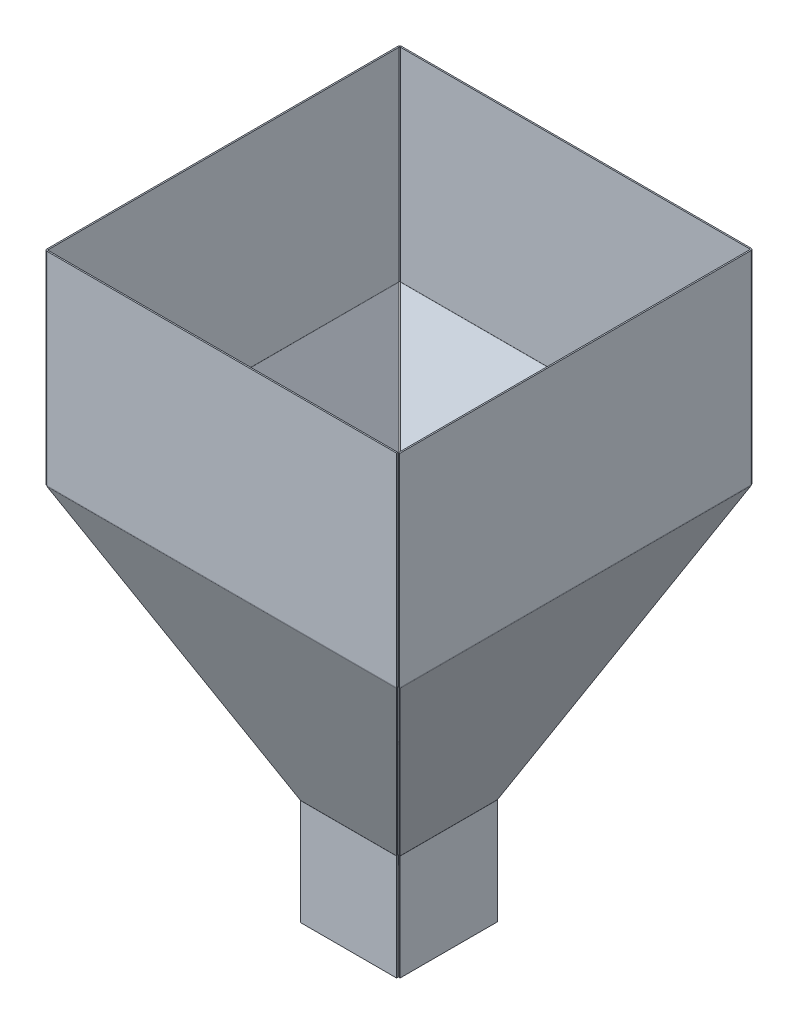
ISO-10303-21;
HEADER;
FILE_DESCRIPTION(('STEP AP214'),'2;1');
FILE_NAME('part.step','',(''),(''),'','','');
FILE_SCHEMA(('AUTOMOTIVE_DESIGN { 1 0 10303 214 1 1 1 1 }'));
ENDSEC;
DATA;
#1=APPLICATION_CONTEXT('core data for automotive mechanical design processes');
#2=APPLICATION_PROTOCOL_DEFINITION('international standard','automotive_design',2000,#1);
#3=PRODUCT_CONTEXT('',#1,'mechanical');
#4=PRODUCT('Part','Part','',(#3));
#5=PRODUCT_RELATED_PRODUCT_CATEGORY('part','',(#4));
#6=PRODUCT_DEFINITION_FORMATION('','',#4);
#7=PRODUCT_DEFINITION_CONTEXT('part definition',#1,'design');
#8=PRODUCT_DEFINITION('design','',#6,#7);
#9=PRODUCT_DEFINITION_SHAPE('','',#8);
#10=(LENGTH_UNIT() NAMED_UNIT(*) SI_UNIT(.MILLI.,.METRE.));
#11=(NAMED_UNIT(*) PLANE_ANGLE_UNIT() SI_UNIT($,.RADIAN.));
#12=(NAMED_UNIT(*) SI_UNIT($,.STERADIAN.) SOLID_ANGLE_UNIT());
#13=UNCERTAINTY_MEASURE_WITH_UNIT(LENGTH_MEASURE(1.E-05),#10,'distance_accuracy_value','');
#14=(GEOMETRIC_REPRESENTATION_CONTEXT(3) GLOBAL_UNCERTAINTY_ASSIGNED_CONTEXT((#13)) GLOBAL_UNIT_ASSIGNED_CONTEXT((#10,
#11,#12)) REPRESENTATION_CONTEXT('',''));
#15=CARTESIAN_POINT('',(0.,0.,0.));
#16=DIRECTION('',(0.,0.,1.));
#17=DIRECTION('',(1.,0.,0.));
#18=AXIS2_PLACEMENT_3D('',#15,#16,#17);
#19=CARTESIAN_POINT('',(0.,-0.633927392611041,-1.35946168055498));
#20=DIRECTION('',(0.,0.422618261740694,0.906307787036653));
#21=DIRECTION('',(0.,-0.906307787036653,0.422618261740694));
#22=AXIS2_PLACEMENT_3D('',#19,#20,#21);
#23=PLANE('',#22);
#24=DIRECTION('',(1.,0.,0.));
#25=VECTOR('',#24,1.);
#26=CARTESIAN_POINT('',(-254.993222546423,-307.596535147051,141.779553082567));
#27=LINE('',#26,#25);
#28=CARTESIAN_POINT('',(-254.653878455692,-307.596535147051,141.779553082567));
#29=VERTEX_POINT('',#28);
#30=CARTESIAN_POINT('',(-254.243222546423,-307.596535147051,141.779553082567));
#31=VERTEX_POINT('',#30);
#32=EDGE_CURVE('E745',#29,#31,#27,.T.);
#33=ORIENTED_EDGE('',*,*,#32,.F.);
#34=DIRECTION('',(-0.389281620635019,0.834817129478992,-0.389281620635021));
#35=VECTOR('',#34,1.);
#36=CARTESIAN_POINT('',(-337.511286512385,-129.908250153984,58.9221450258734));
#37=LINE('',#36,#35);
#38=CARTESIAN_POINT('',(-397.5,-1.2620389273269,-1.06656846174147));
#39=VERTEX_POINT('',#38);
#40=EDGE_CURVE('E898',#29,#39,#37,.T.);
#41=ORIENTED_EDGE('',*,*,#40,.T.);
#42=DIRECTION('',(0.,0.906307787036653,-0.422618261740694));
#43=VECTOR('',#42,1.);
#44=CARTESIAN_POINT('',(-397.5,-0.633927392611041,-1.35946168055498));
#45=LINE('',#44,#43);
#46=CARTESIAN_POINT('',(-397.5,-0.834850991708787,-1.26576946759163));
#47=VERTEX_POINT('',#46);
#48=EDGE_CURVE('E913',#39,#47,#45,.T.);
#49=ORIENTED_EDGE('',*,*,#48,.T.);
#50=DIRECTION('',(-1.,0.,0.));
#51=VECTOR('',#50,1.);
#52=CARTESIAN_POINT('',(0.,-0.834850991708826,-1.26576946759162));
#53=LINE('',#52,#51);
#54=CARTESIAN_POINT('',(-2.5,-0.834850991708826,-1.26576946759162));
#55=VERTEX_POINT('',#54);
#56=EDGE_CURVE('E908',#55,#47,#53,.T.);
#57=ORIENTED_EDGE('',*,*,#56,.F.);
#58=DIRECTION('',(0.,-0.906307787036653,0.422618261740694));
#59=VECTOR('',#58,1.);
#60=CARTESIAN_POINT('',(-2.49999999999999,-308.477189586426,142.190208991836));
#61=LINE('',#60,#59);
#62=CARTESIAN_POINT('',(-2.5,-1.26203892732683,-1.06656846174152));
#63=VERTEX_POINT('',#62);
#64=EDGE_CURVE('E916',#55,#63,#61,.T.);
#65=ORIENTED_EDGE('',*,*,#64,.T.);
#66=DIRECTION('',(-0.38928162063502,-0.834817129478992,0.389281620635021));
#67=VECTOR('',#66,1.);
#68=CARTESIAN_POINT('',(-1.87264142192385,0.0833358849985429,-1.69392703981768));
#69=LINE('',#68,#67);
#70=CARTESIAN_POINT('',(-145.346121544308,-307.596535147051,141.779553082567));
#71=VERTEX_POINT('',#70);
#72=EDGE_CURVE('E892',#63,#71,#69,.T.);
#73=ORIENTED_EDGE('',*,*,#72,.T.);
#74=DIRECTION('',(1.,0.,0.));
#75=VECTOR('',#74,1.);
#76=CARTESIAN_POINT('',(-145.756777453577,-307.596535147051,141.779553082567));
#77=LINE('',#76,#75);
#78=CARTESIAN_POINT('',(-145.756777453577,-307.596535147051,141.779553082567));
#79=VERTEX_POINT('',#78);
#80=EDGE_CURVE('E105',#79,#71,#77,.T.);
#81=ORIENTED_EDGE('',*,*,#80,.F.);
#82=DIRECTION('',(0.,0.906307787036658,-0.422618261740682));
#83=VECTOR('',#82,1.);
#84=CARTESIAN_POINT('',(-145.756777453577,-308.276265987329,142.096516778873));
#85=LINE('',#84,#83);
#86=CARTESIAN_POINT('',(-145.756777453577,-308.276265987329,142.096516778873));
#87=VERTEX_POINT('',#86);
#88=EDGE_CURVE('E750',#87,#79,#85,.T.);
#89=ORIENTED_EDGE('',*,*,#88,.F.);
#90=DIRECTION('',(-1.,0.,0.));
#91=VECTOR('',#90,1.);
#92=CARTESIAN_POINT('',(-254.243222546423,-308.276265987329,142.096516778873));
#93=LINE('',#92,#91);
#94=CARTESIAN_POINT('',(-254.243222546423,-308.276265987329,142.096516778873));
#95=VERTEX_POINT('',#94);
#96=EDGE_CURVE('E577',#95,#87,#93,.F.);
#97=ORIENTED_EDGE('',*,*,#96,.F.);
#98=DIRECTION('',(0.,-0.906307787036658,0.422618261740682));
#99=VECTOR('',#98,1.);
#100=CARTESIAN_POINT('',(-254.243222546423,-307.596535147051,141.779553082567));
#101=LINE('',#100,#99);
#102=EDGE_CURVE('E98',#31,#95,#101,.T.);
#103=ORIENTED_EDGE('',*,*,#102,.F.);
#104=EDGE_LOOP('',(#33,#41,#49,#57,#65,#73,#81,#89,#97,#103));
#105=FACE_BOUND('',#104,.T.);
#106=ADVANCED_FACE('F83',(#105),#23,.F.);
#107=CARTESIAN_POINT('',(0.,0.,0.));
#108=DIRECTION('',(0.,0.422618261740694,0.906307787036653));
#109=DIRECTION('',(0.,-0.906307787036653,0.422618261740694));
#110=AXIS2_PLACEMENT_3D('',#107,#108,#109);
#111=PLANE('',#110);
#112=DIRECTION('',(0.389281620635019,-0.834817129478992,0.389281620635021));
#113=VECTOR('',#112,1.);
#114=CARTESIAN_POINT('',(-397.5,-0.628111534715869,0.292893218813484));
#115=LINE('',#114,#113);
#116=CARTESIAN_POINT('',(-397.5,-0.628111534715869,0.292893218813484));
#117=VERTEX_POINT('',#116);
#118=CARTESIAN_POINT('',(-254.653878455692,-306.96260775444,143.139014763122));
#119=VERTEX_POINT('',#118);
#120=EDGE_CURVE('E895',#117,#119,#115,.T.);
#121=ORIENTED_EDGE('',*,*,#120,.T.);
#122=DIRECTION('',(1.,0.,0.));
#123=VECTOR('',#122,1.);
#124=CARTESIAN_POINT('',(0.,-306.96260775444,143.139014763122));
#125=LINE('',#124,#123);
#126=CARTESIAN_POINT('',(-254.243222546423,-306.96260775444,143.139014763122));
#127=VERTEX_POINT('',#126);
#128=EDGE_CURVE('E760',#119,#127,#125,.T.);
#129=ORIENTED_EDGE('',*,*,#128,.T.);
#130=DIRECTION('',(0.,-0.906307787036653,0.422618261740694));
#131=VECTOR('',#130,1.);
#132=CARTESIAN_POINT('',(-254.243222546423,0.,0.));
#133=LINE('',#132,#131);
#134=CARTESIAN_POINT('',(-254.243222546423,-307.642338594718,143.455978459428));
#135=VERTEX_POINT('',#134);
#136=EDGE_CURVE('E13',#127,#135,#133,.T.);
#137=ORIENTED_EDGE('',*,*,#136,.T.);
#138=DIRECTION('',(-1.,0.,0.));
#139=VECTOR('',#138,1.);
#140=CARTESIAN_POINT('',(-254.243222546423,-307.642338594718,143.455978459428));
#141=LINE('',#140,#139);
#142=CARTESIAN_POINT('',(-145.756777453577,-307.642338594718,143.455978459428));
#143=VERTEX_POINT('',#142);
#144=EDGE_CURVE('E528',#135,#143,#141,.F.);
#145=ORIENTED_EDGE('',*,*,#144,.T.);
#146=DIRECTION('',(0.,0.906307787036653,-0.422618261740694));
#147=VECTOR('',#146,1.);
#148=CARTESIAN_POINT('',(-145.756777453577,0.,0.));
#149=LINE('',#148,#147);
#150=CARTESIAN_POINT('',(-145.756777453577,-306.96260775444,143.139014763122));
#151=VERTEX_POINT('',#150);
#152=EDGE_CURVE('E91',#143,#151,#149,.T.);
#153=ORIENTED_EDGE('',*,*,#152,.T.);
#154=DIRECTION('',(1.,0.,0.));
#155=VECTOR('',#154,1.);
#156=CARTESIAN_POINT('',(0.,-306.96260775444,143.139014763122));
#157=LINE('',#156,#155);
#158=CARTESIAN_POINT('',(-145.346121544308,-306.96260775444,143.139014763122));
#159=VERTEX_POINT('',#158);
#160=EDGE_CURVE('E747',#151,#159,#157,.T.);
#161=ORIENTED_EDGE('',*,*,#160,.T.);
#162=DIRECTION('',(0.389281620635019,0.834817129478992,-0.389281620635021));
#163=VECTOR('',#162,1.);
#164=CARTESIAN_POINT('',(-145.756777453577,-307.843262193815,143.549670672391));
#165=LINE('',#164,#163);
#166=CARTESIAN_POINT('',(-2.5,-0.628111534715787,0.292893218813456));
#167=VERTEX_POINT('',#166);
#168=EDGE_CURVE('E885',#159,#167,#165,.T.);
#169=ORIENTED_EDGE('',*,*,#168,.T.);
#170=DIRECTION('',(0.,-0.906307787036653,0.422618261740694));
#171=VECTOR('',#170,1.);
#172=CARTESIAN_POINT('',(-2.49999999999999,-307.843262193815,143.549670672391));
#173=LINE('',#172,#171);
#174=CARTESIAN_POINT('',(-2.5,-0.200923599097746,0.0936922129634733));
#175=VERTEX_POINT('',#174);
#176=EDGE_CURVE('E917',#175,#167,#173,.T.);
#177=ORIENTED_EDGE('',*,*,#176,.F.);
#178=DIRECTION('',(1.,0.,0.));
#179=VECTOR('',#178,1.);
#180=CARTESIAN_POINT('',(-397.5,-0.200923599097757,0.0936922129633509));
#181=LINE('',#180,#179);
#182=CARTESIAN_POINT('',(-397.5,-0.200923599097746,0.0936922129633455));
#183=VERTEX_POINT('',#182);
#184=EDGE_CURVE('E903',#183,#175,#181,.T.);
#185=ORIENTED_EDGE('',*,*,#184,.F.);
#186=DIRECTION('',(0.,0.906307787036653,-0.422618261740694));
#187=VECTOR('',#186,1.);
#188=CARTESIAN_POINT('',(-397.5,0.,0.));
#189=LINE('',#188,#187);
#190=EDGE_CURVE('E912',#117,#183,#189,.T.);
#191=ORIENTED_EDGE('',*,*,#190,.F.);
#192=EDGE_LOOP('',(#121,#129,#137,#145,#153,#161,#169,#177,#185,#191));
#193=FACE_BOUND('',#192,.T.);
#194=ADVANCED_FACE('F1037',(#193),#111,.T.);
#195=CARTESIAN_POINT('',(-397.5,-0.628111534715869,0.292893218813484));
#196=DIRECTION('',(0.921118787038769,0.352808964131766,-0.164517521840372));
#197=DIRECTION('',(-0.357682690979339,0.933843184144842,0.));
#198=AXIS2_PLACEMENT_3D('',#195,#196,#197);
#199=PLANE('',#198);
#200=DIRECTION('',(0.,-0.422618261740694,-0.906307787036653));
#201=VECTOR('',#200,1.);
#202=CARTESIAN_POINT('',(-254.653878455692,-306.96260775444,143.139014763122));
#203=LINE('',#202,#201);
#204=EDGE_CURVE('E1143',#119,#29,#203,.T.);
#205=ORIENTED_EDGE('',*,*,#204,.F.);
#206=ORIENTED_EDGE('',*,*,#120,.F.);
#207=DIRECTION('',(0.,-0.422618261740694,-0.906307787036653));
#208=VECTOR('',#207,1.);
#209=CARTESIAN_POINT('',(-397.5,-0.628111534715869,0.292893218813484));
#210=LINE('',#209,#208);
#211=EDGE_CURVE('E894',#117,#39,#210,.T.);
#212=ORIENTED_EDGE('',*,*,#211,.T.);
#213=ORIENTED_EDGE('',*,*,#40,.F.);
#214=EDGE_LOOP('',(#205,#206,#212,#213));
#215=FACE_BOUND('',#214,.T.);
#216=ADVANCED_FACE('F1042',(#215),#199,.F.);
#217=CARTESIAN_POINT('',(-145.756777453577,-307.843262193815,143.549670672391));
#218=DIRECTION('',(-0.921118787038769,0.352808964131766,-0.164517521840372));
#219=DIRECTION('',(-0.35768269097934,-0.933843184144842,0.));
#220=AXIS2_PLACEMENT_3D('',#217,#218,#219);
#221=PLANE('',#220);
#222=DIRECTION('',(0.,0.422618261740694,0.906307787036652));
#223=VECTOR('',#222,1.);
#224=CARTESIAN_POINT('',(-145.346121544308,-306.96260775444,143.139014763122));
#225=LINE('',#224,#223);
#226=EDGE_CURVE('E1140',#71,#159,#225,.T.);
#227=ORIENTED_EDGE('',*,*,#226,.F.);
#228=ORIENTED_EDGE('',*,*,#72,.F.);
#229=DIRECTION('',(0.,-0.422618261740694,-0.906307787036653));
#230=VECTOR('',#229,1.);
#231=CARTESIAN_POINT('',(-2.5,-0.628111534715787,0.292893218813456));
#232=LINE('',#231,#230);
#233=EDGE_CURVE('E889',#167,#63,#232,.T.);
#234=ORIENTED_EDGE('',*,*,#233,.F.);
#235=ORIENTED_EDGE('',*,*,#168,.F.);
#236=EDGE_LOOP('',(#227,#228,#234,#235));
#237=FACE_BOUND('',#236,.T.);
#238=ADVANCED_FACE('F1173',(#237),#221,.F.);
#239=CARTESIAN_POINT('',(-328.6848929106,-153.268282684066,-1.15042098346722E-12));
#240=DIRECTION('',(0.906307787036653,0.422618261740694,0.));
#241=DIRECTION('',(-0.422618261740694,0.906307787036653,0.));
#242=AXIS2_PLACEMENT_3D('',#239,#240,#241);
#243=PLANE('',#242);
#244=DIRECTION('',(0.,0.,-1.));
#245=VECTOR('',#244,1.);
#246=CARTESIAN_POINT('',(-256.720446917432,-307.596535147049,254.993222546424));
#247=LINE('',#246,#245);
#248=CARTESIAN_POINT('',(-256.720446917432,-307.596535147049,254.653878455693));
#249=VERTEX_POINT('',#248);
#250=CARTESIAN_POINT('',(-256.720446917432,-307.596535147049,254.243222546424));
#251=VERTEX_POINT('',#250);
#252=EDGE_CURVE('E763',#249,#251,#247,.T.);
#253=ORIENTED_EDGE('',*,*,#252,.F.);
#254=DIRECTION('',(0.389281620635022,-0.834817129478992,-0.389281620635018));
#255=VECTOR('',#254,1.);
#256=CARTESIAN_POINT('',(-279.189093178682,-259.412367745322,277.122524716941));
#257=LINE('',#256,#255);
#258=CARTESIAN_POINT('',(-399.566568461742,-1.26203892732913,397.499999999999));
#259=VERTEX_POINT('',#258);
#260=EDGE_CURVE('E833',#259,#249,#257,.T.);
#261=ORIENTED_EDGE('',*,*,#260,.F.);
#262=DIRECTION('',(-0.422618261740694,0.906307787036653,0.));
#263=VECTOR('',#262,1.);
#264=CARTESIAN_POINT('',(-399.859461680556,-0.633927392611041,397.5));
#265=LINE('',#264,#263);
#266=CARTESIAN_POINT('',(-399.765769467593,-0.83485099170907,397.5));
#267=VERTEX_POINT('',#266);
#268=EDGE_CURVE('E858',#259,#267,#265,.T.);
#269=ORIENTED_EDGE('',*,*,#268,.T.);
#270=DIRECTION('',(0.,0.,1.));
#271=VECTOR('',#270,1.);
#272=CARTESIAN_POINT('',(-399.765769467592,-0.834850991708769,-1.39920921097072E-12));
#273=LINE('',#272,#271);
#274=CARTESIAN_POINT('',(-399.765769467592,-0.834850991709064,1.00000000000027));
#275=VERTEX_POINT('',#274);
#276=EDGE_CURVE('E850',#275,#267,#273,.T.);
#277=ORIENTED_EDGE('',*,*,#276,.F.);
#278=DIRECTION('',(0.422618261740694,-0.906307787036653,0.));
#279=VECTOR('',#278,1.);
#280=CARTESIAN_POINT('',(-256.309791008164,-308.477189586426,1.00000000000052));
#281=LINE('',#280,#279);
#282=CARTESIAN_POINT('',(-399.56656846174,-1.26203892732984,1.));
#283=VERTEX_POINT('',#282);
#284=EDGE_CURVE('E855',#275,#283,#281,.T.);
#285=ORIENTED_EDGE('',*,*,#284,.T.);
#286=DIRECTION('',(-0.38928162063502,0.834817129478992,-0.38928162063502));
#287=VECTOR('',#286,1.);
#288=CARTESIAN_POINT('',(-339.577854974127,-129.908250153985,60.9887134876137));
#289=LINE('',#288,#287);
#290=CARTESIAN_POINT('',(-256.720446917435,-307.596535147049,143.846121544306));
#291=VERTEX_POINT('',#290);
#292=EDGE_CURVE('E840',#291,#283,#289,.T.);
#293=ORIENTED_EDGE('',*,*,#292,.F.);
#294=DIRECTION('',(0.,0.,-1.));
#295=VECTOR('',#294,1.);
#296=CARTESIAN_POINT('',(-256.720446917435,-307.596535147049,144.256777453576));
#297=LINE('',#296,#295);
#298=CARTESIAN_POINT('',(-256.720446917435,-307.596535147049,144.256777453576));
#299=VERTEX_POINT('',#298);
#300=EDGE_CURVE('E773',#299,#291,#297,.T.);
#301=ORIENTED_EDGE('',*,*,#300,.F.);
#302=DIRECTION('',(-0.422618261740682,0.906307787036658,0.));
#303=VECTOR('',#302,1.);
#304=CARTESIAN_POINT('',(-256.403483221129,-308.276265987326,144.256777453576));
#305=LINE('',#304,#303);
#306=CARTESIAN_POINT('',(-256.403483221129,-308.276265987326,144.256777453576));
#307=VERTEX_POINT('',#306);
#308=EDGE_CURVE('E770',#307,#299,#305,.T.);
#309=ORIENTED_EDGE('',*,*,#308,.F.);
#310=DIRECTION('',(0.,0.,1.));
#311=VECTOR('',#310,1.);
#312=CARTESIAN_POINT('',(-256.403483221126,-308.276265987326,254.243222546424));
#313=LINE('',#312,#311);
#314=CARTESIAN_POINT('',(-256.403483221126,-308.276265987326,254.243222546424));
#315=VERTEX_POINT('',#314);
#316=EDGE_CURVE('E629',#315,#307,#313,.F.);
#317=ORIENTED_EDGE('',*,*,#316,.F.);
#318=DIRECTION('',(0.422618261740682,-0.906307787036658,0.));
#319=VECTOR('',#318,1.);
#320=CARTESIAN_POINT('',(-256.720446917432,-307.596535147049,254.243222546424));
#321=LINE('',#320,#319);
#322=EDGE_CURVE('E766',#251,#315,#321,.T.);
#323=ORIENTED_EDGE('',*,*,#322,.F.);
#324=EDGE_LOOP('',(#253,#261,#269,#277,#285,#293,#301,#309,#317,#323));
#325=FACE_BOUND('',#324,.T.);
#326=ADVANCED_FACE('F1521',(#325),#243,.F.);
#327=CARTESIAN_POINT('',(-327.325431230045,-152.634355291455,-1.14566276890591E-12));
#328=DIRECTION('',(0.906307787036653,0.422618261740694,0.));
#329=DIRECTION('',(-0.422618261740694,0.906307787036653,0.));
#330=AXIS2_PLACEMENT_3D('',#327,#328,#329);
#331=PLANE('',#330);
#332=DIRECTION('',(-0.389281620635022,0.834817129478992,0.389281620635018));
#333=VECTOR('',#332,1.);
#334=CARTESIAN_POINT('',(-254.95032932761,-307.843262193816,254.243222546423));
#335=LINE('',#334,#333);
#336=CARTESIAN_POINT('',(-255.360985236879,-306.962607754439,254.653878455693));
#337=VERTEX_POINT('',#336);
#338=CARTESIAN_POINT('',(-398.207106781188,-0.628111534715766,397.5));
#339=VERTEX_POINT('',#338);
#340=EDGE_CURVE('E828',#337,#339,#335,.T.);
#341=ORIENTED_EDGE('',*,*,#340,.F.);
#342=DIRECTION('',(0.,0.,-1.));
#343=VECTOR('',#342,1.);
#344=CARTESIAN_POINT('',(-255.360985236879,-306.962607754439,-1.14566276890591E-12));
#345=LINE('',#344,#343);
#346=CARTESIAN_POINT('',(-255.360985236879,-306.962607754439,254.243222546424));
#347=VERTEX_POINT('',#346);
#348=EDGE_CURVE('E765',#337,#347,#345,.T.);
#349=ORIENTED_EDGE('',*,*,#348,.T.);
#350=DIRECTION('',(0.422618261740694,-0.906307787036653,0.));
#351=VECTOR('',#350,1.);
#352=CARTESIAN_POINT('',(-327.325431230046,-152.634355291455,254.243222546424));
#353=LINE('',#352,#351);
#354=CARTESIAN_POINT('',(-255.044021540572,-307.642338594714,254.243222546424));
#355=VERTEX_POINT('',#354);
#356=EDGE_CURVE('E1137',#347,#355,#353,.T.);
#357=ORIENTED_EDGE('',*,*,#356,.T.);
#358=DIRECTION('',(0.,0.,1.));
#359=VECTOR('',#358,1.);
#360=CARTESIAN_POINT('',(-255.044021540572,-307.642338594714,254.243222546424));
#361=LINE('',#360,#359);
#362=CARTESIAN_POINT('',(-255.044021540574,-307.642338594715,144.256777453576));
#363=VERTEX_POINT('',#362);
#364=EDGE_CURVE('E616',#355,#363,#361,.F.);
#365=ORIENTED_EDGE('',*,*,#364,.T.);
#366=DIRECTION('',(-0.422618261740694,0.906307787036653,0.));
#367=VECTOR('',#366,1.);
#368=CARTESIAN_POINT('',(-327.325431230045,-152.634355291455,144.256777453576));
#369=LINE('',#368,#367);
#370=CARTESIAN_POINT('',(-255.36098523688,-306.962607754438,144.256777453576));
#371=VERTEX_POINT('',#370);
#372=EDGE_CURVE('E1134',#363,#371,#369,.T.);
#373=ORIENTED_EDGE('',*,*,#372,.T.);
#374=DIRECTION('',(0.,0.,-1.));
#375=VECTOR('',#374,1.);
#376=CARTESIAN_POINT('',(-255.360985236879,-306.962607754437,-1.14566276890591E-12));
#377=LINE('',#376,#375);
#378=CARTESIAN_POINT('',(-255.36098523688,-306.962607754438,143.846121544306));
#379=VERTEX_POINT('',#378);
#380=EDGE_CURVE('E781',#371,#379,#377,.T.);
#381=ORIENTED_EDGE('',*,*,#380,.T.);
#382=DIRECTION('',(0.389281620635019,-0.834817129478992,0.38928162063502));
#383=VECTOR('',#382,1.);
#384=CARTESIAN_POINT('',(-398.207106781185,-0.62811153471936,1.00000000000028));
#385=LINE('',#384,#383);
#386=CARTESIAN_POINT('',(-398.207106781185,-0.628111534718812,1.00000000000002));
#387=VERTEX_POINT('',#386);
#388=EDGE_CURVE('E837',#387,#379,#385,.T.);
#389=ORIENTED_EDGE('',*,*,#388,.F.);
#390=DIRECTION('',(0.422618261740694,-0.906307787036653,0.));
#391=VECTOR('',#390,1.);
#392=CARTESIAN_POINT('',(-254.950329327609,-307.843262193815,1.00000000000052));
#393=LINE('',#392,#391);
#394=CARTESIAN_POINT('',(-398.406307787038,-0.20092359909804,1.00000000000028));
#395=VERTEX_POINT('',#394);
#396=EDGE_CURVE('E854',#395,#387,#393,.T.);
#397=ORIENTED_EDGE('',*,*,#396,.F.);
#398=DIRECTION('',(0.,0.,-1.));
#399=VECTOR('',#398,1.);
#400=CARTESIAN_POINT('',(-398.406307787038,-0.200923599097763,397.5));
#401=LINE('',#400,#399);
#402=CARTESIAN_POINT('',(-398.406307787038,-0.20092359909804,397.5));
#403=VERTEX_POINT('',#402);
#404=EDGE_CURVE('E845',#403,#395,#401,.T.);
#405=ORIENTED_EDGE('',*,*,#404,.F.);
#406=DIRECTION('',(-0.422618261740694,0.906307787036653,0.));
#407=VECTOR('',#406,1.);
#408=CARTESIAN_POINT('',(-398.500000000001,0.,397.5));
#409=LINE('',#408,#407);
#410=EDGE_CURVE('E859',#339,#403,#409,.T.);
#411=ORIENTED_EDGE('',*,*,#410,.F.);
#412=EDGE_LOOP('',(#341,#349,#357,#365,#373,#381,#389,#397,#405,#411));
#413=FACE_BOUND('',#412,.T.);
#414=ADVANCED_FACE('F1519',(#413),#331,.T.);
#415=CARTESIAN_POINT('',(-398.207106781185,-0.62811153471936,1.00000000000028));
#416=DIRECTION('',(0.164517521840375,-0.352808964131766,-0.921118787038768));
#417=DIRECTION('',(0.,0.933843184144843,-0.357682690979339));
#418=AXIS2_PLACEMENT_3D('',#415,#416,#417);
#419=PLANE('',#418);
#420=ORIENTED_EDGE('',*,*,#388,.T.);
#421=DIRECTION('',(-0.906307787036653,-0.422618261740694,0.));
#422=VECTOR('',#421,1.);
#423=CARTESIAN_POINT('',(-255.36098523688,-306.962607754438,143.846121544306));
#424=LINE('',#423,#422);
#425=EDGE_CURVE('E1131',#379,#291,#424,.T.);
#426=ORIENTED_EDGE('',*,*,#425,.T.);
#427=ORIENTED_EDGE('',*,*,#292,.T.);
#428=DIRECTION('',(-0.906307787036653,-0.422618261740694,0.));
#429=VECTOR('',#428,1.);
#430=CARTESIAN_POINT('',(-398.207106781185,-0.62811153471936,1.00000000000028));
#431=LINE('',#430,#429);
#432=EDGE_CURVE('E836',#387,#283,#431,.T.);
#433=ORIENTED_EDGE('',*,*,#432,.F.);
#434=EDGE_LOOP('',(#420,#426,#427,#433));
#435=FACE_BOUND('',#434,.T.);
#436=ADVANCED_FACE('F1515',(#435),#419,.T.);
#437=CARTESIAN_POINT('',(-254.95032932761,-307.843262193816,254.243222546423));
#438=DIRECTION('',(0.164517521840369,-0.352808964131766,0.921118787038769));
#439=DIRECTION('',(0.,-0.933843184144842,-0.35768269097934));
#440=AXIS2_PLACEMENT_3D('',#437,#438,#439);
#441=PLANE('',#440);
#442=ORIENTED_EDGE('',*,*,#260,.T.);
#443=DIRECTION('',(0.906307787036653,0.422618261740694,0.));
#444=VECTOR('',#443,1.);
#445=CARTESIAN_POINT('',(-255.360985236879,-306.962607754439,254.653878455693));
#446=LINE('',#445,#444);
#447=EDGE_CURVE('E1128',#249,#337,#446,.T.);
#448=ORIENTED_EDGE('',*,*,#447,.T.);
#449=ORIENTED_EDGE('',*,*,#340,.T.);
#450=DIRECTION('',(-0.906307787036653,-0.422618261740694,0.));
#451=VECTOR('',#450,1.);
#452=CARTESIAN_POINT('',(-398.207106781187,-0.62811153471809,397.499999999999));
#453=LINE('',#452,#451);
#454=EDGE_CURVE('E830',#339,#259,#453,.T.);
#455=ORIENTED_EDGE('',*,*,#454,.T.);
#456=EDGE_LOOP('',(#442,#448,#449,#455));
#457=FACE_BOUND('',#456,.T.);
#458=ADVANCED_FACE('F1381',(#457),#441,.T.);
#459=CARTESIAN_POINT('',(-2.30665951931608E-12,-153.268282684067,328.684892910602));
#460=DIRECTION('',(0.,0.422618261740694,-0.906307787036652));
#461=DIRECTION('',(0.,0.906307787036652,0.422618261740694));
#462=AXIS2_PLACEMENT_3D('',#459,#460,#461);
#463=PLANE('',#462);
#464=DIRECTION('',(-1.,0.,0.));
#465=VECTOR('',#464,1.);
#466=CARTESIAN_POINT('',(-145.006777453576,-307.596535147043,256.720446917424));
#467=LINE('',#466,#465);
#468=CARTESIAN_POINT('',(-145.346121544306,-307.596535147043,256.720446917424));
#469=VERTEX_POINT('',#468);
#470=CARTESIAN_POINT('',(-145.756777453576,-307.596535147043,256.720446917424));
#471=VERTEX_POINT('',#470);
#472=EDGE_CURVE('E785',#469,#471,#467,.T.);
#473=ORIENTED_EDGE('',*,*,#472,.F.);
#474=DIRECTION('',(-0.389281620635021,-0.834817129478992,-0.38928162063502));
#475=VECTOR('',#474,1.);
#476=CARTESIAN_POINT('',(-2.30079899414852,-0.83485099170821,399.765769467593));
#477=LINE('',#476,#475);
#478=CARTESIAN_POINT('',(-2.30079899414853,-0.834850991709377,399.765769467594));
#479=VERTEX_POINT('',#478);
#480=EDGE_CURVE('E992',#479,#469,#477,.T.);
#481=ORIENTED_EDGE('',*,*,#480,.F.);
#482=DIRECTION('',(1.,0.,0.));
#483=VECTOR('',#482,1.);
#484=CARTESIAN_POINT('',(-2.81547076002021E-12,-0.834850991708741,399.765769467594));
#485=LINE('',#484,#483);
#486=CARTESIAN_POINT('',(-397.500000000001,-0.834850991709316,399.765769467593));
#487=VERTEX_POINT('',#486);
#488=EDGE_CURVE('E1413',#487,#479,#485,.T.);
#489=ORIENTED_EDGE('',*,*,#488,.F.);
#490=DIRECTION('',(0.,-0.906307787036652,-0.422618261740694));
#491=VECTOR('',#490,1.);
#492=CARTESIAN_POINT('',(-397.5,-308.477189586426,256.309791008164));
#493=LINE('',#492,#491);
#494=CARTESIAN_POINT('',(-397.500000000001,-1.26203892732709,399.566568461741));
#495=VERTEX_POINT('',#494);
#496=EDGE_CURVE('E1416',#487,#495,#493,.T.);
#497=ORIENTED_EDGE('',*,*,#496,.T.);
#498=DIRECTION('',(0.389281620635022,-0.834817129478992,-0.389281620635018));
#499=VECTOR('',#498,1.);
#500=CARTESIAN_POINT('',(-277.122524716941,-259.412367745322,279.189093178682));
#501=LINE('',#500,#499);
#502=CARTESIAN_POINT('',(-254.653878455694,-307.596535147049,256.720446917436));
#503=VERTEX_POINT('',#502);
#504=EDGE_CURVE('E1405',#495,#503,#501,.T.);
#505=ORIENTED_EDGE('',*,*,#504,.T.);
#506=DIRECTION('',(-1.,0.,0.));
#507=VECTOR('',#506,1.);
#508=CARTESIAN_POINT('',(-254.243222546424,-307.596535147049,256.720446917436));
#509=LINE('',#508,#507);
#510=CARTESIAN_POINT('',(-254.243222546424,-307.596535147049,256.720446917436));
#511=VERTEX_POINT('',#510);
#512=EDGE_CURVE('E795',#511,#503,#509,.T.);
#513=ORIENTED_EDGE('',*,*,#512,.F.);
#514=DIRECTION('',(0.,0.906307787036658,0.422618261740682));
#515=VECTOR('',#514,1.);
#516=CARTESIAN_POINT('',(-254.243222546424,-308.276265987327,256.403483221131));
#517=LINE('',#516,#515);
#518=CARTESIAN_POINT('',(-254.243222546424,-308.276265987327,256.403483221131));
#519=VERTEX_POINT('',#518);
#520=EDGE_CURVE('E792',#519,#511,#517,.T.);
#521=ORIENTED_EDGE('',*,*,#520,.F.);
#522=DIRECTION('',(1.,0.,-1.11022302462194E-13));
#523=VECTOR('',#522,1.);
#524=CARTESIAN_POINT('',(-145.756777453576,-308.276265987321,256.403483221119));
#525=LINE('',#524,#523);
#526=CARTESIAN_POINT('',(-145.756777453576,-308.276265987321,256.403483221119));
#527=VERTEX_POINT('',#526);
#528=EDGE_CURVE('E682',#527,#519,#525,.F.);
#529=ORIENTED_EDGE('',*,*,#528,.F.);
#530=DIRECTION('',(0.,-0.906307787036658,-0.422618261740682));
#531=VECTOR('',#530,1.);
#532=CARTESIAN_POINT('',(-145.756777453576,-307.596535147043,256.720446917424));
#533=LINE('',#532,#531);
#534=EDGE_CURVE('E788',#471,#527,#533,.T.);
#535=ORIENTED_EDGE('',*,*,#534,.F.);
#536=EDGE_LOOP('',(#473,#481,#489,#497,#505,#513,#521,#529,#535));
#537=FACE_BOUND('',#536,.T.);
#538=ADVANCED_FACE('F1377',(#537),#463,.F.);
#539=CARTESIAN_POINT('',(-2.29711902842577E-12,-152.634355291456,327.325431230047));
#540=DIRECTION('',(0.,0.422618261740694,-0.906307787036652));
#541=DIRECTION('',(0.,0.906307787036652,0.422618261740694));
#542=AXIS2_PLACEMENT_3D('',#539,#540,#541);
#543=PLANE('',#542);
#544=DIRECTION('',(-0.389281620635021,-0.834817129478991,-0.389281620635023));
#545=VECTOR('',#544,1.);
#546=CARTESIAN_POINT('',(-62.2614032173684,-128.786854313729,338.445703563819));
#547=LINE('',#546,#545);
#548=CARTESIAN_POINT('',(-2.30079899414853,-0.20092359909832,398.406307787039));
#549=VERTEX_POINT('',#548);
#550=CARTESIAN_POINT('',(-145.346121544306,-306.962607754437,255.360985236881));
#551=VERTEX_POINT('',#550);
#552=EDGE_CURVE('E1397',#549,#551,#547,.T.);
#553=ORIENTED_EDGE('',*,*,#552,.T.);
#554=DIRECTION('',(-1.,0.,0.));
#555=VECTOR('',#554,1.);
#556=CARTESIAN_POINT('',(-2.29711902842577E-12,-306.962607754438,255.360985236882));
#557=LINE('',#556,#555);
#558=CARTESIAN_POINT('',(-145.756777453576,-306.962607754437,255.360985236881));
#559=VERTEX_POINT('',#558);
#560=EDGE_CURVE('E787',#551,#559,#557,.T.);
#561=ORIENTED_EDGE('',*,*,#560,.T.);
#562=DIRECTION('',(0.,-0.906307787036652,-0.422618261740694));
#563=VECTOR('',#562,1.);
#564=CARTESIAN_POINT('',(-145.756777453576,-152.634355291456,327.325431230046));
#565=LINE('',#564,#563);
#566=CARTESIAN_POINT('',(-145.756777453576,-307.64233859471,255.044021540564));
#567=VERTEX_POINT('',#566);
#568=EDGE_CURVE('E1125',#559,#567,#565,.T.);
#569=ORIENTED_EDGE('',*,*,#568,.T.);
#570=DIRECTION('',(1.,0.,-1.11022302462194E-13));
#571=VECTOR('',#570,1.);
#572=CARTESIAN_POINT('',(-145.756777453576,-307.64233859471,255.044021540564));
#573=LINE('',#572,#571);
#574=CARTESIAN_POINT('',(-254.243222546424,-307.642338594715,255.044021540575));
#575=VERTEX_POINT('',#574);
#576=EDGE_CURVE('E669',#567,#575,#573,.F.);
#577=ORIENTED_EDGE('',*,*,#576,.T.);
#578=DIRECTION('',(0.,0.906307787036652,0.422618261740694));
#579=VECTOR('',#578,1.);
#580=CARTESIAN_POINT('',(-254.243222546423,-152.634355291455,327.325431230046));
#581=LINE('',#580,#579);
#582=CARTESIAN_POINT('',(-254.243222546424,-306.962607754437,255.36098523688));
#583=VERTEX_POINT('',#582);
#584=EDGE_CURVE('E1122',#575,#583,#581,.T.);
#585=ORIENTED_EDGE('',*,*,#584,.T.);
#586=DIRECTION('',(-1.,0.,0.));
#587=VECTOR('',#586,1.);
#588=CARTESIAN_POINT('',(-2.29711902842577E-12,-306.962607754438,255.360985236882));
#589=LINE('',#588,#587);
#590=CARTESIAN_POINT('',(-254.653878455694,-306.962607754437,255.36098523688));
#591=VERTEX_POINT('',#590);
#592=EDGE_CURVE('E803',#583,#591,#589,.T.);
#593=ORIENTED_EDGE('',*,*,#592,.T.);
#594=DIRECTION('',(-0.389281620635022,0.834817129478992,0.389281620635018));
#595=VECTOR('',#594,1.);
#596=CARTESIAN_POINT('',(-254.243222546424,-307.843262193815,254.95032932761));
#597=LINE('',#596,#595);
#598=CARTESIAN_POINT('',(-397.500000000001,-0.628111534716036,398.207106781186));
#599=VERTEX_POINT('',#598);
#600=EDGE_CURVE('E1398',#591,#599,#597,.T.);
#601=ORIENTED_EDGE('',*,*,#600,.T.);
#602=DIRECTION('',(0.,-0.906307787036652,-0.422618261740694));
#603=VECTOR('',#602,1.);
#604=CARTESIAN_POINT('',(-397.5,-307.843262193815,254.950329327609));
#605=LINE('',#604,#603);
#606=CARTESIAN_POINT('',(-397.500000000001,-0.200923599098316,398.406307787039));
#607=VERTEX_POINT('',#606);
#608=EDGE_CURVE('E1415',#607,#599,#605,.T.);
#609=ORIENTED_EDGE('',*,*,#608,.F.);
#610=DIRECTION('',(-1.,0.,0.));
#611=VECTOR('',#610,1.);
#612=CARTESIAN_POINT('',(-2.00000000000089,-0.200923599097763,398.40630778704));
#613=LINE('',#612,#611);
#614=EDGE_CURVE('E1408',#549,#607,#613,.T.);
#615=ORIENTED_EDGE('',*,*,#614,.F.);
#616=EDGE_LOOP('',(#553,#561,#569,#577,#585,#593,#601,#609,#615));
#617=FACE_BOUND('',#616,.T.);
#618=ADVANCED_FACE('F1373',(#617),#543,.T.);
#619=CARTESIAN_POINT('',(-254.243222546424,-307.843262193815,254.95032932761));
#620=DIRECTION('',(0.921118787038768,0.352808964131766,0.164517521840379));
#621=DIRECTION('',(-0.35768269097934,0.933843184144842,0.));
#622=AXIS2_PLACEMENT_3D('',#619,#620,#621);
#623=PLANE('',#622);
#624=DIRECTION('',(0.,0.422618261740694,-0.906307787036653));
#625=VECTOR('',#624,1.);
#626=CARTESIAN_POINT('',(-254.653878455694,-306.962607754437,255.36098523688));
#627=LINE('',#626,#625);
#628=EDGE_CURVE('E1114',#503,#591,#627,.T.);
#629=ORIENTED_EDGE('',*,*,#628,.F.);
#630=ORIENTED_EDGE('',*,*,#504,.F.);
#631=DIRECTION('',(0.,-0.422618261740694,0.906307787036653));
#632=VECTOR('',#631,1.);
#633=CARTESIAN_POINT('',(-397.500000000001,-0.628111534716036,398.207106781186));
#634=LINE('',#633,#632);
#635=EDGE_CURVE('E1402',#599,#495,#634,.T.);
#636=ORIENTED_EDGE('',*,*,#635,.F.);
#637=ORIENTED_EDGE('',*,*,#600,.F.);
#638=EDGE_LOOP('',(#629,#630,#636,#637));
#639=FACE_BOUND('',#638,.T.);
#640=ADVANCED_FACE('F1376',(#639),#623,.F.);
#641=CARTESIAN_POINT('',(-2.30079899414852,-0.83485099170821,399.765769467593));
#642=DIRECTION('',(0.921118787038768,-0.35280896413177,-0.164517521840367));
#643=DIRECTION('',(0.357682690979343,0.933843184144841,0.));
#644=AXIS2_PLACEMENT_3D('',#641,#642,#643);
#645=PLANE('',#644);
#646=ORIENTED_EDGE('',*,*,#480,.T.);
#647=DIRECTION('',(0.,0.422618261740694,-0.906307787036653));
#648=VECTOR('',#647,1.);
#649=CARTESIAN_POINT('',(-145.346121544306,-307.596535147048,256.720446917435));
#650=LINE('',#649,#648);
#651=EDGE_CURVE('E1110',#469,#551,#650,.T.);
#652=ORIENTED_EDGE('',*,*,#651,.T.);
#653=ORIENTED_EDGE('',*,*,#552,.F.);
#654=DIRECTION('',(0.,0.422618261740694,-0.906307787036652));
#655=VECTOR('',#654,1.);
#656=CARTESIAN_POINT('',(-2.30079899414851,-0.200923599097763,398.40630778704));
#657=LINE('',#656,#655);
#658=EDGE_CURVE('E1394',#479,#549,#657,.T.);
#659=ORIENTED_EDGE('',*,*,#658,.F.);
#660=EDGE_LOOP('',(#646,#652,#653,#659));
#661=FACE_BOUND('',#660,.T.);
#662=ADVANCED_FACE('F1085',(#661),#645,.T.);
#663=CARTESIAN_POINT('',(0.127370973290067,-0.0593940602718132,0.));
#664=DIRECTION('',(-0.906307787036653,0.422618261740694,0.));
#665=DIRECTION('',(-0.422618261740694,-0.906307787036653,0.));
#666=AXIS2_PLACEMENT_3D('',#663,#664,#665);
#667=PLANE('',#666);
#668=DIRECTION('',(0.,0.,1.));
#669=VECTOR('',#668,1.);
#670=CARTESIAN_POINT('',(-143.279553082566,-307.596535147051,143.506777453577));
#671=LINE('',#670,#669);
#672=CARTESIAN_POINT('',(-143.279553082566,-307.596535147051,143.846121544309));
#673=VERTEX_POINT('',#672);
#674=CARTESIAN_POINT('',(-143.279553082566,-307.596535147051,144.256777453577));
#675=VERTEX_POINT('',#674);
#676=EDGE_CURVE('E807',#673,#675,#671,.T.);
#677=ORIENTED_EDGE('',*,*,#676,.F.);
#678=DIRECTION('',(-0.389281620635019,-0.834817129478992,0.389281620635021));
#679=VECTOR('',#678,1.);
#680=CARTESIAN_POINT('',(0.193927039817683,0.0833358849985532,0.372641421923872));
#681=LINE('',#680,#679);
#682=CARTESIAN_POINT('',(-0.433431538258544,-1.26203892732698,1.00000000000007));
#683=VERTEX_POINT('',#682);
#684=EDGE_CURVE('E950',#683,#673,#681,.T.);
#685=ORIENTED_EDGE('',*,*,#684,.F.);
#686=DIRECTION('',(0.422618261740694,0.906307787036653,0.));
#687=VECTOR('',#686,1.);
#688=CARTESIAN_POINT('',(-0.140538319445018,-0.633927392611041,0.999999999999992));
#689=LINE('',#688,#687);
#690=CARTESIAN_POINT('',(-0.234230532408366,-0.834850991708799,0.999999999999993));
#691=VERTEX_POINT('',#690);
#692=EDGE_CURVE('E966',#683,#691,#689,.T.);
#693=ORIENTED_EDGE('',*,*,#692,.T.);
#694=DIRECTION('',(0.,0.,-1.));
#695=VECTOR('',#694,1.);
#696=CARTESIAN_POINT('',(-0.234230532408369,-0.834850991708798,0.));
#697=LINE('',#696,#695);
#698=CARTESIAN_POINT('',(-0.23423053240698,-0.834850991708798,397.699201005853));
#699=VERTEX_POINT('',#698);
#700=EDGE_CURVE('E961',#699,#691,#697,.T.);
#701=ORIENTED_EDGE('',*,*,#700,.F.);
#702=DIRECTION('',(0.389281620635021,0.834817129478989,0.389281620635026));
#703=VECTOR('',#702,1.);
#704=CARTESIAN_POINT('',(-203.771578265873,-437.322101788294,194.161853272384));
#705=LINE('',#704,#703);
#706=CARTESIAN_POINT('',(-143.279553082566,-307.596535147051,254.653878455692));
#707=VERTEX_POINT('',#706);
#708=EDGE_CURVE('E953',#707,#699,#705,.T.);
#709=ORIENTED_EDGE('',*,*,#708,.F.);
#710=DIRECTION('',(0.,0.,1.));
#711=VECTOR('',#710,1.);
#712=CARTESIAN_POINT('',(-143.279553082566,-307.596535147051,254.243222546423));
#713=LINE('',#712,#711);
#714=CARTESIAN_POINT('',(-143.279553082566,-307.596535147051,254.243222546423));
#715=VERTEX_POINT('',#714);
#716=EDGE_CURVE('E817',#715,#707,#713,.T.);
#717=ORIENTED_EDGE('',*,*,#716,.F.);
#718=DIRECTION('',(0.422618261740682,0.906307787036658,0.));
#719=VECTOR('',#718,1.);
#720=CARTESIAN_POINT('',(-143.596516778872,-308.276265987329,254.243222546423));
#721=LINE('',#720,#719);
#722=CARTESIAN_POINT('',(-143.596516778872,-308.276265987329,254.243222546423));
#723=VERTEX_POINT('',#722);
#724=EDGE_CURVE('E814',#723,#715,#721,.T.);
#725=ORIENTED_EDGE('',*,*,#724,.F.);
#726=DIRECTION('',(0.,0.,-1.));
#727=VECTOR('',#726,1.);
#728=CARTESIAN_POINT('',(-143.596516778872,-308.276265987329,144.256777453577));
#729=LINE('',#728,#727);
#730=CARTESIAN_POINT('',(-143.596516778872,-308.276265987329,144.256777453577));
#731=VERTEX_POINT('',#730);
#732=EDGE_CURVE('E735',#731,#723,#729,.F.);
#733=ORIENTED_EDGE('',*,*,#732,.F.);
#734=DIRECTION('',(-0.422618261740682,-0.906307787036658,0.));
#735=VECTOR('',#734,1.);
#736=CARTESIAN_POINT('',(-143.279553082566,-307.596535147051,144.256777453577));
#737=LINE('',#736,#735);
#738=EDGE_CURVE('E810',#675,#731,#737,.T.);
#739=ORIENTED_EDGE('',*,*,#738,.F.);
#740=EDGE_LOOP('',(#677,#685,#693,#701,#709,#717,#725,#733,#739));
#741=FACE_BOUND('',#740,.T.);
#742=ADVANCED_FACE('F1083',(#741),#667,.F.);
#743=CARTESIAN_POINT('',(-1.23209070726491,0.574533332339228,0.));
#744=DIRECTION('',(-0.906307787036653,0.422618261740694,0.));
#745=DIRECTION('',(-0.422618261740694,-0.906307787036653,0.));
#746=AXIS2_PLACEMENT_3D('',#743,#744,#745);
#747=PLANE('',#746);
#748=DIRECTION('',(0.389281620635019,0.834817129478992,-0.389281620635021));
#749=VECTOR('',#748,1.);
#750=CARTESIAN_POINT('',(-145.04967067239,-307.843262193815,144.256777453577));
#751=LINE('',#750,#749);
#752=CARTESIAN_POINT('',(-144.639014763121,-306.96260775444,143.846121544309));
#753=VERTEX_POINT('',#752);
#754=CARTESIAN_POINT('',(-1.79289321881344,-0.628111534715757,0.999999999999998));
#755=VERTEX_POINT('',#754);
#756=EDGE_CURVE('E943',#753,#755,#751,.T.);
#757=ORIENTED_EDGE('',*,*,#756,.F.);
#758=DIRECTION('',(0.,0.,1.));
#759=VECTOR('',#758,1.);
#760=CARTESIAN_POINT('',(-144.639014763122,-306.96260775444,0.));
#761=LINE('',#760,#759);
#762=CARTESIAN_POINT('',(-144.639014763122,-306.96260775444,144.256777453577));
#763=VERTEX_POINT('',#762);
#764=EDGE_CURVE('E809',#753,#763,#761,.T.);
#765=ORIENTED_EDGE('',*,*,#764,.T.);
#766=DIRECTION('',(-0.422618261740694,-0.906307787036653,0.));
#767=VECTOR('',#766,1.);
#768=CARTESIAN_POINT('',(-1.2320907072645,0.574533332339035,144.256777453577));
#769=LINE('',#768,#767);
#770=CARTESIAN_POINT('',(-144.955978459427,-307.642338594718,144.256777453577));
#771=VERTEX_POINT('',#770);
#772=EDGE_CURVE('E1109',#763,#771,#769,.T.);
#773=ORIENTED_EDGE('',*,*,#772,.T.);
#774=DIRECTION('',(0.,0.,-1.));
#775=VECTOR('',#774,1.);
#776=CARTESIAN_POINT('',(-144.955978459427,-307.642338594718,144.256777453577));
#777=LINE('',#776,#775);
#778=CARTESIAN_POINT('',(-144.955978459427,-307.642338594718,254.243222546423));
#779=VERTEX_POINT('',#778);
#780=EDGE_CURVE('E722',#771,#779,#777,.F.);
#781=ORIENTED_EDGE('',*,*,#780,.T.);
#782=DIRECTION('',(0.422618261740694,0.906307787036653,0.));
#783=VECTOR('',#782,1.);
#784=CARTESIAN_POINT('',(-1.23209070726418,0.574533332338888,254.243222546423));
#785=LINE('',#784,#783);
#786=CARTESIAN_POINT('',(-144.639014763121,-306.96260775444,254.243222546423));
#787=VERTEX_POINT('',#786);
#788=EDGE_CURVE('E1111',#779,#787,#785,.T.);
#789=ORIENTED_EDGE('',*,*,#788,.T.);
#790=DIRECTION('',(0.,0.,1.));
#791=VECTOR('',#790,1.);
#792=CARTESIAN_POINT('',(-144.639014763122,-306.96260775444,0.));
#793=LINE('',#792,#791);
#794=CARTESIAN_POINT('',(-144.639014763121,-306.96260775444,254.653878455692));
#795=VERTEX_POINT('',#794);
#796=EDGE_CURVE('E825',#787,#795,#793,.T.);
#797=ORIENTED_EDGE('',*,*,#796,.T.);
#798=DIRECTION('',(0.389281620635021,0.834817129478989,0.389281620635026));
#799=VECTOR('',#798,1.);
#800=CARTESIAN_POINT('',(-61.5542964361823,-128.78685431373,337.738596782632));
#801=LINE('',#800,#799);
#802=CARTESIAN_POINT('',(-1.59369221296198,-0.200923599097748,397.699201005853));
#803=VERTEX_POINT('',#802);
#804=EDGE_CURVE('E955',#795,#803,#801,.T.);
#805=ORIENTED_EDGE('',*,*,#804,.T.);
#806=DIRECTION('',(0.,0.,1.));
#807=VECTOR('',#806,1.);
#808=CARTESIAN_POINT('',(-1.59369221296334,-0.200923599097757,1.00000000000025));
#809=LINE('',#808,#807);
#810=CARTESIAN_POINT('',(-1.59369221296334,-0.200923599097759,1.));
#811=VERTEX_POINT('',#810);
#812=EDGE_CURVE('E958',#811,#803,#809,.T.);
#813=ORIENTED_EDGE('',*,*,#812,.F.);
#814=DIRECTION('',(0.422618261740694,0.906307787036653,0.));
#815=VECTOR('',#814,1.);
#816=CARTESIAN_POINT('',(-1.5,0.,0.999999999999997));
#817=LINE('',#816,#815);
#818=EDGE_CURVE('E965',#755,#811,#817,.T.);
#819=ORIENTED_EDGE('',*,*,#818,.F.);
#820=EDGE_LOOP('',(#757,#765,#773,#781,#789,#797,#805,#813,#819));
#821=FACE_BOUND('',#820,.T.);
#822=ADVANCED_FACE('F1081',(#821),#747,.T.);
#823=CARTESIAN_POINT('',(-203.771578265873,-437.322101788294,194.161853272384));
#824=DIRECTION('',(-0.164517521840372,-0.352808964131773,0.921118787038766));
#825=DIRECTION('',(0.,-0.93384318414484,-0.357682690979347));
#826=AXIS2_PLACEMENT_3D('',#823,#824,#825);
#827=PLANE('',#826);
#828=ORIENTED_EDGE('',*,*,#804,.F.);
#829=DIRECTION('',(0.906307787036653,-0.422618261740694,0.));
#830=VECTOR('',#829,1.);
#831=CARTESIAN_POINT('',(-143.279553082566,-307.596535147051,254.653878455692));
#832=LINE('',#831,#830);
#833=EDGE_CURVE('E1117',#795,#707,#832,.T.);
#834=ORIENTED_EDGE('',*,*,#833,.T.);
#835=ORIENTED_EDGE('',*,*,#708,.T.);
#836=DIRECTION('',(-0.906307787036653,0.422618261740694,0.));
#837=VECTOR('',#836,1.);
#838=CARTESIAN_POINT('',(-1.5936922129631,-0.200923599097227,397.699201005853));
#839=LINE('',#838,#837);
#840=EDGE_CURVE('E969',#699,#803,#839,.T.);
#841=ORIENTED_EDGE('',*,*,#840,.T.);
#842=EDGE_LOOP('',(#828,#834,#835,#841));
#843=FACE_BOUND('',#842,.T.);
#844=ADVANCED_FACE('F1077',(#843),#827,.T.);
#845=CARTESIAN_POINT('',(-145.04967067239,-307.843262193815,144.256777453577));
#846=DIRECTION('',(-0.164517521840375,-0.352808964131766,-0.921118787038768));
#847=DIRECTION('',(0.,0.933843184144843,-0.35768269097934));
#848=AXIS2_PLACEMENT_3D('',#845,#846,#847);
#849=PLANE('',#848);
#850=ORIENTED_EDGE('',*,*,#684,.T.);
#851=DIRECTION('',(-0.906307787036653,0.422618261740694,0.));
#852=VECTOR('',#851,1.);
#853=CARTESIAN_POINT('',(-144.639014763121,-306.96260775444,143.846121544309));
#854=LINE('',#853,#852);
#855=EDGE_CURVE('E1097',#673,#753,#854,.T.);
#856=ORIENTED_EDGE('',*,*,#855,.T.);
#857=ORIENTED_EDGE('',*,*,#756,.T.);
#858=DIRECTION('',(0.906307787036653,-0.422618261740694,0.));
#859=VECTOR('',#858,1.);
#860=CARTESIAN_POINT('',(-1.79289321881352,-0.628111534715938,1.00000000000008));
#861=LINE('',#860,#859);
#862=EDGE_CURVE('E947',#755,#683,#861,.T.);
#863=ORIENTED_EDGE('',*,*,#862,.T.);
#864=EDGE_LOOP('',(#850,#856,#857,#863));
#865=FACE_BOUND('',#864,.T.);
#866=ADVANCED_FACE('F1073',(#865),#849,.T.);
#867=CARTESIAN_POINT('',(-397.500000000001,0.221694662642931,397.5));
#868=DIRECTION('',(0.,-1.,0.));
#869=DIRECTION('',(0.,0.,-1.));
#870=AXIS2_PLACEMENT_3D('',#867,#868,#869);
#871=PLANE('',#870);
#872=DIRECTION('',(-1.,0.,0.));
#873=VECTOR('',#872,1.);
#874=CARTESIAN_POINT('',(-398.500000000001,0.221694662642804,397.5));
#875=LINE('',#874,#873);
#876=CARTESIAN_POINT('',(-398.500000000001,0.221694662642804,397.5));
#877=VERTEX_POINT('',#876);
#878=CARTESIAN_POINT('',(-400.000000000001,0.221694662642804,397.5));
#879=VERTEX_POINT('',#878);
#880=EDGE_CURVE('E883',#877,#879,#875,.T.);
#881=ORIENTED_EDGE('',*,*,#880,.F.);
#882=CARTESIAN_POINT('',(-397.500000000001,0.221694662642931,397.5));
#883=DIRECTION('',(0.,-1.,0.));
#884=DIRECTION('',(0.,0.,-1.));
#885=AXIS2_PLACEMENT_3D('',#882,#883,#884);
#886=CIRCLE('',#885,1.);
#887=CARTESIAN_POINT('',(-397.500000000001,0.221694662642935,398.5));
#888=VERTEX_POINT('',#887);
#889=EDGE_CURVE('E1225',#877,#888,#886,.F.);
#890=ORIENTED_EDGE('',*,*,#889,.T.);
#891=DIRECTION('',(0.,0.,1.));
#892=VECTOR('',#891,1.);
#893=CARTESIAN_POINT('',(-397.500000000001,0.221694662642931,398.500000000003));
#894=LINE('',#893,#892);
#895=CARTESIAN_POINT('',(-397.500000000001,0.221694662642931,400.000000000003));
#896=VERTEX_POINT('',#895);
#897=EDGE_CURVE('E1432',#888,#896,#894,.T.);
#898=ORIENTED_EDGE('',*,*,#897,.T.);
#899=CARTESIAN_POINT('',(-397.500000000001,0.221694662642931,397.5));
#900=DIRECTION('',(0.,-1.,0.));
#901=DIRECTION('',(0.,0.,-1.));
#902=AXIS2_PLACEMENT_3D('',#899,#900,#901);
#903=CIRCLE('',#902,2.5);
#904=EDGE_CURVE('E1220',#879,#896,#903,.F.);
#905=ORIENTED_EDGE('',*,*,#904,.F.);
#906=EDGE_LOOP('',(#881,#890,#898,#905));
#907=FACE_BOUND('',#906,.T.);
#908=ADVANCED_FACE('F1076',(#907),#871,.T.);
#909=CARTESIAN_POINT('',(-400.,0.,-1.39823976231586E-12));
#910=DIRECTION('',(1.,0.,0.));
#911=DIRECTION('',(0.,0.,-1.));
#912=AXIS2_PLACEMENT_3D('',#909,#910,#911);
#913=PLANE('',#912);
#914=DIRECTION('',(0.,0.,-1.));
#915=VECTOR('',#914,1.);
#916=CARTESIAN_POINT('',(-400.000000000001,0.221694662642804,1.));
#917=LINE('',#916,#915);
#918=CARTESIAN_POINT('',(-400.000000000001,0.221694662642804,1.00000000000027));
#919=VERTEX_POINT('',#918);
#920=EDGE_CURVE('E867',#919,#879,#917,.F.);
#921=ORIENTED_EDGE('',*,*,#920,.T.);
#922=DIRECTION('',(0.,-1.,0.));
#923=VECTOR('',#922,1.);
#924=CARTESIAN_POINT('',(-400.000000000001,0.,397.5));
#925=LINE('',#924,#923);
#926=CARTESIAN_POINT('',(-400.000000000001,230.,397.5));
#927=VERTEX_POINT('',#926);
#928=EDGE_CURVE('E1318',#879,#927,#925,.F.);
#929=ORIENTED_EDGE('',*,*,#928,.T.);
#930=DIRECTION('',(0.,0.,-1.));
#931=VECTOR('',#930,1.);
#932=CARTESIAN_POINT('',(-400.,230.,-1.39823976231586E-12));
#933=LINE('',#932,#931);
#934=CARTESIAN_POINT('',(-400.,230.,0.999999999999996));
#935=VERTEX_POINT('',#934);
#936=EDGE_CURVE('E1292',#927,#935,#933,.T.);
#937=ORIENTED_EDGE('',*,*,#936,.T.);
#938=DIRECTION('',(0.,-1.,0.));
#939=VECTOR('',#938,1.);
#940=CARTESIAN_POINT('',(-400.,230.,0.999999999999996));
#941=LINE('',#940,#939);
#942=EDGE_CURVE('E1303',#919,#935,#941,.F.);
#943=ORIENTED_EDGE('',*,*,#942,.F.);
#944=EDGE_LOOP('',(#921,#929,#937,#943));
#945=FACE_BOUND('',#944,.T.);
#946=ADVANCED_FACE('F1900',(#945),#913,.F.);
#947=CARTESIAN_POINT('',(-398.5,0.,-1.3930025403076E-12));
#948=DIRECTION('',(1.,0.,0.));
#949=DIRECTION('',(0.,0.,-1.));
#950=AXIS2_PLACEMENT_3D('',#947,#948,#949);
#951=PLANE('',#950);
#952=DIRECTION('',(0.,-1.,0.));
#953=VECTOR('',#952,1.);
#954=CARTESIAN_POINT('',(-398.500000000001,0.,397.5));
#955=LINE('',#954,#953);
#956=CARTESIAN_POINT('',(-398.500000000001,230.,397.5));
#957=VERTEX_POINT('',#956);
#958=EDGE_CURVE('E1312',#877,#957,#955,.F.);
#959=ORIENTED_EDGE('',*,*,#958,.F.);
#960=DIRECTION('',(0.,0.,-1.));
#961=VECTOR('',#960,1.);
#962=CARTESIAN_POINT('',(-398.500000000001,0.221694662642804,1.));
#963=LINE('',#962,#961);
#964=CARTESIAN_POINT('',(-398.500000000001,0.221694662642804,1.00000000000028));
#965=VERTEX_POINT('',#964);
#966=EDGE_CURVE('E879',#965,#877,#963,.F.);
#967=ORIENTED_EDGE('',*,*,#966,.F.);
#968=DIRECTION('',(0.,-1.,0.));
#969=VECTOR('',#968,1.);
#970=CARTESIAN_POINT('',(-398.5,230.,1.));
#971=LINE('',#970,#969);
#972=CARTESIAN_POINT('',(-398.5,230.,1.));
#973=VERTEX_POINT('',#972);
#974=EDGE_CURVE('E1299',#973,#965,#971,.T.);
#975=ORIENTED_EDGE('',*,*,#974,.F.);
#976=DIRECTION('',(0.,0.,1.));
#977=VECTOR('',#976,1.);
#978=CARTESIAN_POINT('',(-398.5,230.,0.));
#979=LINE('',#978,#977);
#980=EDGE_CURVE('E1305',#957,#973,#979,.F.);
#981=ORIENTED_EDGE('',*,*,#980,.F.);
#982=EDGE_LOOP('',(#959,#967,#975,#981));
#983=FACE_BOUND('',#982,.T.);
#984=ADVANCED_FACE('F1889',(#983),#951,.T.);
#985=CARTESIAN_POINT('',(-397.5,0.,1.));
#986=DIRECTION('',(0.,-1.,0.));
#987=DIRECTION('',(-1.,0.,0.));
#988=AXIS2_PLACEMENT_3D('',#985,#986,#987);
#989=CYLINDRICAL_SURFACE('',#988,2.5);
#990=DIRECTION('',(0.,-1.,0.));
#991=VECTOR('',#990,1.);
#992=CARTESIAN_POINT('',(-397.5,0.,-1.5));
#993=LINE('',#992,#991);
#994=CARTESIAN_POINT('',(-397.5,0.221694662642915,-1.5));
#995=VERTEX_POINT('',#994);
#996=CARTESIAN_POINT('',(-397.5,230.,-1.5));
#997=VERTEX_POINT('',#996);
#998=EDGE_CURVE('E1286',#995,#997,#993,.F.);
#999=ORIENTED_EDGE('',*,*,#998,.F.);
#1000=CARTESIAN_POINT('',(-397.5,0.221694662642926,1.));
#1001=DIRECTION('',(0.,-1.,0.));
#1002=DIRECTION('',(0.,0.,-1.));
#1003=AXIS2_PLACEMENT_3D('',#1000,#1001,#1002);
#1004=CIRCLE('',#1003,2.5);
#1005=EDGE_CURVE('E1230',#995,#919,#1004,.F.);
#1006=ORIENTED_EDGE('',*,*,#1005,.T.);
#1007=ORIENTED_EDGE('',*,*,#942,.T.);
#1008=CARTESIAN_POINT('',(-397.5,230.,1.));
#1009=DIRECTION('',(0.,-1.,0.));
#1010=DIRECTION('',(0.,0.,-1.));
#1011=AXIS2_PLACEMENT_3D('',#1008,#1009,#1010);
#1012=CIRCLE('',#1011,2.5);
#1013=EDGE_CURVE('E1280',#997,#935,#1012,.F.);
#1014=ORIENTED_EDGE('',*,*,#1013,.F.);
#1015=EDGE_LOOP('',(#999,#1006,#1007,#1014));
#1016=FACE_BOUND('',#1015,.T.);
#1017=ADVANCED_FACE('F1880',(#1016),#989,.T.);
#1018=CARTESIAN_POINT('',(0.,0.,-1.5));
#1019=DIRECTION('',(0.,0.,1.));
#1020=DIRECTION('',(1.,0.,0.));
#1021=AXIS2_PLACEMENT_3D('',#1018,#1019,#1020);
#1022=PLANE('',#1021);
#1023=DIRECTION('',(1.,0.,0.));
#1024=VECTOR('',#1023,1.);
#1025=CARTESIAN_POINT('',(-2.5,0.221694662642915,-1.49999999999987));
#1026=LINE('',#1025,#1024);
#1027=CARTESIAN_POINT('',(-2.5,0.221694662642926,-1.5));
#1028=VERTEX_POINT('',#1027);
#1029=EDGE_CURVE('E925',#1028,#995,#1026,.F.);
#1030=ORIENTED_EDGE('',*,*,#1029,.T.);
#1031=ORIENTED_EDGE('',*,*,#998,.T.);
#1032=DIRECTION('',(-1.,0.,0.));
#1033=VECTOR('',#1032,1.);
#1034=CARTESIAN_POINT('',(0.,230.,-1.5));
#1035=LINE('',#1034,#1033);
#1036=CARTESIAN_POINT('',(-2.5,230.,-1.5));
#1037=VERTEX_POINT('',#1036);
#1038=EDGE_CURVE('E1201',#1037,#997,#1035,.T.);
#1039=ORIENTED_EDGE('',*,*,#1038,.F.);
#1040=DIRECTION('',(0.,1.,0.));
#1041=VECTOR('',#1040,1.);
#1042=CARTESIAN_POINT('',(-2.5,230.,-1.5));
#1043=LINE('',#1042,#1041);
#1044=EDGE_CURVE('E1191',#1037,#1028,#1043,.F.);
#1045=ORIENTED_EDGE('',*,*,#1044,.T.);
#1046=EDGE_LOOP('',(#1030,#1031,#1039,#1045));
#1047=FACE_BOUND('',#1046,.T.);
#1048=ADVANCED_FACE('F1198',(#1047),#1022,.F.);
#1049=CARTESIAN_POINT('',(0.,0.,0.));
#1050=DIRECTION('',(0.,0.,1.));
#1051=DIRECTION('',(1.,0.,0.));
#1052=AXIS2_PLACEMENT_3D('',#1049,#1050,#1051);
#1053=PLANE('',#1052);
#1054=DIRECTION('',(0.,-1.,0.));
#1055=VECTOR('',#1054,1.);
#1056=CARTESIAN_POINT('',(-397.5,0.,0.));
#1057=LINE('',#1056,#1055);
#1058=CARTESIAN_POINT('',(-397.5,0.221694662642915,0.));
#1059=VERTEX_POINT('',#1058);
#1060=CARTESIAN_POINT('',(-397.5,230.,0.));
#1061=VERTEX_POINT('',#1060);
#1062=EDGE_CURVE('E1289',#1059,#1061,#1057,.F.);
#1063=ORIENTED_EDGE('',*,*,#1062,.F.);
#1064=DIRECTION('',(1.,0.,0.));
#1065=VECTOR('',#1064,1.);
#1066=CARTESIAN_POINT('',(-2.5,0.221694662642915,1.3314002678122E-13));
#1067=LINE('',#1066,#1065);
#1068=CARTESIAN_POINT('',(-2.5,0.221694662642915,1.3314002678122E-13));
#1069=VERTEX_POINT('',#1068);
#1070=EDGE_CURVE('E937',#1069,#1059,#1067,.F.);
#1071=ORIENTED_EDGE('',*,*,#1070,.F.);
#1072=DIRECTION('',(0.,1.,0.));
#1073=VECTOR('',#1072,1.);
#1074=CARTESIAN_POINT('',(-2.5,230.,0.));
#1075=LINE('',#1074,#1073);
#1076=CARTESIAN_POINT('',(-2.5,230.,0.));
#1077=VERTEX_POINT('',#1076);
#1078=EDGE_CURVE('E1208',#1077,#1069,#1075,.F.);
#1079=ORIENTED_EDGE('',*,*,#1078,.F.);
#1080=DIRECTION('',(-1.,0.,0.));
#1081=VECTOR('',#1080,1.);
#1082=CARTESIAN_POINT('',(0.,230.,0.));
#1083=LINE('',#1082,#1081);
#1084=EDGE_CURVE('E1206',#1077,#1061,#1083,.T.);
#1085=ORIENTED_EDGE('',*,*,#1084,.T.);
#1086=EDGE_LOOP('',(#1063,#1071,#1079,#1085));
#1087=FACE_BOUND('',#1086,.T.);
#1088=ADVANCED_FACE('F1863',(#1087),#1053,.T.);
#1089=CARTESIAN_POINT('',(-2.5,230.,1.));
#1090=DIRECTION('',(0.,1.,0.));
#1091=DIRECTION('',(1.,0.,0.));
#1092=AXIS2_PLACEMENT_3D('',#1089,#1090,#1091);
#1093=CYLINDRICAL_SURFACE('',#1092,2.5);
#1094=DIRECTION('',(0.,1.,0.));
#1095=VECTOR('',#1094,1.);
#1096=CARTESIAN_POINT('',(0.,0.,0.999999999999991));
#1097=LINE('',#1096,#1095);
#1098=CARTESIAN_POINT('',(0.,230.,0.999999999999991));
#1099=VERTEX_POINT('',#1098);
#1100=CARTESIAN_POINT('',(0.,0.221694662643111,0.999999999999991));
#1101=VERTEX_POINT('',#1100);
#1102=EDGE_CURVE('E1194',#1099,#1101,#1097,.F.);
#1103=ORIENTED_EDGE('',*,*,#1102,.T.);
#1104=CARTESIAN_POINT('',(-2.5,0.221694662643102,1.));
#1105=DIRECTION('',(0.,-1.,0.));
#1106=DIRECTION('',(0.,0.,-1.));
#1107=AXIS2_PLACEMENT_3D('',#1104,#1105,#1106);
#1108=CIRCLE('',#1107,2.5);
#1109=EDGE_CURVE('E1183',#1101,#1028,#1108,.F.);
#1110=ORIENTED_EDGE('',*,*,#1109,.T.);
#1111=ORIENTED_EDGE('',*,*,#1044,.F.);
#1112=CARTESIAN_POINT('',(-2.5,230.,1.));
#1113=DIRECTION('',(0.,1.,0.));
#1114=DIRECTION('',(0.,0.,1.));
#1115=AXIS2_PLACEMENT_3D('',#1112,#1113,#1114);
#1116=CIRCLE('',#1115,2.5);
#1117=EDGE_CURVE('E1204',#1099,#1037,#1116,.T.);
#1118=ORIENTED_EDGE('',*,*,#1117,.F.);
#1119=EDGE_LOOP('',(#1103,#1110,#1111,#1118));
#1120=FACE_BOUND('',#1119,.T.);
#1121=ADVANCED_FACE('F1190',(#1120),#1093,.T.);
#1122=CARTESIAN_POINT('',(-2.5,0.221694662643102,1.));
#1123=DIRECTION('',(0.,-1.,0.));
#1124=DIRECTION('',(0.,0.,-1.));
#1125=AXIS2_PLACEMENT_3D('',#1122,#1123,#1124);
#1126=PLANE('',#1125);
#1127=CARTESIAN_POINT('',(-2.5,0.221694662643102,1.));
#1128=DIRECTION('',(0.,-1.,0.));
#1129=DIRECTION('',(0.,0.,-1.));
#1130=AXIS2_PLACEMENT_3D('',#1127,#1128,#1129);
#1131=CIRCLE('',#1130,1.);
#1132=CARTESIAN_POINT('',(-1.5,0.221694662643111,0.999999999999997));
#1133=VERTEX_POINT('',#1132);
#1134=EDGE_CURVE('E1184',#1133,#1069,#1131,.F.);
#1135=ORIENTED_EDGE('',*,*,#1134,.T.);
#1136=DIRECTION('',(0.,0.,-1.));
#1137=VECTOR('',#1136,1.);
#1138=CARTESIAN_POINT('',(-2.5,0.221694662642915,1.3314002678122E-13));
#1139=LINE('',#1138,#1137);
#1140=EDGE_CURVE('E932',#1069,#1028,#1139,.T.);
#1141=ORIENTED_EDGE('',*,*,#1140,.T.);
#1142=ORIENTED_EDGE('',*,*,#1109,.F.);
#1143=DIRECTION('',(1.,0.,0.));
#1144=VECTOR('',#1143,1.);
#1145=CARTESIAN_POINT('',(-1.49999999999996,0.221694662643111,1.));
#1146=LINE('',#1145,#1144);
#1147=EDGE_CURVE('E989',#1133,#1101,#1146,.T.);
#1148=ORIENTED_EDGE('',*,*,#1147,.F.);
#1149=EDGE_LOOP('',(#1135,#1141,#1142,#1148));
#1150=FACE_BOUND('',#1149,.T.);
#1151=ADVANCED_FACE('F85',(#1150),#1126,.T.);
#1152=CARTESIAN_POINT('',(0.,0.,0.));
#1153=DIRECTION('',(-1.,0.,0.));
#1154=DIRECTION('',(0.,0.,1.));
#1155=AXIS2_PLACEMENT_3D('',#1152,#1153,#1154);
#1156=PLANE('',#1155);
#1157=DIRECTION('',(0.,0.,1.));
#1158=VECTOR('',#1157,1.);
#1159=CARTESIAN_POINT('',(1.41553435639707E-12,0.221694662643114,398.5));
#1160=LINE('',#1159,#1158);
#1161=CARTESIAN_POINT('',(1.41553435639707E-12,0.221694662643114,398.5));
#1162=VERTEX_POINT('',#1161);
#1163=EDGE_CURVE('E979',#1162,#1101,#1160,.F.);
#1164=ORIENTED_EDGE('',*,*,#1163,.T.);
#1165=ORIENTED_EDGE('',*,*,#1102,.F.);
#1166=DIRECTION('',(0.,0.,1.));
#1167=VECTOR('',#1166,1.);
#1168=CARTESIAN_POINT('',(0.,230.,0.));
#1169=LINE('',#1168,#1167);
#1170=CARTESIAN_POINT('',(1.39135531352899E-12,230.,398.5));
#1171=VERTEX_POINT('',#1170);
#1172=EDGE_CURVE('E1262',#1099,#1171,#1169,.T.);
#1173=ORIENTED_EDGE('',*,*,#1172,.T.);
#1174=DIRECTION('',(0.,-1.,0.));
#1175=VECTOR('',#1174,1.);
#1176=CARTESIAN_POINT('',(1.39135531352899E-12,0.,398.5));
#1177=LINE('',#1176,#1175);
#1178=EDGE_CURVE('E1258',#1171,#1162,#1177,.T.);
#1179=ORIENTED_EDGE('',*,*,#1178,.T.);
#1180=EDGE_LOOP('',(#1164,#1165,#1173,#1179));
#1181=FACE_BOUND('',#1180,.T.);
#1182=ADVANCED_FACE('F1260',(#1181),#1156,.F.);
#1183=CARTESIAN_POINT('',(-1.5,0.,0.));
#1184=DIRECTION('',(-1.,0.,0.));
#1185=DIRECTION('',(0.,0.,1.));
#1186=AXIS2_PLACEMENT_3D('',#1183,#1184,#1185);
#1187=PLANE('',#1186);
#1188=DIRECTION('',(0.,1.,0.));
#1189=VECTOR('',#1188,1.);
#1190=CARTESIAN_POINT('',(-1.5,0.,0.999999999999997));
#1191=LINE('',#1190,#1189);
#1192=CARTESIAN_POINT('',(-1.5,230.,0.999999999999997));
#1193=VERTEX_POINT('',#1192);
#1194=EDGE_CURVE('E1211',#1133,#1193,#1191,.T.);
#1195=ORIENTED_EDGE('',*,*,#1194,.F.);
#1196=DIRECTION('',(0.,0.,1.));
#1197=VECTOR('',#1196,1.);
#1198=CARTESIAN_POINT('',(-1.49999999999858,0.221694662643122,398.5));
#1199=LINE('',#1198,#1197);
#1200=CARTESIAN_POINT('',(-1.49999999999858,0.221694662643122,398.5));
#1201=VERTEX_POINT('',#1200);
#1202=EDGE_CURVE('E984',#1201,#1133,#1199,.F.);
#1203=ORIENTED_EDGE('',*,*,#1202,.F.);
#1204=DIRECTION('',(0.,1.,0.));
#1205=VECTOR('',#1204,1.);
#1206=CARTESIAN_POINT('',(-1.49999999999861,0.,398.5));
#1207=LINE('',#1206,#1205);
#1208=CARTESIAN_POINT('',(-1.49999999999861,230.,398.5));
#1209=VERTEX_POINT('',#1208);
#1210=EDGE_CURVE('E1253',#1209,#1201,#1207,.F.);
#1211=ORIENTED_EDGE('',*,*,#1210,.F.);
#1212=DIRECTION('',(0.,0.,-1.));
#1213=VECTOR('',#1212,1.);
#1214=CARTESIAN_POINT('',(-1.49999999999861,230.,398.5));
#1215=LINE('',#1214,#1213);
#1216=EDGE_CURVE('E1270',#1193,#1209,#1215,.F.);
#1217=ORIENTED_EDGE('',*,*,#1216,.F.);
#1218=EDGE_LOOP('',(#1195,#1203,#1211,#1217));
#1219=FACE_BOUND('',#1218,.T.);
#1220=ADVANCED_FACE('F1251',(#1219),#1187,.T.);
#1221=CARTESIAN_POINT('',(1.3912482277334E-12,0.,398.5));
#1222=DIRECTION('',(0.,0.,-1.));
#1223=DIRECTION('',(-1.,0.,0.));
#1224=AXIS2_PLACEMENT_3D('',#1221,#1222,#1223);
#1225=PLANE('',#1224);
#1226=DIRECTION('',(1.,0.,0.));
#1227=VECTOR('',#1226,1.);
#1228=CARTESIAN_POINT('',(-1.49999999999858,0.221694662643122,398.5));
#1229=LINE('',#1228,#1227);
#1230=EDGE_CURVE('E978',#1201,#1162,#1229,.T.);
#1231=ORIENTED_EDGE('',*,*,#1230,.T.);
#1232=ORIENTED_EDGE('',*,*,#1178,.F.);
#1233=DIRECTION('',(-1.,0.,0.));
#1234=VECTOR('',#1233,1.);
#1235=CARTESIAN_POINT('',(1.3912482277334E-12,230.,398.5));
#1236=LINE('',#1235,#1234);
#1237=EDGE_CURVE('E1217',#1171,#1209,#1236,.T.);
#1238=ORIENTED_EDGE('',*,*,#1237,.T.);
#1239=ORIENTED_EDGE('',*,*,#1210,.T.);
#1240=EDGE_LOOP('',(#1231,#1232,#1238,#1239));
#1241=FACE_BOUND('',#1240,.T.);
#1242=ADVANCED_FACE('F1256',(#1241),#1225,.F.);
#1243=CARTESIAN_POINT('',(-397.500000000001,0.,397.5));
#1244=DIRECTION('',(0.,-1.,0.));
#1245=DIRECTION('',(0.,0.,1.));
#1246=AXIS2_PLACEMENT_3D('',#1243,#1244,#1245);
#1247=CYLINDRICAL_SURFACE('',#1246,2.5);
#1248=ORIENTED_EDGE('',*,*,#928,.F.);
#1249=ORIENTED_EDGE('',*,*,#904,.T.);
#1250=DIRECTION('',(0.,1.,0.));
#1251=VECTOR('',#1250,1.);
#1252=CARTESIAN_POINT('',(-397.500000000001,0.,400.));
#1253=LINE('',#1252,#1251);
#1254=CARTESIAN_POINT('',(-397.500000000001,230.,400.));
#1255=VERTEX_POINT('',#1254);
#1256=EDGE_CURVE('E1331',#896,#1255,#1253,.T.);
#1257=ORIENTED_EDGE('',*,*,#1256,.T.);
#1258=CARTESIAN_POINT('',(-397.500000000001,230.,397.5));
#1259=DIRECTION('',(0.,-1.,0.));
#1260=DIRECTION('',(0.,0.,-1.));
#1261=AXIS2_PLACEMENT_3D('',#1258,#1259,#1260);
#1262=CIRCLE('',#1261,2.5);
#1263=EDGE_CURVE('E1311',#927,#1255,#1262,.F.);
#1264=ORIENTED_EDGE('',*,*,#1263,.F.);
#1265=EDGE_LOOP('',(#1248,#1249,#1257,#1264));
#1266=FACE_BOUND('',#1265,.T.);
#1267=ADVANCED_FACE('F1812',(#1266),#1247,.T.);
#1268=CARTESIAN_POINT('',(-2.80001883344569E-12,0.,400.000000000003));
#1269=DIRECTION('',(0.,0.,-1.));
#1270=DIRECTION('',(-1.,0.,0.));
#1271=AXIS2_PLACEMENT_3D('',#1268,#1269,#1270);
#1272=PLANE('',#1271);
#1273=DIRECTION('',(-1.,0.,0.));
#1274=VECTOR('',#1273,1.);
#1275=CARTESIAN_POINT('',(-397.500000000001,0.221694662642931,400.000000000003));
#1276=LINE('',#1275,#1274);
#1277=CARTESIAN_POINT('',(-2.00000000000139,0.221694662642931,400.000000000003));
#1278=VERTEX_POINT('',#1277);
#1279=EDGE_CURVE('E1425',#896,#1278,#1276,.F.);
#1280=ORIENTED_EDGE('',*,*,#1279,.T.);
#1281=DIRECTION('',(0.,1.,0.));
#1282=VECTOR('',#1281,1.);
#1283=CARTESIAN_POINT('',(-2.0000000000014,230.,400.000000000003));
#1284=LINE('',#1283,#1282);
#1285=CARTESIAN_POINT('',(-2.0000000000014,230.,400.000000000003));
#1286=VERTEX_POINT('',#1285);
#1287=EDGE_CURVE('E1328',#1278,#1286,#1284,.T.);
#1288=ORIENTED_EDGE('',*,*,#1287,.T.);
#1289=DIRECTION('',(-1.,0.,0.));
#1290=VECTOR('',#1289,1.);
#1291=CARTESIAN_POINT('',(-398.500000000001,230.,400.));
#1292=LINE('',#1291,#1290);
#1293=EDGE_CURVE('E1324',#1286,#1255,#1292,.T.);
#1294=ORIENTED_EDGE('',*,*,#1293,.T.);
#1295=ORIENTED_EDGE('',*,*,#1256,.F.);
#1296=EDGE_LOOP('',(#1280,#1288,#1294,#1295));
#1297=FACE_BOUND('',#1296,.T.);
#1298=ADVANCED_FACE('F1802',(#1297),#1272,.F.);
#1299=CARTESIAN_POINT('',(-2.78955785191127E-12,0.,398.500000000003));
#1300=DIRECTION('',(0.,0.,-1.));
#1301=DIRECTION('',(-1.,0.,0.));
#1302=AXIS2_PLACEMENT_3D('',#1299,#1300,#1301);
#1303=PLANE('',#1302);
#1304=DIRECTION('',(0.,1.,0.));
#1305=VECTOR('',#1304,1.);
#1306=CARTESIAN_POINT('',(-2.00000000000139,230.,398.500000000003));
#1307=LINE('',#1306,#1305);
#1308=CARTESIAN_POINT('',(-2.00000000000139,0.221694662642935,398.500000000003));
#1309=VERTEX_POINT('',#1308);
#1310=CARTESIAN_POINT('',(-2.00000000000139,230.,398.500000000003));
#1311=VERTEX_POINT('',#1310);
#1312=EDGE_CURVE('E1329',#1309,#1311,#1307,.T.);
#1313=ORIENTED_EDGE('',*,*,#1312,.F.);
#1314=DIRECTION('',(-1.,0.,0.));
#1315=VECTOR('',#1314,1.);
#1316=CARTESIAN_POINT('',(-397.500000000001,0.221694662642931,398.500000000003));
#1317=LINE('',#1316,#1315);
#1318=EDGE_CURVE('E1352',#888,#1309,#1317,.F.);
#1319=ORIENTED_EDGE('',*,*,#1318,.F.);
#1320=DIRECTION('',(0.,-1.,0.));
#1321=VECTOR('',#1320,1.);
#1322=CARTESIAN_POINT('',(-397.500000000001,230.,398.5));
#1323=LINE('',#1322,#1321);
#1324=CARTESIAN_POINT('',(-397.500000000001,230.,398.5));
#1325=VERTEX_POINT('',#1324);
#1326=EDGE_CURVE('E1336',#1325,#888,#1323,.T.);
#1327=ORIENTED_EDGE('',*,*,#1326,.F.);
#1328=DIRECTION('',(-1.,0.,0.));
#1329=VECTOR('',#1328,1.);
#1330=CARTESIAN_POINT('',(-398.500000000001,230.,398.5));
#1331=LINE('',#1330,#1329);
#1332=EDGE_CURVE('E1325',#1311,#1325,#1331,.T.);
#1333=ORIENTED_EDGE('',*,*,#1332,.F.);
#1334=EDGE_LOOP('',(#1313,#1319,#1327,#1333));
#1335=FACE_BOUND('',#1334,.T.);
#1336=ADVANCED_FACE('F1791',(#1335),#1303,.T.);
#1337=CARTESIAN_POINT('',(-2.0000000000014,230.,400.000000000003));
#1338=DIRECTION('',(-1.,0.,0.));
#1339=DIRECTION('',(0.,0.,1.));
#1340=AXIS2_PLACEMENT_3D('',#1337,#1338,#1339);
#1341=PLANE('',#1340);
#1342=DIRECTION('',(0.,0.,1.));
#1343=VECTOR('',#1342,1.);
#1344=CARTESIAN_POINT('',(-2.00000000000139,0.221694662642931,398.500000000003));
#1345=LINE('',#1344,#1343);
#1346=EDGE_CURVE('E1340',#1309,#1278,#1345,.T.);
#1347=ORIENTED_EDGE('',*,*,#1346,.F.);
#1348=ORIENTED_EDGE('',*,*,#1312,.T.);
#1349=DIRECTION('',(0.,0.,-1.));
#1350=VECTOR('',#1349,1.);
#1351=CARTESIAN_POINT('',(-2.0000000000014,230.,400.000000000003));
#1352=LINE('',#1351,#1350);
#1353=EDGE_CURVE('E1315',#1286,#1311,#1352,.T.);
#1354=ORIENTED_EDGE('',*,*,#1353,.F.);
#1355=ORIENTED_EDGE('',*,*,#1287,.F.);
#1356=EDGE_LOOP('',(#1347,#1348,#1354,#1355));
#1357=FACE_BOUND('',#1356,.T.);
#1358=ADVANCED_FACE('F1785',(#1357),#1341,.F.);
#1359=CARTESIAN_POINT('',(-400.,230.,0.));
#1360=DIRECTION('',(0.,-1.,0.));
#1361=DIRECTION('',(0.,0.,-1.));
#1362=AXIS2_PLACEMENT_3D('',#1359,#1360,#1361);
#1363=PLANE('',#1362);
#1364=DIRECTION('',(-1.,0.,0.));
#1365=VECTOR('',#1364,1.);
#1366=CARTESIAN_POINT('',(-398.500000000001,230.,397.5));
#1367=LINE('',#1366,#1365);
#1368=EDGE_CURVE('E1300',#957,#927,#1367,.T.);
#1369=ORIENTED_EDGE('',*,*,#1368,.F.);
#1370=ORIENTED_EDGE('',*,*,#980,.T.);
#1371=DIRECTION('',(1.,0.,0.));
#1372=VECTOR('',#1371,1.);
#1373=CARTESIAN_POINT('',(-400.,230.,0.999999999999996));
#1374=LINE('',#1373,#1372);
#1375=EDGE_CURVE('E1296',#973,#935,#1374,.F.);
#1376=ORIENTED_EDGE('',*,*,#1375,.T.);
#1377=ORIENTED_EDGE('',*,*,#936,.F.);
#1378=EDGE_LOOP('',(#1369,#1370,#1376,#1377));
#1379=FACE_BOUND('',#1378,.T.);
#1380=ADVANCED_FACE('F1790',(#1379),#1363,.F.);
#1381=CARTESIAN_POINT('',(0.,230.,-1.5));
#1382=DIRECTION('',(0.,1.,0.));
#1383=DIRECTION('',(-1.,0.,0.));
#1384=AXIS2_PLACEMENT_3D('',#1381,#1382,#1383);
#1385=PLANE('',#1384);
#1386=DIRECTION('',(0.,0.,-1.));
#1387=VECTOR('',#1386,1.);
#1388=CARTESIAN_POINT('',(-397.5,230.,0.));
#1389=LINE('',#1388,#1387);
#1390=EDGE_CURVE('E1277',#1061,#997,#1389,.T.);
#1391=ORIENTED_EDGE('',*,*,#1390,.F.);
#1392=ORIENTED_EDGE('',*,*,#1084,.F.);
#1393=DIRECTION('',(0.,0.,-1.));
#1394=VECTOR('',#1393,1.);
#1395=CARTESIAN_POINT('',(-2.5,230.,0.));
#1396=LINE('',#1395,#1394);
#1397=EDGE_CURVE('E1203',#1077,#1037,#1396,.T.);
#1398=ORIENTED_EDGE('',*,*,#1397,.T.);
#1399=ORIENTED_EDGE('',*,*,#1038,.T.);
#1400=EDGE_LOOP('',(#1391,#1392,#1398,#1399));
#1401=FACE_BOUND('',#1400,.T.);
#1402=ADVANCED_FACE('F1944',(#1401),#1385,.T.);
#1403=CARTESIAN_POINT('',(-2.5,230.,1.));
#1404=DIRECTION('',(0.,-1.,0.));
#1405=DIRECTION('',(0.,0.,-1.));
#1406=AXIS2_PLACEMENT_3D('',#1403,#1404,#1405);
#1407=PLANE('',#1406);
#1408=CARTESIAN_POINT('',(-2.5,230.,1.));
#1409=DIRECTION('',(0.,1.,0.));
#1410=DIRECTION('',(0.,0.,1.));
#1411=AXIS2_PLACEMENT_3D('',#1408,#1409,#1410);
#1412=CIRCLE('',#1411,1.);
#1413=EDGE_CURVE('E1215',#1193,#1077,#1412,.T.);
#1414=ORIENTED_EDGE('',*,*,#1413,.F.);
#1415=DIRECTION('',(-1.,0.,0.));
#1416=VECTOR('',#1415,1.);
#1417=CARTESIAN_POINT('',(-1.5,230.,0.999999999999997));
#1418=LINE('',#1417,#1416);
#1419=EDGE_CURVE('E1272',#1193,#1099,#1418,.F.);
#1420=ORIENTED_EDGE('',*,*,#1419,.T.);
#1421=ORIENTED_EDGE('',*,*,#1117,.T.);
#1422=ORIENTED_EDGE('',*,*,#1397,.F.);
#1423=EDGE_LOOP('',(#1414,#1420,#1421,#1422));
#1424=FACE_BOUND('',#1423,.T.);
#1425=ADVANCED_FACE('F1775',(#1424),#1407,.F.);
#1426=CARTESIAN_POINT('',(-2.5,230.,1.));
#1427=DIRECTION('',(0.,1.,0.));
#1428=DIRECTION('',(1.,0.,0.));
#1429=AXIS2_PLACEMENT_3D('',#1426,#1427,#1428);
#1430=CYLINDRICAL_SURFACE('',#1429,1.);
#1431=ORIENTED_EDGE('',*,*,#1134,.F.);
#1432=ORIENTED_EDGE('',*,*,#1194,.T.);
#1433=ORIENTED_EDGE('',*,*,#1413,.T.);
#1434=ORIENTED_EDGE('',*,*,#1078,.T.);
#1435=EDGE_LOOP('',(#1431,#1432,#1433,#1434));
#1436=FACE_BOUND('',#1435,.T.);
#1437=ADVANCED_FACE('F1769',(#1436),#1430,.F.);
#1438=CARTESIAN_POINT('',(1.3912482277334E-12,230.,398.5));
#1439=DIRECTION('',(0.,-1.,0.));
#1440=DIRECTION('',(1.,0.,0.));
#1441=AXIS2_PLACEMENT_3D('',#1438,#1439,#1440);
#1442=PLANE('',#1441);
#1443=ORIENTED_EDGE('',*,*,#1419,.F.);
#1444=ORIENTED_EDGE('',*,*,#1216,.T.);
#1445=ORIENTED_EDGE('',*,*,#1237,.F.);
#1446=ORIENTED_EDGE('',*,*,#1172,.F.);
#1447=EDGE_LOOP('',(#1443,#1444,#1445,#1446));
#1448=FACE_BOUND('',#1447,.T.);
#1449=ADVANCED_FACE('F1774',(#1448),#1442,.F.);
#1450=CARTESIAN_POINT('',(-397.5,230.,1.));
#1451=DIRECTION('',(0.,1.,0.));
#1452=DIRECTION('',(0.,0.,1.));
#1453=AXIS2_PLACEMENT_3D('',#1450,#1451,#1452);
#1454=PLANE('',#1453);
#1455=ORIENTED_EDGE('',*,*,#1375,.F.);
#1456=CARTESIAN_POINT('',(-397.5,230.,1.));
#1457=DIRECTION('',(0.,-1.,0.));
#1458=DIRECTION('',(0.,0.,-1.));
#1459=AXIS2_PLACEMENT_3D('',#1456,#1457,#1458);
#1460=CIRCLE('',#1459,1.);
#1461=EDGE_CURVE('E1291',#1061,#973,#1460,.F.);
#1462=ORIENTED_EDGE('',*,*,#1461,.F.);
#1463=ORIENTED_EDGE('',*,*,#1390,.T.);
#1464=ORIENTED_EDGE('',*,*,#1013,.T.);
#1465=EDGE_LOOP('',(#1455,#1462,#1463,#1464));
#1466=FACE_BOUND('',#1465,.T.);
#1467=ADVANCED_FACE('F1759',(#1466),#1454,.T.);
#1468=CARTESIAN_POINT('',(-397.5,0.,1.));
#1469=DIRECTION('',(0.,-1.,0.));
#1470=DIRECTION('',(-1.,0.,0.));
#1471=AXIS2_PLACEMENT_3D('',#1468,#1469,#1470);
#1472=CYLINDRICAL_SURFACE('',#1471,1.);
#1473=CARTESIAN_POINT('',(-397.5,0.221694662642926,1.));
#1474=DIRECTION('',(0.,-1.,0.));
#1475=DIRECTION('',(0.,0.,-1.));
#1476=AXIS2_PLACEMENT_3D('',#1473,#1474,#1475);
#1477=CIRCLE('',#1476,1.);
#1478=EDGE_CURVE('E1195',#1059,#965,#1477,.F.);
#1479=ORIENTED_EDGE('',*,*,#1478,.F.);
#1480=ORIENTED_EDGE('',*,*,#1062,.T.);
#1481=ORIENTED_EDGE('',*,*,#1461,.T.);
#1482=ORIENTED_EDGE('',*,*,#974,.T.);
#1483=EDGE_LOOP('',(#1479,#1480,#1481,#1482));
#1484=FACE_BOUND('',#1483,.T.);
#1485=ADVANCED_FACE('F1754',(#1484),#1472,.F.);
#1486=CARTESIAN_POINT('',(-397.500000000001,230.,397.5));
#1487=DIRECTION('',(0.,1.,0.));
#1488=DIRECTION('',(0.,0.,1.));
#1489=AXIS2_PLACEMENT_3D('',#1486,#1487,#1488);
#1490=PLANE('',#1489);
#1491=DIRECTION('',(0.,0.,1.));
#1492=VECTOR('',#1491,1.);
#1493=CARTESIAN_POINT('',(-397.500000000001,230.,398.5));
#1494=LINE('',#1493,#1492);
#1495=EDGE_CURVE('E1337',#1325,#1255,#1494,.T.);
#1496=ORIENTED_EDGE('',*,*,#1495,.F.);
#1497=CARTESIAN_POINT('',(-397.500000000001,230.,397.5));
#1498=DIRECTION('',(0.,-1.,0.));
#1499=DIRECTION('',(0.,0.,-1.));
#1500=AXIS2_PLACEMENT_3D('',#1497,#1498,#1499);
#1501=CIRCLE('',#1500,1.);
#1502=EDGE_CURVE('E1314',#957,#1325,#1501,.F.);
#1503=ORIENTED_EDGE('',*,*,#1502,.F.);
#1504=ORIENTED_EDGE('',*,*,#1368,.T.);
#1505=ORIENTED_EDGE('',*,*,#1263,.T.);
#1506=EDGE_LOOP('',(#1496,#1503,#1504,#1505));
#1507=FACE_BOUND('',#1506,.T.);
#1508=ADVANCED_FACE('F1746',(#1507),#1490,.T.);
#1509=ORIENTED_EDGE('',*,*,#1478,.T.);
#1510=DIRECTION('',(-1.,0.,0.));
#1511=VECTOR('',#1510,1.);
#1512=CARTESIAN_POINT('',(-398.500000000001,0.221694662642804,1.00000000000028));
#1513=LINE('',#1512,#1511);
#1514=EDGE_CURVE('E874',#965,#919,#1513,.T.);
#1515=ORIENTED_EDGE('',*,*,#1514,.T.);
#1516=ORIENTED_EDGE('',*,*,#1005,.F.);
#1517=DIRECTION('',(0.,0.,-1.));
#1518=VECTOR('',#1517,1.);
#1519=CARTESIAN_POINT('',(-397.5,0.221694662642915,0.));
#1520=LINE('',#1519,#1518);
#1521=EDGE_CURVE('E941',#1059,#995,#1520,.T.);
#1522=ORIENTED_EDGE('',*,*,#1521,.F.);
#1523=EDGE_LOOP('',(#1509,#1515,#1516,#1522));
#1524=FACE_BOUND('',#1523,.T.);
#1525=ADVANCED_FACE('F1734',(#1524),#871,.T.);
#1526=CARTESIAN_POINT('',(-397.500000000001,0.,397.5));
#1527=DIRECTION('',(0.,-1.,0.));
#1528=DIRECTION('',(0.,0.,1.));
#1529=AXIS2_PLACEMENT_3D('',#1526,#1527,#1528);
#1530=CYLINDRICAL_SURFACE('',#1529,1.);
#1531=ORIENTED_EDGE('',*,*,#889,.F.);
#1532=ORIENTED_EDGE('',*,*,#958,.T.);
#1533=ORIENTED_EDGE('',*,*,#1502,.T.);
#1534=ORIENTED_EDGE('',*,*,#1326,.T.);
#1535=EDGE_LOOP('',(#1531,#1532,#1533,#1534));
#1536=FACE_BOUND('',#1535,.T.);
#1537=ADVANCED_FACE('F1729',(#1536),#1530,.F.);
#1538=CARTESIAN_POINT('',(-398.500000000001,230.,400.));
#1539=DIRECTION('',(0.,-1.,0.));
#1540=DIRECTION('',(0.,0.,-1.));
#1541=AXIS2_PLACEMENT_3D('',#1538,#1539,#1540);
#1542=PLANE('',#1541);
#1543=ORIENTED_EDGE('',*,*,#1495,.T.);
#1544=ORIENTED_EDGE('',*,*,#1293,.F.);
#1545=ORIENTED_EDGE('',*,*,#1353,.T.);
#1546=ORIENTED_EDGE('',*,*,#1332,.T.);
#1547=EDGE_LOOP('',(#1543,#1544,#1545,#1546));
#1548=FACE_BOUND('',#1547,.T.);
#1549=ADVANCED_FACE('F1722',(#1548),#1542,.F.);
#1550=CARTESIAN_POINT('',(-2.00000000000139,0.221694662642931,400.015000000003));
#1551=CARTESIAN_POINT('',(-2.10034780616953,-0.144394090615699,400.015000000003));
#1552=CARTESIAN_POINT('',(-2.2004511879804,-0.509401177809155,399.934079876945));
#1553=CARTESIAN_POINT('',(-2.30079899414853,-0.841190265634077,399.7793640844));
#1554=CARTESIAN_POINT('',(-2.00000000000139,0.221694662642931,400.000000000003));
#1555=CARTESIAN_POINT('',(-2.10034762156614,-0.142210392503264,400.000000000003));
#1556=CARTESIAN_POINT('',(-2.20045137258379,-0.505041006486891,399.919562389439));
#1557=CARTESIAN_POINT('',(-2.30079899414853,-0.834850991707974,399.765769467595));
#1558=CARTESIAN_POINT('',(-2.00000000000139,0.221694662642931,398.500000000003));
#1559=CARTESIAN_POINT('',(-2.10032916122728,0.076159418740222,398.500000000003));
#1560=CARTESIAN_POINT('',(-2.20046983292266,-0.0690238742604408,398.46781363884));
#1561=CARTESIAN_POINT('',(-2.30079899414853,-0.200923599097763,398.40630778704));
#1562=B_SPLINE_SURFACE_WITH_KNOTS('',1,3,((#1550,#1551,#1552,#1553),(#1554,#1555,#1556,#1557),
(#1558,#1559,#1560,#1561)),.UNSPECIFIED.,.F.,.F.,.F.,(2,1,2),(4,4),(-0.01,0.,1.),(0.,1.),.UNSPECIFIED.);
#1563=CARTESIAN_POINT('',(-2.00000000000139,0.221694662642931,398.500000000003));
#1564=CARTESIAN_POINT('',(-2.02467480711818,0.185904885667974,398.500007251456));
#1565=CARTESIAN_POINT('',(-2.04934806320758,0.150115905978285,398.498078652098));
#1566=CARTESIAN_POINT('',(-2.09866865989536,0.0789840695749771,398.490408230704));
#1567=CARTESIAN_POINT('',(-2.12331600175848,0.0436408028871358,398.484670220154));
#1568=CARTESIAN_POINT('',(-2.17332887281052,-0.0272453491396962,398.469217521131));
#1569=CARTESIAN_POINT('',(-2.19869441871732,-0.0627640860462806,398.459391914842));
#1570=CARTESIAN_POINT('',(-2.24963923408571,-0.13279695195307,398.435797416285));
#1571=CARTESIAN_POINT('',(-2.27521851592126,-0.167300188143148,398.42199621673));
#1572=CARTESIAN_POINT('',(-2.30079899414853,-0.200923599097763,398.40630778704));
#1573=B_SPLINE_CURVE_WITH_KNOTS('',3,(#1563,#1564,#1565,#1566,#1567,#1568,#1569,#1570,#1571,
#1572),.UNSPECIFIED.,.F.,.F.,(4,2,2,2,4),(0.,0.130368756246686,0.260607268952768,
0.394637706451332,0.529789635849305),.UNSPECIFIED.);
#1574=EDGE_CURVE('E1343',#1309,#549,#1573,.T.);
#1575=CARTESIAN_POINT('',(-2.00000000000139,0.221694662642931,400.000000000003));
#1576=CARTESIAN_POINT('',(-2.02562981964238,0.128756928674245,400.000022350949));
#1577=CARTESIAN_POINT('',(-2.05125856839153,0.0358195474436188,399.994818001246));
#1578=CARTESIAN_POINT('',(-2.10251426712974,-0.148903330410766,399.974119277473));
#1579=CARTESIAN_POINT('',(-2.12814121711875,-0.240688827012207,399.958624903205));
#1580=CARTESIAN_POINT('',(-2.17825573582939,-0.417932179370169,399.918422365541));
#1581=CARTESIAN_POINT('',(-2.20274336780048,-0.503490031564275,399.894153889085));
#1582=CARTESIAN_POINT('',(-2.25175288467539,-0.671656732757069,399.836632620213));
#1583=CARTESIAN_POINT('',(-2.2762747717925,-0.754261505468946,399.803367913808));
#1584=CARTESIAN_POINT('',(-2.30079899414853,-0.834850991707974,399.765769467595));
#1585=B_SPLINE_CURVE_WITH_KNOTS('',3,(#1575,#1576,#1577,#1578,#1579,#1580,#1581,#1582,#1583,
#1584),.UNSPECIFIED.,.F.,.F.,(4,2,2,2,4),(0.,0.289081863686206,0.578163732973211,
0.854409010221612,1.13102193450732),.UNSPECIFIED.);
#1586=EDGE_CURVE('E1353',#1278,#479,#1585,.T.);
#1587=ORIENTED_EDGE('',*,*,#658,.T.);
#1588=ORIENTED_EDGE('',*,*,#1574,.F.);
#1589=ORIENTED_EDGE('',*,*,#1346,.T.);
#1590=ORIENTED_EDGE('',*,*,#1586,.T.);
#1591=EDGE_LOOP('',(#1587,#1588,#1589,#1590));
#1592=FACE_BOUND('',#1591,.T.);
#1593=ADVANCED_FACE('F1359',(#1592),#1562,.F.);
#1594=CARTESIAN_POINT('',(-397.500000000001,0.221694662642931,397.500000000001));
#1595=DIRECTION('',(1.,0.,0.));
#1596=DIRECTION('',(0.,0.,-1.));
#1597=AXIS2_PLACEMENT_3D('',#1594,#1595,#1596);
#1598=PLANE('',#1597);
#1599=CARTESIAN_POINT('',(-397.500000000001,0.221694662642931,397.500000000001));
#1600=DIRECTION('',(-1.,0.,0.));
#1601=DIRECTION('',(0.,0.,1.));
#1602=AXIS2_PLACEMENT_3D('',#1599,#1600,#1601);
#1603=CIRCLE('',#1602,1.00000000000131);
#1604=EDGE_CURVE('E1422',#607,#888,#1603,.T.);
#1605=ORIENTED_EDGE('',*,*,#1604,.F.);
#1606=DIRECTION('',(0.,-0.422618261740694,0.906307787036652));
#1607=VECTOR('',#1606,1.);
#1608=CARTESIAN_POINT('',(-397.500000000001,-0.200923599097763,398.406307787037));
#1609=LINE('',#1608,#1607);
#1610=EDGE_CURVE('E1410',#607,#487,#1609,.T.);
#1611=ORIENTED_EDGE('',*,*,#1610,.T.);
#1612=CARTESIAN_POINT('',(-397.500000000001,0.221694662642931,397.500000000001));
#1613=DIRECTION('',(-1.,0.,0.));
#1614=DIRECTION('',(0.,0.,1.));
#1615=AXIS2_PLACEMENT_3D('',#1612,#1613,#1614);
#1616=CIRCLE('',#1615,2.50000000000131);
#1617=EDGE_CURVE('E1351',#487,#896,#1616,.T.);
#1618=ORIENTED_EDGE('',*,*,#1617,.T.);
#1619=ORIENTED_EDGE('',*,*,#897,.F.);
#1620=EDGE_LOOP('',(#1605,#1611,#1618,#1619));
#1621=FACE_BOUND('',#1620,.T.);
#1622=ADVANCED_FACE('F1370',(#1621),#1598,.F.);
#1623=CARTESIAN_POINT('',(-397.500000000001,0.221694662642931,397.500000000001));
#1624=DIRECTION('',(-1.,0.,0.));
#1625=DIRECTION('',(0.,-0.422618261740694,0.906307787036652));
#1626=AXIS2_PLACEMENT_3D('',#1623,#1624,#1625);
#1627=CYLINDRICAL_SURFACE('',#1626,2.50000000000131);
#1628=ORIENTED_EDGE('',*,*,#1279,.F.);
#1629=ORIENTED_EDGE('',*,*,#1617,.F.);
#1630=ORIENTED_EDGE('',*,*,#488,.T.);
#1631=ORIENTED_EDGE('',*,*,#1586,.F.);
#1632=EDGE_LOOP('',(#1628,#1629,#1630,#1631));
#1633=FACE_BOUND('',#1632,.T.);
#1634=ADVANCED_FACE('F1366',(#1633),#1627,.T.);
#1635=CARTESIAN_POINT('',(-397.500000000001,0.221694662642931,397.500000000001));
#1636=DIRECTION('',(-1.,0.,0.));
#1637=DIRECTION('',(0.,-0.422618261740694,0.906307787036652));
#1638=AXIS2_PLACEMENT_3D('',#1635,#1636,#1637);
#1639=CYLINDRICAL_SURFACE('',#1638,1.00000000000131);
#1640=ORIENTED_EDGE('',*,*,#1318,.T.);
#1641=ORIENTED_EDGE('',*,*,#1574,.T.);
#1642=ORIENTED_EDGE('',*,*,#614,.T.);
#1643=ORIENTED_EDGE('',*,*,#1604,.T.);
#1644=EDGE_LOOP('',(#1640,#1641,#1642,#1643));
#1645=FACE_BOUND('',#1644,.T.);
#1646=ADVANCED_FACE('F1033',(#1645),#1639,.F.);
#1647=CARTESIAN_POINT('',(-397.5,-308.477189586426,256.309791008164));
#1648=DIRECTION('',(1.,0.,0.));
#1649=DIRECTION('',(0.,0.,-1.));
#1650=AXIS2_PLACEMENT_3D('',#1647,#1648,#1649);
#1651=PLANE('',#1650);
#1652=ORIENTED_EDGE('',*,*,#608,.T.);
#1653=ORIENTED_EDGE('',*,*,#635,.T.);
#1654=ORIENTED_EDGE('',*,*,#496,.F.);
#1655=ORIENTED_EDGE('',*,*,#1610,.F.);
#1656=EDGE_LOOP('',(#1652,#1653,#1654,#1655));
#1657=FACE_BOUND('',#1656,.T.);
#1658=ADVANCED_FACE('F1026',(#1657),#1651,.F.);
#1659=CARTESIAN_POINT('',(-2.50000000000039,0.221694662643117,1.));
#1660=DIRECTION('',(0.,0.,-1.));
#1661=DIRECTION('',(-1.,0.,0.));
#1662=AXIS2_PLACEMENT_3D('',#1659,#1660,#1661);
#1663=PLANE('',#1662);
#1664=DIRECTION('',(0.906307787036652,-0.422618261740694,0.));
#1665=VECTOR('',#1664,1.);
#1666=CARTESIAN_POINT('',(-1.59369221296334,-0.200923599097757,1.00000000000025));
#1667=LINE('',#1666,#1665);
#1668=EDGE_CURVE('E957',#811,#691,#1667,.T.);
#1669=ORIENTED_EDGE('',*,*,#1668,.F.);
#1670=CARTESIAN_POINT('',(-2.50000000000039,0.221694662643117,1.));
#1671=DIRECTION('',(0.,0.,1.));
#1672=DIRECTION('',(1.,0.,0.));
#1673=AXIS2_PLACEMENT_3D('',#1670,#1671,#1672);
#1674=CIRCLE('',#1673,1.00000000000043);
#1675=EDGE_CURVE('E980',#1133,#811,#1674,.F.);
#1676=ORIENTED_EDGE('',*,*,#1675,.F.);
#1677=ORIENTED_EDGE('',*,*,#1147,.T.);
#1678=CARTESIAN_POINT('',(-2.50000000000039,0.221694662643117,1.));
#1679=DIRECTION('',(0.,0.,1.));
#1680=DIRECTION('',(1.,0.,0.));
#1681=AXIS2_PLACEMENT_3D('',#1678,#1679,#1680);
#1682=CIRCLE('',#1681,2.50000000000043);
#1683=EDGE_CURVE('E975',#1101,#691,#1682,.F.);
#1684=ORIENTED_EDGE('',*,*,#1683,.T.);
#1685=EDGE_LOOP('',(#1669,#1676,#1677,#1684));
#1686=FACE_BOUND('',#1685,.T.);
#1687=ADVANCED_FACE('F1024',(#1686),#1663,.T.);
#1688=CARTESIAN_POINT('',(-0.220635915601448,-0.841190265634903,397.699201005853));
#1689=CARTESIAN_POINT('',(-0.0659518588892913,-0.509469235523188,397.966296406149));
#1690=CARTESIAN_POINT('',(0.0150000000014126,-0.144318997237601,398.232904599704));
#1691=CARTESIAN_POINT('',(0.0150000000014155,0.221694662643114,398.5));
#1692=CARTESIAN_POINT('',(-0.234230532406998,-0.834850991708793,397.699201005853));
#1693=CARTESIAN_POINT('',(-0.080469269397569,-0.50510889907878,397.966295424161));
#1694=CARTESIAN_POINT('',(1.41265104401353E-12,-0.142135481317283,398.232905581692));
#1695=CARTESIAN_POINT('',(1.41553435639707E-12,0.221694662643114,398.5));
#1696=CARTESIAN_POINT('',(-1.59369221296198,-0.20092359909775,397.699201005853));
#1697=CARTESIAN_POINT('',(-1.53221032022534,-0.0690752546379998,397.96619722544));
#1698=CARTESIAN_POINT('',(-1.49999999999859,0.0762161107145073,398.233003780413));
#1699=CARTESIAN_POINT('',(-1.49999999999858,0.221694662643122,398.5));
#1700=B_SPLINE_SURFACE_WITH_KNOTS('',1,3,((#1688,#1689,#1690,#1691),(#1692,#1693,#1694,#1695),
(#1696,#1697,#1698,#1699)),.UNSPECIFIED.,.F.,.F.,.F.,(2,1,2),(4,4),(-0.01,0.,1.),(0.,1.),.UNSPECIFIED.);
#1701=CARTESIAN_POINT('',(-1.59369221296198,-0.20092359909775,397.699201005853));
#1702=CARTESIAN_POINT('',(-1.57682271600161,-0.164776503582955,397.772417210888));
#1703=CARTESIAN_POINT('',(-1.56213766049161,-0.127608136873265,397.845634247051));
#1704=CARTESIAN_POINT('',(-1.53729837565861,-0.0517838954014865,397.992066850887));
#1705=CARTESIAN_POINT('',(-1.52714414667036,-0.0131280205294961,398.065282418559));
#1706=CARTESIAN_POINT('',(-1.51291156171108,0.0581860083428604,398.198739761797));
#1707=CARTESIAN_POINT('',(-1.50807554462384,0.0906936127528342,398.25898228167));
#1708=CARTESIAN_POINT('',(-1.50161706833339,0.156032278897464,398.379482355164));
#1709=CARTESIAN_POINT('',(-1.49999535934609,0.188863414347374,398.439739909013));
#1710=CARTESIAN_POINT('',(-1.49999999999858,0.221694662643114,398.5));
#1711=B_SPLINE_CURVE_WITH_KNOTS('',3,(#1701,#1702,#1703,#1704,#1705,#1706,#1707,#1708,#1709,
#1710),.UNSPECIFIED.,.F.,.F.,(4,2,2,2,4),(0.,0.250102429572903,0.500204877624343,
0.706003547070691,0.911850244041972),.UNSPECIFIED.);
#1712=EDGE_CURVE('E974',#803,#1201,#1711,.T.);
#1713=CARTESIAN_POINT('',(-0.234230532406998,-0.834850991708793,397.699201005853));
#1714=CARTESIAN_POINT('',(-0.195195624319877,-0.751191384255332,397.766979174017));
#1715=CARTESIAN_POINT('',(-0.160833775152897,-0.665352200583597,397.834754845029));
#1716=CARTESIAN_POINT('',(-0.101789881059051,-0.490403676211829,397.97030276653));
#1717=CARTESIAN_POINT('',(-0.0771078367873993,-0.401294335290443,398.038075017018));
#1718=CARTESIAN_POINT('',(-0.0383703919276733,-0.223705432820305,398.171505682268));
#1719=CARTESIAN_POINT('',(-0.0240077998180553,-0.135292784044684,398.237164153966));
#1720=CARTESIAN_POINT('',(-0.00480897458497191,0.0426435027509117,398.368547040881));
#1721=CARTESIAN_POINT('',(1.81482165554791E-05,0.1321681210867,398.434271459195));
#1722=CARTESIAN_POINT('',(1.41553435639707E-12,0.221694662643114,398.5));
#1723=B_SPLINE_CURVE_WITH_KNOTS('',3,(#1713,#1714,#1715,#1716,#1717,#1718,#1719,#1720,#1721,
#1722),.UNSPECIFIED.,.F.,.F.,(4,2,2,2,4),(0.,0.343467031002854,0.686934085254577,
1.01969756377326,1.3527788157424),.UNSPECIFIED.);
#1724=EDGE_CURVE('E983',#699,#1162,#1723,.T.);
#1725=ORIENTED_EDGE('',*,*,#1712,.F.);
#1726=ORIENTED_EDGE('',*,*,#840,.F.);
#1727=ORIENTED_EDGE('',*,*,#1724,.T.);
#1728=ORIENTED_EDGE('',*,*,#1230,.F.);
#1729=EDGE_LOOP('',(#1725,#1726,#1727,#1728));
#1730=FACE_BOUND('',#1729,.T.);
#1731=ADVANCED_FACE('F1007',(#1730),#1700,.F.);
#1732=CARTESIAN_POINT('',(-2.49999999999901,0.221694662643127,398.5));
#1733=DIRECTION('',(0.,0.,1.));
#1734=DIRECTION('',(0.906307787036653,-0.422618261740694,0.));
#1735=AXIS2_PLACEMENT_3D('',#1732,#1733,#1734);
#1736=CYLINDRICAL_SURFACE('',#1735,2.50000000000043);
#1737=ORIENTED_EDGE('',*,*,#1163,.F.);
#1738=ORIENTED_EDGE('',*,*,#1724,.F.);
#1739=ORIENTED_EDGE('',*,*,#700,.T.);
#1740=ORIENTED_EDGE('',*,*,#1683,.F.);
#1741=EDGE_LOOP('',(#1737,#1738,#1739,#1740));
#1742=FACE_BOUND('',#1741,.T.);
#1743=ADVANCED_FACE('F1013',(#1742),#1736,.T.);
#1744=CARTESIAN_POINT('',(-2.49999999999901,0.221694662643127,398.5));
#1745=DIRECTION('',(0.,0.,1.));
#1746=DIRECTION('',(0.906307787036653,-0.422618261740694,0.));
#1747=AXIS2_PLACEMENT_3D('',#1744,#1745,#1746);
#1748=CYLINDRICAL_SURFACE('',#1747,1.00000000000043);
#1749=ORIENTED_EDGE('',*,*,#1202,.T.);
#1750=ORIENTED_EDGE('',*,*,#1675,.T.);
#1751=ORIENTED_EDGE('',*,*,#812,.T.);
#1752=ORIENTED_EDGE('',*,*,#1712,.T.);
#1753=EDGE_LOOP('',(#1749,#1750,#1751,#1752));
#1754=FACE_BOUND('',#1753,.T.);
#1755=ADVANCED_FACE('F1017',(#1754),#1748,.F.);
#1756=CARTESIAN_POINT('',(-0.140538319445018,-0.633927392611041,0.999999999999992));
#1757=DIRECTION('',(0.,0.,1.));
#1758=DIRECTION('',(1.,0.,0.));
#1759=AXIS2_PLACEMENT_3D('',#1756,#1757,#1758);
#1760=PLANE('',#1759);
#1761=ORIENTED_EDGE('',*,*,#862,.F.);
#1762=ORIENTED_EDGE('',*,*,#818,.T.);
#1763=ORIENTED_EDGE('',*,*,#1668,.T.);
#1764=ORIENTED_EDGE('',*,*,#692,.F.);
#1765=EDGE_LOOP('',(#1761,#1762,#1763,#1764));
#1766=FACE_BOUND('',#1765,.T.);
#1767=ADVANCED_FACE('F1019',(#1766),#1760,.F.);
#1768=CARTESIAN_POINT('',(-397.5,0.221694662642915,0.999999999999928));
#1769=DIRECTION('',(-1.,0.,0.));
#1770=DIRECTION('',(0.,0.,1.));
#1771=AXIS2_PLACEMENT_3D('',#1768,#1769,#1770);
#1772=PLANE('',#1771);
#1773=DIRECTION('',(0.,-0.422618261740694,-0.906307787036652));
#1774=VECTOR('',#1773,1.);
#1775=CARTESIAN_POINT('',(-397.5,-0.200923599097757,0.0936922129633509));
#1776=LINE('',#1775,#1774);
#1777=EDGE_CURVE('E902',#183,#47,#1776,.T.);
#1778=ORIENTED_EDGE('',*,*,#1777,.F.);
#1779=CARTESIAN_POINT('',(-397.5,0.221694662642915,0.999999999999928));
#1780=DIRECTION('',(1.,0.,0.));
#1781=DIRECTION('',(0.,0.,-1.));
#1782=AXIS2_PLACEMENT_3D('',#1779,#1780,#1781);
#1783=CIRCLE('',#1782,0.999999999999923);
#1784=EDGE_CURVE('E934',#1059,#183,#1783,.F.);
#1785=ORIENTED_EDGE('',*,*,#1784,.F.);
#1786=ORIENTED_EDGE('',*,*,#1521,.T.);
#1787=CARTESIAN_POINT('',(-397.5,0.221694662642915,0.999999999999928));
#1788=DIRECTION('',(1.,0.,0.));
#1789=DIRECTION('',(0.,0.,-1.));
#1790=AXIS2_PLACEMENT_3D('',#1787,#1788,#1789);
#1791=CIRCLE('',#1790,2.49999999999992);
#1792=EDGE_CURVE('E928',#995,#47,#1791,.F.);
#1793=ORIENTED_EDGE('',*,*,#1792,.T.);
#1794=EDGE_LOOP('',(#1778,#1785,#1786,#1793));
#1795=FACE_BOUND('',#1794,.T.);
#1796=ADVANCED_FACE('F1066',(#1795),#1772,.T.);
#1797=CARTESIAN_POINT('',(-2.5,0.221694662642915,1.00000000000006));
#1798=DIRECTION('',(-1.,0.,0.));
#1799=DIRECTION('',(0.,0.,1.));
#1800=AXIS2_PLACEMENT_3D('',#1797,#1798,#1799);
#1801=PLANE('',#1800);
#1802=CARTESIAN_POINT('',(-2.5,0.221694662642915,1.00000000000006));
#1803=DIRECTION('',(1.,0.,0.));
#1804=DIRECTION('',(0.,0.,-1.));
#1805=AXIS2_PLACEMENT_3D('',#1802,#1803,#1804);
#1806=CIRCLE('',#1805,0.999999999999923);
#1807=EDGE_CURVE('E920',#175,#1069,#1806,.T.);
#1808=ORIENTED_EDGE('',*,*,#1807,.F.);
#1809=DIRECTION('',(0.,-0.422618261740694,-0.906307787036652));
#1810=VECTOR('',#1809,1.);
#1811=CARTESIAN_POINT('',(-2.5,-0.200923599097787,0.0936922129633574));
#1812=LINE('',#1811,#1810);
#1813=EDGE_CURVE('E905',#175,#55,#1812,.T.);
#1814=ORIENTED_EDGE('',*,*,#1813,.T.);
#1815=CARTESIAN_POINT('',(-2.5,0.221694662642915,1.00000000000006));
#1816=DIRECTION('',(1.,0.,0.));
#1817=DIRECTION('',(0.,0.,-1.));
#1818=AXIS2_PLACEMENT_3D('',#1815,#1816,#1817);
#1819=CIRCLE('',#1818,2.49999999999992);
#1820=EDGE_CURVE('E929',#55,#1028,#1819,.T.);
#1821=ORIENTED_EDGE('',*,*,#1820,.T.);
#1822=ORIENTED_EDGE('',*,*,#1140,.F.);
#1823=EDGE_LOOP('',(#1808,#1814,#1821,#1822));
#1824=FACE_BOUND('',#1823,.T.);
#1825=ADVANCED_FACE('F1061',(#1824),#1801,.F.);
#1826=CARTESIAN_POINT('',(-2.5,0.221694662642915,1.00000000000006));
#1827=DIRECTION('',(1.,0.,0.));
#1828=DIRECTION('',(0.,-0.422618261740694,-0.906307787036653));
#1829=AXIS2_PLACEMENT_3D('',#1826,#1827,#1828);
#1830=CYLINDRICAL_SURFACE('',#1829,2.49999999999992);
#1831=ORIENTED_EDGE('',*,*,#1029,.F.);
#1832=ORIENTED_EDGE('',*,*,#1820,.F.);
#1833=ORIENTED_EDGE('',*,*,#56,.T.);
#1834=ORIENTED_EDGE('',*,*,#1792,.F.);
#1835=EDGE_LOOP('',(#1831,#1832,#1833,#1834));
#1836=FACE_BOUND('',#1835,.T.);
#1837=ADVANCED_FACE('F1058',(#1836),#1830,.T.);
#1838=CARTESIAN_POINT('',(-2.5,0.221694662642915,1.00000000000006));
#1839=DIRECTION('',(1.,0.,0.));
#1840=DIRECTION('',(0.,-0.422618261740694,-0.906307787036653));
#1841=AXIS2_PLACEMENT_3D('',#1838,#1839,#1840);
#1842=CYLINDRICAL_SURFACE('',#1841,0.999999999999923);
#1843=ORIENTED_EDGE('',*,*,#1070,.T.);
#1844=ORIENTED_EDGE('',*,*,#1784,.T.);
#1845=ORIENTED_EDGE('',*,*,#184,.T.);
#1846=ORIENTED_EDGE('',*,*,#1807,.T.);
#1847=EDGE_LOOP('',(#1843,#1844,#1845,#1846));
#1848=FACE_BOUND('',#1847,.T.);
#1849=ADVANCED_FACE('F1056',(#1848),#1842,.F.);
#1850=CARTESIAN_POINT('',(-397.5,-0.633927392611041,-1.35946168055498));
#1851=DIRECTION('',(1.,0.,0.));
#1852=DIRECTION('',(0.,0.,-1.));
#1853=AXIS2_PLACEMENT_3D('',#1850,#1851,#1852);
#1854=PLANE('',#1853);
#1855=ORIENTED_EDGE('',*,*,#48,.F.);
#1856=ORIENTED_EDGE('',*,*,#211,.F.);
#1857=ORIENTED_EDGE('',*,*,#190,.T.);
#1858=ORIENTED_EDGE('',*,*,#1777,.T.);
#1859=EDGE_LOOP('',(#1855,#1856,#1857,#1858));
#1860=FACE_BOUND('',#1859,.T.);
#1861=ADVANCED_FACE('F1052',(#1860),#1854,.F.);
#1862=CARTESIAN_POINT('',(-2.49999999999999,-308.477189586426,142.190208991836));
#1863=DIRECTION('',(-1.,0.,0.));
#1864=DIRECTION('',(0.,0.,1.));
#1865=AXIS2_PLACEMENT_3D('',#1862,#1863,#1864);
#1866=PLANE('',#1865);
#1867=ORIENTED_EDGE('',*,*,#176,.T.);
#1868=ORIENTED_EDGE('',*,*,#233,.T.);
#1869=ORIENTED_EDGE('',*,*,#64,.F.);
#1870=ORIENTED_EDGE('',*,*,#1813,.F.);
#1871=EDGE_LOOP('',(#1867,#1868,#1869,#1870));
#1872=FACE_BOUND('',#1871,.T.);
#1873=ADVANCED_FACE('F1048',(#1872),#1866,.F.);
#1874=CARTESIAN_POINT('',(-397.500000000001,0.221694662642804,397.5));
#1875=DIRECTION('',(0.,0.,1.));
#1876=DIRECTION('',(1.,0.,0.));
#1877=AXIS2_PLACEMENT_3D('',#1874,#1875,#1876);
#1878=PLANE('',#1877);
#1879=DIRECTION('',(-0.906307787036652,-0.422618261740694,0.));
#1880=VECTOR('',#1879,1.);
#1881=CARTESIAN_POINT('',(-398.406307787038,-0.200923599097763,397.5));
#1882=LINE('',#1881,#1880);
#1883=EDGE_CURVE('E844',#403,#267,#1882,.T.);
#1884=ORIENTED_EDGE('',*,*,#1883,.F.);
#1885=CARTESIAN_POINT('',(-397.500000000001,0.221694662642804,397.5));
#1886=DIRECTION('',(0.,0.,-1.));
#1887=DIRECTION('',(-1.,0.,0.));
#1888=AXIS2_PLACEMENT_3D('',#1885,#1886,#1887);
#1889=CIRCLE('',#1888,1.00000000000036);
#1890=EDGE_CURVE('E876',#877,#403,#1889,.F.);
#1891=ORIENTED_EDGE('',*,*,#1890,.F.);
#1892=ORIENTED_EDGE('',*,*,#880,.T.);
#1893=CARTESIAN_POINT('',(-397.500000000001,0.221694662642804,397.5));
#1894=DIRECTION('',(0.,0.,-1.));
#1895=DIRECTION('',(-1.,0.,0.));
#1896=AXIS2_PLACEMENT_3D('',#1893,#1894,#1895);
#1897=CIRCLE('',#1896,2.50000000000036);
#1898=EDGE_CURVE('E870',#879,#267,#1897,.F.);
#1899=ORIENTED_EDGE('',*,*,#1898,.T.);
#1900=EDGE_LOOP('',(#1884,#1891,#1892,#1899));
#1901=FACE_BOUND('',#1900,.T.);
#1902=ADVANCED_FACE('F1051',(#1901),#1878,.T.);
#1903=CARTESIAN_POINT('',(-397.500000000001,0.221694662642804,1.00000000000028));
#1904=DIRECTION('',(0.,0.,1.));
#1905=DIRECTION('',(1.,0.,0.));
#1906=AXIS2_PLACEMENT_3D('',#1903,#1904,#1905);
#1907=PLANE('',#1906);
#1908=CARTESIAN_POINT('',(-397.500000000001,0.221694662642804,1.00000000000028));
#1909=DIRECTION('',(0.,0.,-1.));
#1910=DIRECTION('',(-1.,0.,0.));
#1911=AXIS2_PLACEMENT_3D('',#1908,#1909,#1910);
#1912=CIRCLE('',#1911,1.00000000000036);
#1913=EDGE_CURVE('E862',#395,#965,#1912,.T.);
#1914=ORIENTED_EDGE('',*,*,#1913,.F.);
#1915=DIRECTION('',(-0.906307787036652,-0.422618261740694,0.));
#1916=VECTOR('',#1915,1.);
#1917=CARTESIAN_POINT('',(-398.406307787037,-0.200923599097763,1.00000000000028));
#1918=LINE('',#1917,#1916);
#1919=EDGE_CURVE('E847',#395,#275,#1918,.T.);
#1920=ORIENTED_EDGE('',*,*,#1919,.T.);
#1921=CARTESIAN_POINT('',(-397.500000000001,0.221694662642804,1.00000000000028));
#1922=DIRECTION('',(0.,0.,-1.));
#1923=DIRECTION('',(-1.,0.,0.));
#1924=AXIS2_PLACEMENT_3D('',#1921,#1922,#1923);
#1925=CIRCLE('',#1924,2.50000000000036);
#1926=EDGE_CURVE('E871',#275,#919,#1925,.T.);
#1927=ORIENTED_EDGE('',*,*,#1926,.T.);
#1928=ORIENTED_EDGE('',*,*,#1514,.F.);
#1929=EDGE_LOOP('',(#1914,#1920,#1927,#1928));
#1930=FACE_BOUND('',#1929,.T.);
#1931=ADVANCED_FACE('F1539',(#1930),#1907,.F.);
#1932=CARTESIAN_POINT('',(-397.500000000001,0.221694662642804,1.));
#1933=DIRECTION('',(0.,0.,-1.));
#1934=DIRECTION('',(-0.906307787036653,-0.422618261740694,0.));
#1935=AXIS2_PLACEMENT_3D('',#1932,#1933,#1934);
#1936=CYLINDRICAL_SURFACE('',#1935,2.50000000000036);
#1937=ORIENTED_EDGE('',*,*,#920,.F.);
#1938=ORIENTED_EDGE('',*,*,#1926,.F.);
#1939=ORIENTED_EDGE('',*,*,#276,.T.);
#1940=ORIENTED_EDGE('',*,*,#1898,.F.);
#1941=EDGE_LOOP('',(#1937,#1938,#1939,#1940));
#1942=FACE_BOUND('',#1941,.T.);
#1943=ADVANCED_FACE('F1536',(#1942),#1936,.T.);
#1944=CARTESIAN_POINT('',(-397.500000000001,0.221694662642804,1.));
#1945=DIRECTION('',(0.,0.,-1.));
#1946=DIRECTION('',(-0.906307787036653,-0.422618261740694,0.));
#1947=AXIS2_PLACEMENT_3D('',#1944,#1945,#1946);
#1948=CYLINDRICAL_SURFACE('',#1947,1.00000000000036);
#1949=ORIENTED_EDGE('',*,*,#966,.T.);
#1950=ORIENTED_EDGE('',*,*,#1890,.T.);
#1951=ORIENTED_EDGE('',*,*,#404,.T.);
#1952=ORIENTED_EDGE('',*,*,#1913,.T.);
#1953=EDGE_LOOP('',(#1949,#1950,#1951,#1952));
#1954=FACE_BOUND('',#1953,.T.);
#1955=ADVANCED_FACE('F1531',(#1954),#1948,.F.);
#1956=CARTESIAN_POINT('',(-399.859461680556,-0.633927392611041,397.5));
#1957=DIRECTION('',(0.,0.,-1.));
#1958=DIRECTION('',(-1.,0.,0.));
#1959=AXIS2_PLACEMENT_3D('',#1956,#1957,#1958);
#1960=PLANE('',#1959);
#1961=ORIENTED_EDGE('',*,*,#454,.F.);
#1962=ORIENTED_EDGE('',*,*,#410,.T.);
#1963=ORIENTED_EDGE('',*,*,#1883,.T.);
#1964=ORIENTED_EDGE('',*,*,#268,.F.);
#1965=EDGE_LOOP('',(#1961,#1962,#1963,#1964));
#1966=FACE_BOUND('',#1965,.T.);
#1967=ADVANCED_FACE('F1528',(#1966),#1960,.F.);
#1968=CARTESIAN_POINT('',(-256.309791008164,-308.477189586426,1.00000000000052));
#1969=DIRECTION('',(0.,0.,1.));
#1970=DIRECTION('',(1.,0.,0.));
#1971=AXIS2_PLACEMENT_3D('',#1968,#1969,#1970);
#1972=PLANE('',#1971);
#1973=ORIENTED_EDGE('',*,*,#432,.T.);
#1974=ORIENTED_EDGE('',*,*,#284,.F.);
#1975=ORIENTED_EDGE('',*,*,#1919,.F.);
#1976=ORIENTED_EDGE('',*,*,#396,.T.);
#1977=EDGE_LOOP('',(#1973,#1974,#1975,#1976));
#1978=FACE_BOUND('',#1977,.T.);
#1979=ADVANCED_FACE('F1512',(#1978),#1972,.F.);
#1980=CARTESIAN_POINT('',(-143.279553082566,-307.596535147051,143.506777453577));
#1981=DIRECTION('',(-0.422618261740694,-0.906307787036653,0.));
#1982=DIRECTION('',(0.906307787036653,-0.422618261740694,0.));
#1983=AXIS2_PLACEMENT_3D('',#1980,#1981,#1982);
#1984=PLANE('',#1983);
#1985=ORIENTED_EDGE('',*,*,#764,.F.);
#1986=ORIENTED_EDGE('',*,*,#855,.F.);
#1987=ORIENTED_EDGE('',*,*,#676,.T.);
#1988=DIRECTION('',(-0.906307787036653,0.422618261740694,0.));
#1989=VECTOR('',#1988,1.);
#1990=CARTESIAN_POINT('',(-143.279553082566,-307.596535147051,144.256777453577));
#1991=LINE('',#1990,#1989);
#1992=EDGE_CURVE('E813',#675,#763,#1991,.T.);
#1993=ORIENTED_EDGE('',*,*,#1992,.T.);
#1994=EDGE_LOOP('',(#1985,#1986,#1987,#1993));
#1995=FACE_BOUND('',#1994,.T.);
#1996=ADVANCED_FACE('F1106',(#1995),#1984,.T.);
#1997=CARTESIAN_POINT('',(-143.279553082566,-307.596535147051,144.256777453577));
#1998=DIRECTION('',(0.,0.,-1.));
#1999=DIRECTION('',(-1.,0.,0.));
#2000=AXIS2_PLACEMENT_3D('',#1997,#1998,#1999);
#2001=PLANE('',#2000);
#2002=ORIENTED_EDGE('',*,*,#772,.F.);
#2003=ORIENTED_EDGE('',*,*,#1992,.F.);
#2004=ORIENTED_EDGE('',*,*,#738,.T.);
#2005=DIRECTION('',(-0.906307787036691,0.422618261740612,0.));
#2006=VECTOR('',#2005,1.);
#2007=CARTESIAN_POINT('',(-143.596516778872,-308.276265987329,144.256777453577));
#2008=LINE('',#2007,#2006);
#2009=EDGE_CURVE('E729',#731,#771,#2008,.T.);
#2010=ORIENTED_EDGE('',*,*,#2009,.T.);
#2011=EDGE_LOOP('',(#2002,#2003,#2004,#2010));
#2012=FACE_BOUND('',#2011,.T.);
#2013=ADVANCED_FACE('F1108',(#2012),#2001,.T.);
#2014=CARTESIAN_POINT('',(-143.596516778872,-308.276265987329,254.243222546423));
#2015=DIRECTION('',(0.,0.,1.));
#2016=DIRECTION('',(1.,0.,0.));
#2017=AXIS2_PLACEMENT_3D('',#2014,#2015,#2016);
#2018=PLANE('',#2017);
#2019=ORIENTED_EDGE('',*,*,#788,.F.);
#2020=DIRECTION('',(-0.906307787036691,0.422618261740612,0.));
#2021=VECTOR('',#2020,1.);
#2022=CARTESIAN_POINT('',(-143.596516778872,-308.276265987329,254.243222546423));
#2023=LINE('',#2022,#2021);
#2024=EDGE_CURVE('E739',#723,#779,#2023,.T.);
#2025=ORIENTED_EDGE('',*,*,#2024,.F.);
#2026=ORIENTED_EDGE('',*,*,#724,.T.);
#2027=DIRECTION('',(-0.906307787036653,0.422618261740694,0.));
#2028=VECTOR('',#2027,1.);
#2029=CARTESIAN_POINT('',(-143.279553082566,-307.596535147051,254.243222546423));
#2030=LINE('',#2029,#2028);
#2031=EDGE_CURVE('E806',#715,#787,#2030,.T.);
#2032=ORIENTED_EDGE('',*,*,#2031,.T.);
#2033=EDGE_LOOP('',(#2019,#2025,#2026,#2032));
#2034=FACE_BOUND('',#2033,.T.);
#2035=ADVANCED_FACE('F1501',(#2034),#2018,.T.);
#2036=CARTESIAN_POINT('',(-143.279553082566,-307.596535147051,254.243222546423));
#2037=DIRECTION('',(-0.422618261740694,-0.906307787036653,0.));
#2038=DIRECTION('',(0.906307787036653,-0.422618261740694,0.));
#2039=AXIS2_PLACEMENT_3D('',#2036,#2037,#2038);
#2040=PLANE('',#2039);
#2041=ORIENTED_EDGE('',*,*,#796,.F.);
#2042=ORIENTED_EDGE('',*,*,#2031,.F.);
#2043=ORIENTED_EDGE('',*,*,#716,.T.);
#2044=ORIENTED_EDGE('',*,*,#833,.F.);
#2045=EDGE_LOOP('',(#2041,#2042,#2043,#2044));
#2046=FACE_BOUND('',#2045,.T.);
#2047=ADVANCED_FACE('F1494',(#2046),#2040,.T.);
#2048=CARTESIAN_POINT('',(-145.006777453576,-307.596535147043,256.720446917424));
#2049=DIRECTION('',(0.,-0.906307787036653,-0.422618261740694));
#2050=DIRECTION('',(0.,0.422618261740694,-0.906307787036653));
#2051=AXIS2_PLACEMENT_3D('',#2048,#2049,#2050);
#2052=PLANE('',#2051);
#2053=ORIENTED_EDGE('',*,*,#560,.F.);
#2054=ORIENTED_EDGE('',*,*,#651,.F.);
#2055=ORIENTED_EDGE('',*,*,#472,.T.);
#2056=DIRECTION('',(0.,0.422618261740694,-0.906307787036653));
#2057=VECTOR('',#2056,1.);
#2058=CARTESIAN_POINT('',(-145.756777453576,-307.596535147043,256.720446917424));
#2059=LINE('',#2058,#2057);
#2060=EDGE_CURVE('E791',#471,#559,#2059,.T.);
#2061=ORIENTED_EDGE('',*,*,#2060,.T.);
#2062=EDGE_LOOP('',(#2053,#2054,#2055,#2061));
#2063=FACE_BOUND('',#2062,.T.);
#2064=ADVANCED_FACE('F1492',(#2063),#2052,.T.);
#2065=CARTESIAN_POINT('',(-145.756777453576,-307.596535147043,256.720446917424));
#2066=DIRECTION('',(1.,0.,0.));
#2067=DIRECTION('',(0.,0.,-1.));
#2068=AXIS2_PLACEMENT_3D('',#2065,#2066,#2067);
#2069=PLANE('',#2068);
#2070=ORIENTED_EDGE('',*,*,#568,.F.);
#2071=ORIENTED_EDGE('',*,*,#2060,.F.);
#2072=ORIENTED_EDGE('',*,*,#534,.T.);
#2073=DIRECTION('',(-1.24080403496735E-13,0.422618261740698,-0.906307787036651));
#2074=VECTOR('',#2073,1.);
#2075=CARTESIAN_POINT('',(-145.756777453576,-308.276265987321,256.403483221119));
#2076=LINE('',#2075,#2074);
#2077=EDGE_CURVE('E676',#527,#567,#2076,.T.);
#2078=ORIENTED_EDGE('',*,*,#2077,.T.);
#2079=EDGE_LOOP('',(#2070,#2071,#2072,#2078));
#2080=FACE_BOUND('',#2079,.T.);
#2081=ADVANCED_FACE('F1489',(#2080),#2069,.T.);
#2082=CARTESIAN_POINT('',(-254.243222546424,-308.276265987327,256.403483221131));
#2083=DIRECTION('',(-1.,0.,0.));
#2084=DIRECTION('',(0.,0.,1.));
#2085=AXIS2_PLACEMENT_3D('',#2082,#2083,#2084);
#2086=PLANE('',#2085);
#2087=ORIENTED_EDGE('',*,*,#584,.F.);
#2088=DIRECTION('',(-1.24900090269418E-13,0.42261826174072,-0.90630778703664));
#2089=VECTOR('',#2088,1.);
#2090=CARTESIAN_POINT('',(-254.243222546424,-308.276265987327,256.403483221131));
#2091=LINE('',#2090,#2089);
#2092=EDGE_CURVE('E686',#519,#575,#2091,.T.);
#2093=ORIENTED_EDGE('',*,*,#2092,.F.);
#2094=ORIENTED_EDGE('',*,*,#520,.T.);
#2095=DIRECTION('',(0.,0.422618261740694,-0.906307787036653));
#2096=VECTOR('',#2095,1.);
#2097=CARTESIAN_POINT('',(-254.243222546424,-307.596535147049,256.720446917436));
#2098=LINE('',#2097,#2096);
#2099=EDGE_CURVE('E784',#511,#583,#2098,.T.);
#2100=ORIENTED_EDGE('',*,*,#2099,.T.);
#2101=EDGE_LOOP('',(#2087,#2093,#2094,#2100));
#2102=FACE_BOUND('',#2101,.T.);
#2103=ADVANCED_FACE('F1455',(#2102),#2086,.T.);
#2104=CARTESIAN_POINT('',(-254.243222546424,-307.596535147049,256.720446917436));
#2105=DIRECTION('',(0.,-0.906307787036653,-0.422618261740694));
#2106=DIRECTION('',(0.,0.422618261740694,-0.906307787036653));
#2107=AXIS2_PLACEMENT_3D('',#2104,#2105,#2106);
#2108=PLANE('',#2107);
#2109=ORIENTED_EDGE('',*,*,#592,.F.);
#2110=ORIENTED_EDGE('',*,*,#2099,.F.);
#2111=ORIENTED_EDGE('',*,*,#512,.T.);
#2112=ORIENTED_EDGE('',*,*,#628,.T.);
#2113=EDGE_LOOP('',(#2109,#2110,#2111,#2112));
#2114=FACE_BOUND('',#2113,.T.);
#2115=ADVANCED_FACE('F1451',(#2114),#2108,.T.);
#2116=CARTESIAN_POINT('',(-256.720446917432,-307.596535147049,254.993222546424));
#2117=DIRECTION('',(0.422618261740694,-0.906307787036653,0.));
#2118=DIRECTION('',(0.906307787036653,0.422618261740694,0.));
#2119=AXIS2_PLACEMENT_3D('',#2116,#2117,#2118);
#2120=PLANE('',#2119);
#2121=ORIENTED_EDGE('',*,*,#348,.F.);
#2122=ORIENTED_EDGE('',*,*,#447,.F.);
#2123=ORIENTED_EDGE('',*,*,#252,.T.);
#2124=DIRECTION('',(0.906307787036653,0.422618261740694,0.));
#2125=VECTOR('',#2124,1.);
#2126=CARTESIAN_POINT('',(-256.720446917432,-307.596535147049,254.243222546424));
#2127=LINE('',#2126,#2125);
#2128=EDGE_CURVE('E769',#251,#347,#2127,.T.);
#2129=ORIENTED_EDGE('',*,*,#2128,.T.);
#2130=EDGE_LOOP('',(#2121,#2122,#2123,#2129));
#2131=FACE_BOUND('',#2130,.T.);
#2132=ADVANCED_FACE('F2072',(#2131),#2120,.T.);
#2133=CARTESIAN_POINT('',(-256.720446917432,-307.596535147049,254.243222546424));
#2134=DIRECTION('',(0.,0.,1.));
#2135=DIRECTION('',(1.,0.,0.));
#2136=AXIS2_PLACEMENT_3D('',#2133,#2134,#2135);
#2137=PLANE('',#2136);
#2138=ORIENTED_EDGE('',*,*,#356,.F.);
#2139=ORIENTED_EDGE('',*,*,#2128,.F.);
#2140=ORIENTED_EDGE('',*,*,#322,.T.);
#2141=DIRECTION('',(0.906307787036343,0.422618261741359,0.));
#2142=VECTOR('',#2141,1.);
#2143=CARTESIAN_POINT('',(-256.403483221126,-308.276265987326,254.243222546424));
#2144=LINE('',#2143,#2142);
#2145=EDGE_CURVE('E623',#315,#355,#2144,.T.);
#2146=ORIENTED_EDGE('',*,*,#2145,.T.);
#2147=EDGE_LOOP('',(#2138,#2139,#2140,#2146));
#2148=FACE_BOUND('',#2147,.T.);
#2149=ADVANCED_FACE('F2069',(#2148),#2137,.T.);
#2150=CARTESIAN_POINT('',(-256.403483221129,-308.276265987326,144.256777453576));
#2151=DIRECTION('',(0.,0.,-1.));
#2152=DIRECTION('',(-1.,0.,0.));
#2153=AXIS2_PLACEMENT_3D('',#2150,#2151,#2152);
#2154=PLANE('',#2153);
#2155=ORIENTED_EDGE('',*,*,#372,.F.);
#2156=DIRECTION('',(0.906307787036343,0.422618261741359,0.));
#2157=VECTOR('',#2156,1.);
#2158=CARTESIAN_POINT('',(-256.403483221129,-308.276265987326,144.256777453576));
#2159=LINE('',#2158,#2157);
#2160=EDGE_CURVE('E633',#307,#363,#2159,.T.);
#2161=ORIENTED_EDGE('',*,*,#2160,.F.);
#2162=ORIENTED_EDGE('',*,*,#308,.T.);
#2163=DIRECTION('',(0.906307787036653,0.422618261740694,0.));
#2164=VECTOR('',#2163,1.);
#2165=CARTESIAN_POINT('',(-256.720446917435,-307.596535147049,144.256777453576));
#2166=LINE('',#2165,#2164);
#2167=EDGE_CURVE('E762',#299,#371,#2166,.T.);
#2168=ORIENTED_EDGE('',*,*,#2167,.T.);
#2169=EDGE_LOOP('',(#2155,#2161,#2162,#2168));
#2170=FACE_BOUND('',#2169,.T.);
#2171=ADVANCED_FACE('F2034',(#2170),#2154,.T.);
#2172=CARTESIAN_POINT('',(-256.720446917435,-307.596535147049,144.256777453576));
#2173=DIRECTION('',(0.422618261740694,-0.906307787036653,0.));
#2174=DIRECTION('',(0.906307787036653,0.422618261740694,0.));
#2175=AXIS2_PLACEMENT_3D('',#2172,#2173,#2174);
#2176=PLANE('',#2175);
#2177=ORIENTED_EDGE('',*,*,#380,.F.);
#2178=ORIENTED_EDGE('',*,*,#2167,.F.);
#2179=ORIENTED_EDGE('',*,*,#300,.T.);
#2180=ORIENTED_EDGE('',*,*,#425,.F.);
#2181=EDGE_LOOP('',(#2177,#2178,#2179,#2180));
#2182=FACE_BOUND('',#2181,.T.);
#2183=ADVANCED_FACE('F2030',(#2182),#2176,.T.);
#2184=CARTESIAN_POINT('',(-254.993222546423,-307.596535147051,141.779553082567));
#2185=DIRECTION('',(0.,-0.906307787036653,0.422618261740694));
#2186=DIRECTION('',(0.,-0.422618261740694,-0.906307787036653));
#2187=AXIS2_PLACEMENT_3D('',#2184,#2185,#2186);
#2188=PLANE('',#2187);
#2189=ORIENTED_EDGE('',*,*,#128,.F.);
#2190=ORIENTED_EDGE('',*,*,#204,.T.);
#2191=ORIENTED_EDGE('',*,*,#32,.T.);
#2192=DIRECTION('',(0.,0.422618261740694,0.906307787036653));
#2193=VECTOR('',#2192,1.);
#2194=CARTESIAN_POINT('',(-254.243222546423,-307.596535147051,141.779553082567));
#2195=LINE('',#2194,#2193);
#2196=EDGE_CURVE('E749',#31,#127,#2195,.T.);
#2197=ORIENTED_EDGE('',*,*,#2196,.T.);
#2198=EDGE_LOOP('',(#2189,#2190,#2191,#2197));
#2199=FACE_BOUND('',#2198,.T.);
#2200=ADVANCED_FACE('F1160',(#2199),#2188,.T.);
#2201=CARTESIAN_POINT('',(-254.243222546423,-307.596535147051,141.779553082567));
#2202=DIRECTION('',(-1.,0.,0.));
#2203=DIRECTION('',(0.,0.,1.));
#2204=AXIS2_PLACEMENT_3D('',#2201,#2202,#2203);
#2205=PLANE('',#2204);
#2206=ORIENTED_EDGE('',*,*,#136,.F.);
#2207=ORIENTED_EDGE('',*,*,#2196,.F.);
#2208=ORIENTED_EDGE('',*,*,#102,.T.);
#2209=DIRECTION('',(0.,0.422618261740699,0.90630778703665));
#2210=VECTOR('',#2209,1.);
#2211=CARTESIAN_POINT('',(-254.243222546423,-308.276265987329,142.096516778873));
#2212=LINE('',#2211,#2210);
#2213=EDGE_CURVE('E573',#95,#135,#2212,.T.);
#2214=ORIENTED_EDGE('',*,*,#2213,.T.);
#2215=EDGE_LOOP('',(#2206,#2207,#2208,#2214));
#2216=FACE_BOUND('',#2215,.T.);
#2217=ADVANCED_FACE('F1157',(#2216),#2205,.T.);
#2218=CARTESIAN_POINT('',(-145.756777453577,-308.276265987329,142.096516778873));
#2219=DIRECTION('',(1.,0.,0.));
#2220=DIRECTION('',(0.,0.,-1.));
#2221=AXIS2_PLACEMENT_3D('',#2218,#2219,#2220);
#2222=PLANE('',#2221);
#2223=ORIENTED_EDGE('',*,*,#152,.F.);
#2224=DIRECTION('',(0.,0.422618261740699,0.90630778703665));
#2225=VECTOR('',#2224,1.);
#2226=CARTESIAN_POINT('',(-145.756777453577,-308.276265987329,142.096516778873));
#2227=LINE('',#2226,#2225);
#2228=EDGE_CURVE('E580',#87,#143,#2227,.T.);
#2229=ORIENTED_EDGE('',*,*,#2228,.F.);
#2230=ORIENTED_EDGE('',*,*,#88,.T.);
#2231=DIRECTION('',(0.,0.422618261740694,0.906307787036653));
#2232=VECTOR('',#2231,1.);
#2233=CARTESIAN_POINT('',(-145.756777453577,-307.596535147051,141.779553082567));
#2234=LINE('',#2233,#2232);
#2235=EDGE_CURVE('E742',#79,#151,#2234,.T.);
#2236=ORIENTED_EDGE('',*,*,#2235,.T.);
#2237=EDGE_LOOP('',(#2223,#2229,#2230,#2236));
#2238=FACE_BOUND('',#2237,.T.);
#2239=ADVANCED_FACE('F1151',(#2238),#2222,.T.);
#2240=CARTESIAN_POINT('',(-145.756777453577,-307.596535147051,141.779553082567));
#2241=DIRECTION('',(0.,-0.906307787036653,0.422618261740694));
#2242=DIRECTION('',(0.,-0.422618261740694,-0.906307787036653));
#2243=AXIS2_PLACEMENT_3D('',#2240,#2241,#2242);
#2244=PLANE('',#2243);
#2245=ORIENTED_EDGE('',*,*,#160,.F.);
#2246=ORIENTED_EDGE('',*,*,#2235,.F.);
#2247=ORIENTED_EDGE('',*,*,#80,.T.);
#2248=ORIENTED_EDGE('',*,*,#226,.T.);
#2249=EDGE_LOOP('',(#2245,#2246,#2247,#2248));
#2250=FACE_BOUND('',#2249,.T.);
#2251=ADVANCED_FACE('F1150',(#2250),#2244,.T.);
#2252=CARTESIAN_POINT('',(-142.690208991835,-308.698884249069,254.243222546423));
#2253=DIRECTION('',(0.,0.,1.));
#2254=DIRECTION('',(1.,0.,0.));
#2255=AXIS2_PLACEMENT_3D('',#2252,#2253,#2254);
#2256=PLANE('',#2255);
#2257=DIRECTION('',(-1.,0.,0.));
#2258=VECTOR('',#2257,1.);
#2259=CARTESIAN_POINT('',(-143.690208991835,-308.698884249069,254.243222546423));
#2260=LINE('',#2259,#2258);
#2261=CARTESIAN_POINT('',(-143.690208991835,-308.698884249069,254.243222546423));
#2262=VERTEX_POINT('',#2261);
#2263=CARTESIAN_POINT('',(-145.190208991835,-308.698884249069,254.243222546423));
#2264=VERTEX_POINT('',#2263);
#2265=EDGE_CURVE('E689',#2262,#2264,#2260,.T.);
#2266=ORIENTED_EDGE('',*,*,#2265,.F.);
#2267=CARTESIAN_POINT('',(-142.690208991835,-308.698884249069,254.243222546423));
#2268=DIRECTION('',(0.,0.,-1.));
#2269=DIRECTION('',(-1.,0.,0.));
#2270=AXIS2_PLACEMENT_3D('',#2267,#2268,#2269);
#2271=CIRCLE('',#2270,0.999999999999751);
#2272=EDGE_CURVE('E732',#723,#2262,#2271,.F.);
#2273=ORIENTED_EDGE('',*,*,#2272,.F.);
#2274=ORIENTED_EDGE('',*,*,#2024,.T.);
#2275=CARTESIAN_POINT('',(-142.690208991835,-308.698884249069,254.243222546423));
#2276=DIRECTION('',(0.,0.,-1.));
#2277=DIRECTION('',(-1.,0.,0.));
#2278=AXIS2_PLACEMENT_3D('',#2275,#2276,#2277);
#2279=CIRCLE('',#2278,2.49999999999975);
#2280=EDGE_CURVE('E725',#779,#2264,#2279,.F.);
#2281=ORIENTED_EDGE('',*,*,#2280,.T.);
#2282=EDGE_LOOP('',(#2266,#2273,#2274,#2281));
#2283=FACE_BOUND('',#2282,.T.);
#2284=ADVANCED_FACE('F2161',(#2283),#2256,.T.);
#2285=CARTESIAN_POINT('',(-142.690208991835,-308.698884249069,144.256777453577));
#2286=DIRECTION('',(0.,0.,1.));
#2287=DIRECTION('',(1.,0.,0.));
#2288=AXIS2_PLACEMENT_3D('',#2285,#2286,#2287);
#2289=PLANE('',#2288);
#2290=CARTESIAN_POINT('',(-142.690208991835,-308.698884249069,144.256777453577));
#2291=DIRECTION('',(0.,0.,-1.));
#2292=DIRECTION('',(-1.,0.,0.));
#2293=AXIS2_PLACEMENT_3D('',#2290,#2291,#2292);
#2294=CIRCLE('',#2293,0.999999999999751);
#2295=CARTESIAN_POINT('',(-143.690208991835,-308.698884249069,144.256777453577));
#2296=VERTEX_POINT('',#2295);
#2297=EDGE_CURVE('E721',#2296,#731,#2294,.T.);
#2298=ORIENTED_EDGE('',*,*,#2297,.F.);
#2299=DIRECTION('',(-1.,0.,0.));
#2300=VECTOR('',#2299,1.);
#2301=CARTESIAN_POINT('',(-143.690208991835,-308.698884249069,144.256777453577));
#2302=LINE('',#2301,#2300);
#2303=CARTESIAN_POINT('',(-145.190208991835,-308.698884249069,144.256777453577));
#2304=VERTEX_POINT('',#2303);
#2305=EDGE_CURVE('E694',#2296,#2304,#2302,.T.);
#2306=ORIENTED_EDGE('',*,*,#2305,.T.);
#2307=CARTESIAN_POINT('',(-142.690208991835,-308.698884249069,144.256777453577));
#2308=DIRECTION('',(0.,0.,-1.));
#2309=DIRECTION('',(-1.,0.,0.));
#2310=AXIS2_PLACEMENT_3D('',#2307,#2308,#2309);
#2311=CIRCLE('',#2310,2.49999999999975);
#2312=EDGE_CURVE('E726',#2304,#771,#2311,.T.);
#2313=ORIENTED_EDGE('',*,*,#2312,.T.);
#2314=ORIENTED_EDGE('',*,*,#2009,.F.);
#2315=EDGE_LOOP('',(#2298,#2306,#2313,#2314));
#2316=FACE_BOUND('',#2315,.T.);
#2317=ADVANCED_FACE('F2170',(#2316),#2289,.F.);
#2318=CARTESIAN_POINT('',(-142.690208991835,-308.698884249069,144.256777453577));
#2319=DIRECTION('',(0.,0.,-1.));
#2320=DIRECTION('',(-1.,0.,0.));
#2321=AXIS2_PLACEMENT_3D('',#2318,#2319,#2320);
#2322=CYLINDRICAL_SURFACE('',#2321,2.49999999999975);
#2323=ORIENTED_EDGE('',*,*,#780,.F.);
#2324=ORIENTED_EDGE('',*,*,#2312,.F.);
#2325=DIRECTION('',(0.,0.,1.));
#2326=VECTOR('',#2325,1.);
#2327=CARTESIAN_POINT('',(-145.190208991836,-308.698884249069,5.1295165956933E-13));
#2328=LINE('',#2327,#2326);
#2329=EDGE_CURVE('E697',#2304,#2264,#2328,.T.);
#2330=ORIENTED_EDGE('',*,*,#2329,.T.);
#2331=ORIENTED_EDGE('',*,*,#2280,.F.);
#2332=EDGE_LOOP('',(#2323,#2324,#2330,#2331));
#2333=FACE_BOUND('',#2332,.T.);
#2334=ADVANCED_FACE('F2181',(#2333),#2322,.T.);
#2335=CARTESIAN_POINT('',(-142.690208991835,-308.698884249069,144.256777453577));
#2336=DIRECTION('',(0.,0.,-1.));
#2337=DIRECTION('',(-1.,0.,0.));
#2338=AXIS2_PLACEMENT_3D('',#2335,#2336,#2337);
#2339=CYLINDRICAL_SURFACE('',#2338,0.999999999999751);
#2340=ORIENTED_EDGE('',*,*,#732,.T.);
#2341=ORIENTED_EDGE('',*,*,#2272,.T.);
#2342=DIRECTION('',(0.,0.,-1.));
#2343=VECTOR('',#2342,1.);
#2344=CARTESIAN_POINT('',(-143.690208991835,-308.698884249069,254.243222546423));
#2345=LINE('',#2344,#2343);
#2346=EDGE_CURVE('E692',#2262,#2296,#2345,.T.);
#2347=ORIENTED_EDGE('',*,*,#2346,.T.);
#2348=ORIENTED_EDGE('',*,*,#2297,.T.);
#2349=EDGE_LOOP('',(#2340,#2341,#2347,#2348));
#2350=FACE_BOUND('',#2349,.T.);
#2351=ADVANCED_FACE('F2192',(#2350),#2339,.F.);
#2352=CARTESIAN_POINT('',(-145.190208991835,-308.477189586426,254.243222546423));
#2353=DIRECTION('',(0.,0.,-1.));
#2354=DIRECTION('',(-1.,0.,0.));
#2355=AXIS2_PLACEMENT_3D('',#2352,#2353,#2354);
#2356=PLANE('',#2355);
#2357=ORIENTED_EDGE('',*,*,#2265,.T.);
#2358=DIRECTION('',(0.,1.,0.));
#2359=VECTOR('',#2358,1.);
#2360=CARTESIAN_POINT('',(-145.190208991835,-308.477189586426,254.243222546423));
#2361=LINE('',#2360,#2359);
#2362=CARTESIAN_POINT('',(-145.190208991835,-428.144647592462,254.243222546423));
#2363=VERTEX_POINT('',#2362);
#2364=EDGE_CURVE('E702',#2363,#2264,#2361,.T.);
#2365=ORIENTED_EDGE('',*,*,#2364,.F.);
#2366=DIRECTION('',(1.,0.,0.));
#2367=VECTOR('',#2366,1.);
#2368=CARTESIAN_POINT('',(-145.190208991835,-428.144647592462,254.243222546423));
#2369=LINE('',#2368,#2367);
#2370=CARTESIAN_POINT('',(-143.690208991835,-428.144647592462,254.243222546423));
#2371=VERTEX_POINT('',#2370);
#2372=EDGE_CURVE('E710',#2363,#2371,#2369,.T.);
#2373=ORIENTED_EDGE('',*,*,#2372,.T.);
#2374=DIRECTION('',(0.,1.,0.));
#2375=VECTOR('',#2374,1.);
#2376=CARTESIAN_POINT('',(-143.690208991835,-308.477189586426,254.243222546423));
#2377=LINE('',#2376,#2375);
#2378=EDGE_CURVE('E701',#2371,#2262,#2377,.T.);
#2379=ORIENTED_EDGE('',*,*,#2378,.T.);
#2380=EDGE_LOOP('',(#2357,#2365,#2373,#2379));
#2381=FACE_BOUND('',#2380,.T.);
#2382=ADVANCED_FACE('F2203',(#2381),#2356,.F.);
#2383=CARTESIAN_POINT('',(-145.190208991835,-428.144647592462,144.256777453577));
#2384=DIRECTION('',(0.,0.,1.));
#2385=DIRECTION('',(1.,0.,0.));
#2386=AXIS2_PLACEMENT_3D('',#2383,#2384,#2385);
#2387=PLANE('',#2386);
#2388=ORIENTED_EDGE('',*,*,#2305,.F.);
#2389=DIRECTION('',(0.,-1.,0.));
#2390=VECTOR('',#2389,1.);
#2391=CARTESIAN_POINT('',(-143.690208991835,-428.144647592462,144.256777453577));
#2392=LINE('',#2391,#2390);
#2393=CARTESIAN_POINT('',(-143.690208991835,-428.144647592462,144.256777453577));
#2394=VERTEX_POINT('',#2393);
#2395=EDGE_CURVE('E713',#2296,#2394,#2392,.T.);
#2396=ORIENTED_EDGE('',*,*,#2395,.T.);
#2397=DIRECTION('',(1.,0.,0.));
#2398=VECTOR('',#2397,1.);
#2399=CARTESIAN_POINT('',(-145.190208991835,-428.144647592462,144.256777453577));
#2400=LINE('',#2399,#2398);
#2401=CARTESIAN_POINT('',(-145.190208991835,-428.144647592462,144.256777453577));
#2402=VERTEX_POINT('',#2401);
#2403=EDGE_CURVE('E718',#2402,#2394,#2400,.T.);
#2404=ORIENTED_EDGE('',*,*,#2403,.F.);
#2405=DIRECTION('',(0.,-1.,0.));
#2406=VECTOR('',#2405,1.);
#2407=CARTESIAN_POINT('',(-145.190208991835,-428.144647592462,144.256777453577));
#2408=LINE('',#2407,#2406);
#2409=EDGE_CURVE('E705',#2304,#2402,#2408,.T.);
#2410=ORIENTED_EDGE('',*,*,#2409,.F.);
#2411=EDGE_LOOP('',(#2388,#2396,#2404,#2410));
#2412=FACE_BOUND('',#2411,.T.);
#2413=ADVANCED_FACE('F2214',(#2412),#2387,.F.);
#2414=CARTESIAN_POINT('',(-145.190208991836,0.,5.1295165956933E-13));
#2415=DIRECTION('',(1.,0.,0.));
#2416=DIRECTION('',(0.,0.,-1.));
#2417=AXIS2_PLACEMENT_3D('',#2414,#2415,#2416);
#2418=PLANE('',#2417);
#2419=ORIENTED_EDGE('',*,*,#2329,.F.);
#2420=ORIENTED_EDGE('',*,*,#2409,.T.);
#2421=DIRECTION('',(0.,0.,1.));
#2422=VECTOR('',#2421,1.);
#2423=CARTESIAN_POINT('',(-145.190208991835,-428.144647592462,254.243222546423));
#2424=LINE('',#2423,#2422);
#2425=EDGE_CURVE('E708',#2402,#2363,#2424,.T.);
#2426=ORIENTED_EDGE('',*,*,#2425,.T.);
#2427=ORIENTED_EDGE('',*,*,#2364,.T.);
#2428=EDGE_LOOP('',(#2419,#2420,#2426,#2427));
#2429=FACE_BOUND('',#2428,.T.);
#2430=ADVANCED_FACE('F2225',(#2429),#2418,.F.);
#2431=CARTESIAN_POINT('',(-143.690208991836,0.,5.07652214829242E-13));
#2432=DIRECTION('',(1.,0.,0.));
#2433=DIRECTION('',(0.,0.,-1.));
#2434=AXIS2_PLACEMENT_3D('',#2431,#2432,#2433);
#2435=PLANE('',#2434);
#2436=ORIENTED_EDGE('',*,*,#2395,.F.);
#2437=ORIENTED_EDGE('',*,*,#2346,.F.);
#2438=ORIENTED_EDGE('',*,*,#2378,.F.);
#2439=DIRECTION('',(0.,0.,1.));
#2440=VECTOR('',#2439,1.);
#2441=CARTESIAN_POINT('',(-143.690208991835,-428.144647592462,254.243222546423));
#2442=LINE('',#2441,#2440);
#2443=EDGE_CURVE('E706',#2394,#2371,#2442,.T.);
#2444=ORIENTED_EDGE('',*,*,#2443,.F.);
#2445=EDGE_LOOP('',(#2436,#2437,#2438,#2444));
#2446=FACE_BOUND('',#2445,.T.);
#2447=ADVANCED_FACE('F2236',(#2446),#2435,.T.);
#2448=CARTESIAN_POINT('',(-145.190208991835,-428.144647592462,254.243222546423));
#2449=DIRECTION('',(0.,1.,0.));
#2450=DIRECTION('',(-1.,0.,0.));
#2451=AXIS2_PLACEMENT_3D('',#2448,#2449,#2450);
#2452=PLANE('',#2451);
#2453=ORIENTED_EDGE('',*,*,#2443,.T.);
#2454=ORIENTED_EDGE('',*,*,#2372,.F.);
#2455=ORIENTED_EDGE('',*,*,#2425,.F.);
#2456=ORIENTED_EDGE('',*,*,#2403,.T.);
#2457=EDGE_LOOP('',(#2453,#2454,#2455,#2456));
#2458=FACE_BOUND('',#2457,.T.);
#2459=ADVANCED_FACE('F2247',(#2458),#2452,.F.);
#2460=CARTESIAN_POINT('',(-254.243222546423,-308.69888424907,257.309791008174));
#2461=DIRECTION('',(-1.,0.,1.11022302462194E-13));
#2462=DIRECTION('',(1.11022302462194E-13,0.,1.));
#2463=AXIS2_PLACEMENT_3D('',#2460,#2461,#2462);
#2464=PLANE('',#2463);
#2465=DIRECTION('',(0.,0.,-1.));
#2466=VECTOR('',#2465,1.);
#2467=CARTESIAN_POINT('',(-254.243222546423,-308.69888424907,256.309791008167));
#2468=LINE('',#2467,#2466);
#2469=CARTESIAN_POINT('',(-254.243222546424,-308.69888424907,256.309791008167));
#2470=VERTEX_POINT('',#2469);
#2471=CARTESIAN_POINT('',(-254.243222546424,-308.69888424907,254.809791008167));
#2472=VERTEX_POINT('',#2471);
#2473=EDGE_CURVE('E636',#2470,#2472,#2468,.T.);
#2474=ORIENTED_EDGE('',*,*,#2473,.F.);
#2475=CARTESIAN_POINT('',(-254.243222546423,-308.69888424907,257.309791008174));
#2476=DIRECTION('',(1.,0.,-1.11022302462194E-13));
#2477=DIRECTION('',(-1.11022302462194E-13,0.,-1.));
#2478=AXIS2_PLACEMENT_3D('',#2475,#2476,#2477);
#2479=CIRCLE('',#2478,1.00000000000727);
#2480=EDGE_CURVE('E679',#519,#2470,#2479,.F.);
#2481=ORIENTED_EDGE('',*,*,#2480,.F.);
#2482=ORIENTED_EDGE('',*,*,#2092,.T.);
#2483=CARTESIAN_POINT('',(-254.243222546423,-308.69888424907,257.309791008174));
#2484=DIRECTION('',(1.,0.,-1.11022302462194E-13));
#2485=DIRECTION('',(-1.11022302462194E-13,0.,-1.));
#2486=AXIS2_PLACEMENT_3D('',#2483,#2484,#2485);
#2487=CIRCLE('',#2486,2.50000000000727);
#2488=EDGE_CURVE('E672',#575,#2472,#2487,.F.);
#2489=ORIENTED_EDGE('',*,*,#2488,.T.);
#2490=EDGE_LOOP('',(#2474,#2481,#2482,#2489));
#2491=FACE_BOUND('',#2490,.T.);
#2492=ADVANCED_FACE('F1458',(#2491),#2464,.T.);
#2493=CARTESIAN_POINT('',(-145.756777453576,-308.698884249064,257.309791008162));
#2494=DIRECTION('',(-1.,0.,1.11022302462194E-13));
#2495=DIRECTION('',(1.11022302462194E-13,0.,1.));
#2496=AXIS2_PLACEMENT_3D('',#2493,#2494,#2495);
#2497=PLANE('',#2496);
#2498=CARTESIAN_POINT('',(-145.756777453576,-308.698884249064,257.309791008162));
#2499=DIRECTION('',(1.,0.,-1.11022302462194E-13));
#2500=DIRECTION('',(-1.11022302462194E-13,0.,-1.));
#2501=AXIS2_PLACEMENT_3D('',#2498,#2499,#2500);
#2502=CIRCLE('',#2501,1.00000000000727);
#2503=CARTESIAN_POINT('',(-145.756777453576,-308.698884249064,256.309791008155));
#2504=VERTEX_POINT('',#2503);
#2505=EDGE_CURVE('E668',#2504,#527,#2502,.T.);
#2506=ORIENTED_EDGE('',*,*,#2505,.F.);
#2507=DIRECTION('',(0.,0.,-1.));
#2508=VECTOR('',#2507,1.);
#2509=CARTESIAN_POINT('',(-145.756777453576,-308.698884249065,256.309791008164));
#2510=LINE('',#2509,#2508);
#2511=CARTESIAN_POINT('',(-145.756777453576,-308.698884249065,254.809791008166));
#2512=VERTEX_POINT('',#2511);
#2513=EDGE_CURVE('E641',#2504,#2512,#2510,.T.);
#2514=ORIENTED_EDGE('',*,*,#2513,.T.);
#2515=CARTESIAN_POINT('',(-145.756777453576,-308.698884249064,257.309791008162));
#2516=DIRECTION('',(1.,0.,-1.11022302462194E-13));
#2517=DIRECTION('',(-1.11022302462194E-13,0.,-1.));
#2518=AXIS2_PLACEMENT_3D('',#2515,#2516,#2517);
#2519=CIRCLE('',#2518,2.50000000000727);
#2520=EDGE_CURVE('E673',#2512,#567,#2519,.T.);
#2521=ORIENTED_EDGE('',*,*,#2520,.T.);
#2522=ORIENTED_EDGE('',*,*,#2077,.F.);
#2523=EDGE_LOOP('',(#2506,#2514,#2521,#2522));
#2524=FACE_BOUND('',#2523,.T.);
#2525=ADVANCED_FACE('F1482',(#2524),#2497,.F.);
#2526=CARTESIAN_POINT('',(-145.756777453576,-308.698884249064,257.309791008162));
#2527=DIRECTION('',(1.,0.,-1.11022302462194E-13));
#2528=DIRECTION('',(-1.11022302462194E-13,0.,-1.));
#2529=AXIS2_PLACEMENT_3D('',#2526,#2527,#2528);
#2530=CYLINDRICAL_SURFACE('',#2529,2.50000000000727);
#2531=ORIENTED_EDGE('',*,*,#576,.F.);
#2532=ORIENTED_EDGE('',*,*,#2520,.F.);
#2533=DIRECTION('',(-1.,0.,0.));
#2534=VECTOR('',#2533,1.);
#2535=CARTESIAN_POINT('',(1.73252665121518E-11,-308.698884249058,254.809791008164));
#2536=LINE('',#2535,#2534);
#2537=EDGE_CURVE('E644',#2512,#2472,#2536,.T.);
#2538=ORIENTED_EDGE('',*,*,#2537,.T.);
#2539=ORIENTED_EDGE('',*,*,#2488,.F.);
#2540=EDGE_LOOP('',(#2531,#2532,#2538,#2539));
#2541=FACE_BOUND('',#2540,.T.);
#2542=ADVANCED_FACE('F1486',(#2541),#2530,.T.);
#2543=CARTESIAN_POINT('',(-145.756777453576,-308.698884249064,257.309791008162));
#2544=DIRECTION('',(1.,0.,-1.11022302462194E-13));
#2545=DIRECTION('',(-1.11022302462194E-13,0.,-1.));
#2546=AXIS2_PLACEMENT_3D('',#2543,#2544,#2545);
#2547=CYLINDRICAL_SURFACE('',#2546,1.00000000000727);
#2548=ORIENTED_EDGE('',*,*,#528,.T.);
#2549=ORIENTED_EDGE('',*,*,#2480,.T.);
#2550=DIRECTION('',(1.,0.,0.));
#2551=VECTOR('',#2550,1.);
#2552=CARTESIAN_POINT('',(-254.243222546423,-308.69888424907,256.309791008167));
#2553=LINE('',#2552,#2551);
#2554=EDGE_CURVE('E639',#2470,#2504,#2553,.T.);
#2555=ORIENTED_EDGE('',*,*,#2554,.T.);
#2556=ORIENTED_EDGE('',*,*,#2505,.T.);
#2557=EDGE_LOOP('',(#2548,#2549,#2555,#2556));
#2558=FACE_BOUND('',#2557,.T.);
#2559=ADVANCED_FACE('F1461',(#2558),#2547,.F.);
#2560=CARTESIAN_POINT('',(-254.243222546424,-308.477189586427,254.809791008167));
#2561=DIRECTION('',(1.,0.,0.));
#2562=DIRECTION('',(0.,0.,-1.));
#2563=AXIS2_PLACEMENT_3D('',#2560,#2561,#2562);
#2564=PLANE('',#2563);
#2565=ORIENTED_EDGE('',*,*,#2473,.T.);
#2566=DIRECTION('',(0.,1.,0.));
#2567=VECTOR('',#2566,1.);
#2568=CARTESIAN_POINT('',(-254.243222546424,-308.477189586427,254.809791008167));
#2569=LINE('',#2568,#2567);
#2570=CARTESIAN_POINT('',(-254.243222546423,-428.144647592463,254.809791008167));
#2571=VERTEX_POINT('',#2570);
#2572=EDGE_CURVE('E649',#2571,#2472,#2569,.T.);
#2573=ORIENTED_EDGE('',*,*,#2572,.F.);
#2574=DIRECTION('',(0.,0.,1.));
#2575=VECTOR('',#2574,1.);
#2576=CARTESIAN_POINT('',(-254.243222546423,-428.144647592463,254.809791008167));
#2577=LINE('',#2576,#2575);
#2578=CARTESIAN_POINT('',(-254.243222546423,-428.144647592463,256.309791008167));
#2579=VERTEX_POINT('',#2578);
#2580=EDGE_CURVE('E657',#2571,#2579,#2577,.T.);
#2581=ORIENTED_EDGE('',*,*,#2580,.T.);
#2582=DIRECTION('',(0.,1.,0.));
#2583=VECTOR('',#2582,1.);
#2584=CARTESIAN_POINT('',(-254.243222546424,-308.477189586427,256.309791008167));
#2585=LINE('',#2584,#2583);
#2586=EDGE_CURVE('E648',#2579,#2470,#2585,.T.);
#2587=ORIENTED_EDGE('',*,*,#2586,.T.);
#2588=EDGE_LOOP('',(#2565,#2573,#2581,#2587));
#2589=FACE_BOUND('',#2588,.T.);
#2590=ADVANCED_FACE('F1469',(#2589),#2564,.F.);
#2591=CARTESIAN_POINT('',(-145.756777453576,-428.144647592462,254.809791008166));
#2592=DIRECTION('',(-1.,0.,0.));
#2593=DIRECTION('',(0.,0.,1.));
#2594=AXIS2_PLACEMENT_3D('',#2591,#2592,#2593);
#2595=PLANE('',#2594);
#2596=ORIENTED_EDGE('',*,*,#2513,.F.);
#2597=DIRECTION('',(0.,-1.,0.));
#2598=VECTOR('',#2597,1.);
#2599=CARTESIAN_POINT('',(-145.756777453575,-428.144647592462,256.309791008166));
#2600=LINE('',#2599,#2598);
#2601=CARTESIAN_POINT('',(-145.756777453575,-428.144647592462,256.309791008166));
#2602=VERTEX_POINT('',#2601);
#2603=EDGE_CURVE('E660',#2504,#2602,#2600,.T.);
#2604=ORIENTED_EDGE('',*,*,#2603,.T.);
#2605=DIRECTION('',(0.,0.,1.));
#2606=VECTOR('',#2605,1.);
#2607=CARTESIAN_POINT('',(-145.756777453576,-428.144647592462,254.809791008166));
#2608=LINE('',#2607,#2606);
#2609=CARTESIAN_POINT('',(-145.756777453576,-428.144647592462,254.809791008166));
#2610=VERTEX_POINT('',#2609);
#2611=EDGE_CURVE('E665',#2610,#2602,#2608,.T.);
#2612=ORIENTED_EDGE('',*,*,#2611,.F.);
#2613=DIRECTION('',(0.,-1.,0.));
#2614=VECTOR('',#2613,1.);
#2615=CARTESIAN_POINT('',(-145.756777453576,-428.144647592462,254.809791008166));
#2616=LINE('',#2615,#2614);
#2617=EDGE_CURVE('E652',#2512,#2610,#2616,.T.);
#2618=ORIENTED_EDGE('',*,*,#2617,.F.);
#2619=EDGE_LOOP('',(#2596,#2604,#2612,#2618));
#2620=FACE_BOUND('',#2619,.T.);
#2621=ADVANCED_FACE('F1479',(#2620),#2595,.F.);
#2622=CARTESIAN_POINT('',(2.47727641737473E-12,-1.1864678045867E-13,254.809791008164));
#2623=DIRECTION('',(0.,0.,1.));
#2624=DIRECTION('',(1.,0.,0.));
#2625=AXIS2_PLACEMENT_3D('',#2622,#2623,#2624);
#2626=PLANE('',#2625);
#2627=ORIENTED_EDGE('',*,*,#2537,.F.);
#2628=ORIENTED_EDGE('',*,*,#2617,.T.);
#2629=DIRECTION('',(-1.,0.,0.));
#2630=VECTOR('',#2629,1.);
#2631=CARTESIAN_POINT('',(-254.243222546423,-428.144647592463,254.809791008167));
#2632=LINE('',#2631,#2630);
#2633=EDGE_CURVE('E655',#2610,#2571,#2632,.T.);
#2634=ORIENTED_EDGE('',*,*,#2633,.T.);
#2635=ORIENTED_EDGE('',*,*,#2572,.T.);
#2636=EDGE_LOOP('',(#2627,#2628,#2634,#2635));
#2637=FACE_BOUND('',#2636,.T.);
#2638=ADVANCED_FACE('F1484',(#2637),#2626,.F.);
#2639=CARTESIAN_POINT('',(2.49185950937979E-12,-1.18896580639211E-13,256.309791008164));
#2640=DIRECTION('',(0.,0.,1.));
#2641=DIRECTION('',(1.,0.,0.));
#2642=AXIS2_PLACEMENT_3D('',#2639,#2640,#2641);
#2643=PLANE('',#2642);
#2644=ORIENTED_EDGE('',*,*,#2603,.F.);
#2645=ORIENTED_EDGE('',*,*,#2554,.F.);
#2646=ORIENTED_EDGE('',*,*,#2586,.F.);
#2647=DIRECTION('',(-1.,0.,0.));
#2648=VECTOR('',#2647,1.);
#2649=CARTESIAN_POINT('',(-254.243222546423,-428.144647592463,256.309791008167));
#2650=LINE('',#2649,#2648);
#2651=EDGE_CURVE('E653',#2602,#2579,#2650,.T.);
#2652=ORIENTED_EDGE('',*,*,#2651,.F.);
#2653=EDGE_LOOP('',(#2644,#2645,#2646,#2652));
#2654=FACE_BOUND('',#2653,.T.);
#2655=ADVANCED_FACE('F1466',(#2654),#2643,.T.);
#2656=CARTESIAN_POINT('',(-254.243222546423,-428.144647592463,254.809791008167));
#2657=DIRECTION('',(0.,1.,0.));
#2658=DIRECTION('',(-1.,0.,0.));
#2659=AXIS2_PLACEMENT_3D('',#2656,#2657,#2658);
#2660=PLANE('',#2659);
#2661=ORIENTED_EDGE('',*,*,#2651,.T.);
#2662=ORIENTED_EDGE('',*,*,#2580,.F.);
#2663=ORIENTED_EDGE('',*,*,#2633,.F.);
#2664=ORIENTED_EDGE('',*,*,#2611,.T.);
#2665=EDGE_LOOP('',(#2661,#2662,#2663,#2664));
#2666=FACE_BOUND('',#2665,.T.);
#2667=ADVANCED_FACE('F1474',(#2666),#2660,.F.);
#2668=CARTESIAN_POINT('',(-257.309791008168,-308.698884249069,144.256777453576));
#2669=DIRECTION('',(0.,0.,-1.));
#2670=DIRECTION('',(-1.,0.,0.));
#2671=AXIS2_PLACEMENT_3D('',#2668,#2669,#2670);
#2672=PLANE('',#2671);
#2673=DIRECTION('',(1.,0.,0.));
#2674=VECTOR('',#2673,1.);
#2675=CARTESIAN_POINT('',(-256.309791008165,-308.69888424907,144.256777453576));
#2676=LINE('',#2675,#2674);
#2677=CARTESIAN_POINT('',(-256.309791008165,-308.698884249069,144.256777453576));
#2678=VERTEX_POINT('',#2677);
#2679=CARTESIAN_POINT('',(-254.809791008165,-308.698884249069,144.256777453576));
#2680=VERTEX_POINT('',#2679);
#2681=EDGE_CURVE('E583',#2678,#2680,#2676,.T.);
#2682=ORIENTED_EDGE('',*,*,#2681,.F.);
#2683=CARTESIAN_POINT('',(-257.309791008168,-308.698884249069,144.256777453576));
#2684=DIRECTION('',(0.,0.,1.));
#2685=DIRECTION('',(1.,0.,0.));
#2686=AXIS2_PLACEMENT_3D('',#2683,#2684,#2685);
#2687=CIRCLE('',#2686,1.00000000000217);
#2688=EDGE_CURVE('E626',#307,#2678,#2687,.F.);
#2689=ORIENTED_EDGE('',*,*,#2688,.F.);
#2690=ORIENTED_EDGE('',*,*,#2160,.T.);
#2691=CARTESIAN_POINT('',(-257.309791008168,-308.698884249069,144.256777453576));
#2692=DIRECTION('',(0.,0.,1.));
#2693=DIRECTION('',(1.,0.,0.));
#2694=AXIS2_PLACEMENT_3D('',#2691,#2692,#2693);
#2695=CIRCLE('',#2694,2.50000000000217);
#2696=EDGE_CURVE('E619',#363,#2680,#2695,.F.);
#2697=ORIENTED_EDGE('',*,*,#2696,.T.);
#2698=EDGE_LOOP('',(#2682,#2689,#2690,#2697));
#2699=FACE_BOUND('',#2698,.T.);
#2700=ADVANCED_FACE('F2037',(#2699),#2672,.T.);
#2701=CARTESIAN_POINT('',(-257.309791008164,-308.698884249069,254.243222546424));
#2702=DIRECTION('',(0.,0.,-1.));
#2703=DIRECTION('',(-1.,0.,0.));
#2704=AXIS2_PLACEMENT_3D('',#2701,#2702,#2703);
#2705=PLANE('',#2704);
#2706=CARTESIAN_POINT('',(-257.309791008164,-308.698884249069,254.243222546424));
#2707=DIRECTION('',(0.,0.,1.));
#2708=DIRECTION('',(1.,0.,0.));
#2709=AXIS2_PLACEMENT_3D('',#2706,#2707,#2708);
#2710=CIRCLE('',#2709,1.00000000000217);
#2711=CARTESIAN_POINT('',(-256.309791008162,-308.698884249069,254.243222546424));
#2712=VERTEX_POINT('',#2711);
#2713=EDGE_CURVE('E615',#2712,#315,#2710,.T.);
#2714=ORIENTED_EDGE('',*,*,#2713,.F.);
#2715=DIRECTION('',(1.,0.,0.));
#2716=VECTOR('',#2715,1.);
#2717=CARTESIAN_POINT('',(-256.309791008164,-308.698884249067,254.243222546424));
#2718=LINE('',#2717,#2716);
#2719=CARTESIAN_POINT('',(-254.809791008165,-308.698884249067,254.243222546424));
#2720=VERTEX_POINT('',#2719);
#2721=EDGE_CURVE('E588',#2712,#2720,#2718,.T.);
#2722=ORIENTED_EDGE('',*,*,#2721,.T.);
#2723=CARTESIAN_POINT('',(-257.309791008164,-308.698884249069,254.243222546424));
#2724=DIRECTION('',(0.,0.,1.));
#2725=DIRECTION('',(1.,0.,0.));
#2726=AXIS2_PLACEMENT_3D('',#2723,#2724,#2725);
#2727=CIRCLE('',#2726,2.50000000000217);
#2728=EDGE_CURVE('E620',#2720,#355,#2727,.T.);
#2729=ORIENTED_EDGE('',*,*,#2728,.T.);
#2730=ORIENTED_EDGE('',*,*,#2145,.F.);
#2731=EDGE_LOOP('',(#2714,#2722,#2729,#2730));
#2732=FACE_BOUND('',#2731,.T.);
#2733=ADVANCED_FACE('F2061',(#2732),#2705,.F.);
#2734=CARTESIAN_POINT('',(-257.309791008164,-308.698884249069,254.243222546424));
#2735=DIRECTION('',(0.,0.,1.));
#2736=DIRECTION('',(1.,0.,0.));
#2737=AXIS2_PLACEMENT_3D('',#2734,#2735,#2736);
#2738=CYLINDRICAL_SURFACE('',#2737,2.50000000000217);
#2739=ORIENTED_EDGE('',*,*,#364,.F.);
#2740=ORIENTED_EDGE('',*,*,#2728,.F.);
#2741=DIRECTION('',(0.,0.,-1.));
#2742=VECTOR('',#2741,1.);
#2743=CARTESIAN_POINT('',(-254.809791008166,-308.698884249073,8.37878299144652E-12));
#2744=LINE('',#2743,#2742);
#2745=EDGE_CURVE('E591',#2720,#2680,#2744,.T.);
#2746=ORIENTED_EDGE('',*,*,#2745,.T.);
#2747=ORIENTED_EDGE('',*,*,#2696,.F.);
#2748=EDGE_LOOP('',(#2739,#2740,#2746,#2747));
#2749=FACE_BOUND('',#2748,.T.);
#2750=ADVANCED_FACE('F2065',(#2749),#2738,.T.);
#2751=CARTESIAN_POINT('',(-257.309791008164,-308.698884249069,254.243222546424));
#2752=DIRECTION('',(0.,0.,1.));
#2753=DIRECTION('',(1.,0.,0.));
#2754=AXIS2_PLACEMENT_3D('',#2751,#2752,#2753);
#2755=CYLINDRICAL_SURFACE('',#2754,1.00000000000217);
#2756=ORIENTED_EDGE('',*,*,#316,.T.);
#2757=ORIENTED_EDGE('',*,*,#2688,.T.);
#2758=DIRECTION('',(0.,0.,1.));
#2759=VECTOR('',#2758,1.);
#2760=CARTESIAN_POINT('',(-256.309791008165,-308.69888424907,144.256777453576));
#2761=LINE('',#2760,#2759);
#2762=EDGE_CURVE('E586',#2678,#2712,#2761,.T.);
#2763=ORIENTED_EDGE('',*,*,#2762,.T.);
#2764=ORIENTED_EDGE('',*,*,#2713,.T.);
#2765=EDGE_LOOP('',(#2756,#2757,#2763,#2764));
#2766=FACE_BOUND('',#2765,.T.);
#2767=ADVANCED_FACE('F2040',(#2766),#2755,.F.);
#2768=CARTESIAN_POINT('',(-254.809791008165,-308.477189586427,144.256777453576));
#2769=DIRECTION('',(0.,0.,1.));
#2770=DIRECTION('',(0.,-1.,0.));
#2771=AXIS2_PLACEMENT_3D('',#2768,#2769,#2770);
#2772=PLANE('',#2771);
#2773=ORIENTED_EDGE('',*,*,#2681,.T.);
#2774=DIRECTION('',(0.,1.,0.));
#2775=VECTOR('',#2774,1.);
#2776=CARTESIAN_POINT('',(-254.809791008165,-308.477189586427,144.256777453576));
#2777=LINE('',#2776,#2775);
#2778=CARTESIAN_POINT('',(-254.809791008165,-428.144647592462,144.256777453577));
#2779=VERTEX_POINT('',#2778);
#2780=EDGE_CURVE('E596',#2779,#2680,#2777,.T.);
#2781=ORIENTED_EDGE('',*,*,#2780,.F.);
#2782=DIRECTION('',(-1.,0.,0.));
#2783=VECTOR('',#2782,1.);
#2784=CARTESIAN_POINT('',(-254.809791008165,-428.144647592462,144.256777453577));
#2785=LINE('',#2784,#2783);
#2786=CARTESIAN_POINT('',(-256.309791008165,-428.144647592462,144.256777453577));
#2787=VERTEX_POINT('',#2786);
#2788=EDGE_CURVE('E604',#2779,#2787,#2785,.T.);
#2789=ORIENTED_EDGE('',*,*,#2788,.T.);
#2790=DIRECTION('',(0.,1.,0.));
#2791=VECTOR('',#2790,1.);
#2792=CARTESIAN_POINT('',(-256.309791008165,-308.477189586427,144.256777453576));
#2793=LINE('',#2792,#2791);
#2794=EDGE_CURVE('E595',#2787,#2678,#2793,.T.);
#2795=ORIENTED_EDGE('',*,*,#2794,.T.);
#2796=EDGE_LOOP('',(#2773,#2781,#2789,#2795));
#2797=FACE_BOUND('',#2796,.T.);
#2798=ADVANCED_FACE('F2048',(#2797),#2772,.F.);
#2799=CARTESIAN_POINT('',(-254.809791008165,-428.144647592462,254.243222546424));
#2800=DIRECTION('',(0.,0.,-1.));
#2801=DIRECTION('',(0.,1.,0.));
#2802=AXIS2_PLACEMENT_3D('',#2799,#2800,#2801);
#2803=PLANE('',#2802);
#2804=ORIENTED_EDGE('',*,*,#2721,.F.);
#2805=DIRECTION('',(0.,-1.,0.));
#2806=VECTOR('',#2805,1.);
#2807=CARTESIAN_POINT('',(-256.309791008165,-428.144647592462,254.243222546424));
#2808=LINE('',#2807,#2806);
#2809=CARTESIAN_POINT('',(-256.309791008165,-428.144647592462,254.243222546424));
#2810=VERTEX_POINT('',#2809);
#2811=EDGE_CURVE('E607',#2712,#2810,#2808,.T.);
#2812=ORIENTED_EDGE('',*,*,#2811,.T.);
#2813=DIRECTION('',(-1.,0.,0.));
#2814=VECTOR('',#2813,1.);
#2815=CARTESIAN_POINT('',(-254.809791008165,-428.144647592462,254.243222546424));
#2816=LINE('',#2815,#2814);
#2817=CARTESIAN_POINT('',(-254.809791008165,-428.144647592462,254.243222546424));
#2818=VERTEX_POINT('',#2817);
#2819=EDGE_CURVE('E612',#2818,#2810,#2816,.T.);
#2820=ORIENTED_EDGE('',*,*,#2819,.F.);
#2821=DIRECTION('',(0.,-1.,0.));
#2822=VECTOR('',#2821,1.);
#2823=CARTESIAN_POINT('',(-254.809791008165,-428.144647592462,254.243222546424));
#2824=LINE('',#2823,#2822);
#2825=EDGE_CURVE('E599',#2720,#2818,#2824,.T.);
#2826=ORIENTED_EDGE('',*,*,#2825,.F.);
#2827=EDGE_LOOP('',(#2804,#2812,#2820,#2826));
#2828=FACE_BOUND('',#2827,.T.);
#2829=ADVANCED_FACE('F2058',(#2828),#2803,.F.);
#2830=CARTESIAN_POINT('',(-254.809791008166,0.,9.00233604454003E-13));
#2831=DIRECTION('',(-1.,0.,0.));
#2832=DIRECTION('',(0.,0.,1.));
#2833=AXIS2_PLACEMENT_3D('',#2830,#2831,#2832);
#2834=PLANE('',#2833);
#2835=ORIENTED_EDGE('',*,*,#2745,.F.);
#2836=ORIENTED_EDGE('',*,*,#2825,.T.);
#2837=DIRECTION('',(0.,0.,-1.));
#2838=VECTOR('',#2837,1.);
#2839=CARTESIAN_POINT('',(-254.809791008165,-428.144647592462,144.256777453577));
#2840=LINE('',#2839,#2838);
#2841=EDGE_CURVE('E602',#2818,#2779,#2840,.T.);
#2842=ORIENTED_EDGE('',*,*,#2841,.T.);
#2843=ORIENTED_EDGE('',*,*,#2780,.T.);
#2844=EDGE_LOOP('',(#2835,#2836,#2842,#2843));
#2845=FACE_BOUND('',#2844,.T.);
#2846=ADVANCED_FACE('F2063',(#2845),#2834,.F.);
#2847=CARTESIAN_POINT('',(-256.309791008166,0.,9.0553304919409E-13));
#2848=DIRECTION('',(-1.,0.,0.));
#2849=DIRECTION('',(0.,0.,1.));
#2850=AXIS2_PLACEMENT_3D('',#2847,#2848,#2849);
#2851=PLANE('',#2850);
#2852=ORIENTED_EDGE('',*,*,#2811,.F.);
#2853=ORIENTED_EDGE('',*,*,#2762,.F.);
#2854=ORIENTED_EDGE('',*,*,#2794,.F.);
#2855=DIRECTION('',(0.,0.,-1.));
#2856=VECTOR('',#2855,1.);
#2857=CARTESIAN_POINT('',(-256.309791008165,-428.144647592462,144.256777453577));
#2858=LINE('',#2857,#2856);
#2859=EDGE_CURVE('E600',#2810,#2787,#2858,.T.);
#2860=ORIENTED_EDGE('',*,*,#2859,.F.);
#2861=EDGE_LOOP('',(#2852,#2853,#2854,#2860));
#2862=FACE_BOUND('',#2861,.T.);
#2863=ADVANCED_FACE('F2045',(#2862),#2851,.T.);
#2864=CARTESIAN_POINT('',(-254.809791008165,-428.144647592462,144.256777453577));
#2865=DIRECTION('',(0.,1.,0.));
#2866=DIRECTION('',(0.,0.,1.));
#2867=AXIS2_PLACEMENT_3D('',#2864,#2865,#2866);
#2868=PLANE('',#2867);
#2869=ORIENTED_EDGE('',*,*,#2859,.T.);
#2870=ORIENTED_EDGE('',*,*,#2788,.F.);
#2871=ORIENTED_EDGE('',*,*,#2841,.F.);
#2872=ORIENTED_EDGE('',*,*,#2819,.T.);
#2873=EDGE_LOOP('',(#2869,#2870,#2871,#2872));
#2874=FACE_BOUND('',#2873,.T.);
#2875=ADVANCED_FACE('F2053',(#2874),#2868,.F.);
#2876=CARTESIAN_POINT('',(-145.756777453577,-308.698884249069,141.190208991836));
#2877=DIRECTION('',(1.,0.,0.));
#2878=DIRECTION('',(0.,0.,-1.));
#2879=AXIS2_PLACEMENT_3D('',#2876,#2877,#2878);
#2880=PLANE('',#2879);
#2881=DIRECTION('',(0.,0.,1.));
#2882=VECTOR('',#2881,1.);
#2883=CARTESIAN_POINT('',(-145.756777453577,-308.698884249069,142.190208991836));
#2884=LINE('',#2883,#2882);
#2885=CARTESIAN_POINT('',(-145.756777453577,-308.698884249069,142.190208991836));
#2886=VERTEX_POINT('',#2885);
#2887=CARTESIAN_POINT('',(-145.756777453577,-308.698884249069,143.690208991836));
#2888=VERTEX_POINT('',#2887);
#2889=EDGE_CURVE('E2560',#2886,#2888,#2884,.T.);
#2890=ORIENTED_EDGE('',*,*,#2889,.F.);
#2891=CARTESIAN_POINT('',(-145.756777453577,-308.698884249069,141.190208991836));
#2892=DIRECTION('',(-1.,0.,0.));
#2893=DIRECTION('',(0.,0.,1.));
#2894=AXIS2_PLACEMENT_3D('',#2891,#2892,#2893);
#2895=CIRCLE('',#2894,1.00000000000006);
#2896=EDGE_CURVE('E530',#87,#2886,#2895,.F.);
#2897=ORIENTED_EDGE('',*,*,#2896,.F.);
#2898=ORIENTED_EDGE('',*,*,#2228,.T.);
#2899=CARTESIAN_POINT('',(-145.756777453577,-308.698884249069,141.190208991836));
#2900=DIRECTION('',(-1.,0.,0.));
#2901=DIRECTION('',(0.,0.,1.));
#2902=AXIS2_PLACEMENT_3D('',#2899,#2900,#2901);
#2903=CIRCLE('',#2902,2.50000000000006);
#2904=EDGE_CURVE('E572',#143,#2888,#2903,.F.);
#2905=ORIENTED_EDGE('',*,*,#2904,.T.);
#2906=EDGE_LOOP('',(#2890,#2897,#2898,#2905));
#2907=FACE_BOUND('',#2906,.T.);
#2908=ADVANCED_FACE('F2421',(#2907),#2880,.T.);
#2909=CARTESIAN_POINT('',(-254.243222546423,-308.698884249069,141.190208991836));
#2910=DIRECTION('',(1.,0.,0.));
#2911=DIRECTION('',(0.,0.,-1.));
#2912=AXIS2_PLACEMENT_3D('',#2909,#2910,#2911);
#2913=PLANE('',#2912);
#2914=CARTESIAN_POINT('',(-254.243222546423,-308.698884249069,141.190208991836));
#2915=DIRECTION('',(-1.,0.,0.));
#2916=DIRECTION('',(0.,0.,1.));
#2917=AXIS2_PLACEMENT_3D('',#2914,#2915,#2916);
#2918=CIRCLE('',#2917,1.00000000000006);
#2919=CARTESIAN_POINT('',(-254.243222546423,-308.698884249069,142.190208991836));
#2920=VERTEX_POINT('',#2919);
#2921=EDGE_CURVE('E537',#2920,#95,#2918,.T.);
#2922=ORIENTED_EDGE('',*,*,#2921,.F.);
#2923=DIRECTION('',(0.,0.,1.));
#2924=VECTOR('',#2923,1.);
#2925=CARTESIAN_POINT('',(-254.243222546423,-308.698884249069,142.190208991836));
#2926=LINE('',#2925,#2924);
#2927=CARTESIAN_POINT('',(-254.243222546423,-308.698884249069,143.690208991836));
#2928=VERTEX_POINT('',#2927);
#2929=EDGE_CURVE('E534',#2920,#2928,#2926,.T.);
#2930=ORIENTED_EDGE('',*,*,#2929,.T.);
#2931=CARTESIAN_POINT('',(-254.243222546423,-308.698884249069,141.190208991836));
#2932=DIRECTION('',(-1.,0.,0.));
#2933=DIRECTION('',(0.,0.,1.));
#2934=AXIS2_PLACEMENT_3D('',#2931,#2932,#2933);
#2935=CIRCLE('',#2934,2.50000000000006);
#2936=EDGE_CURVE('E521',#2928,#135,#2935,.T.);
#2937=ORIENTED_EDGE('',*,*,#2936,.T.);
#2938=ORIENTED_EDGE('',*,*,#2213,.F.);
#2939=EDGE_LOOP('',(#2922,#2930,#2937,#2938));
#2940=FACE_BOUND('',#2939,.T.);
#2941=ADVANCED_FACE('F535',(#2940),#2913,.F.);
#2942=CARTESIAN_POINT('',(-254.243222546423,-308.698884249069,141.190208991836));
#2943=DIRECTION('',(-1.,0.,0.));
#2944=DIRECTION('',(0.,0.,1.));
#2945=AXIS2_PLACEMENT_3D('',#2942,#2943,#2944);
#2946=CYLINDRICAL_SURFACE('',#2945,2.50000000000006);
#2947=ORIENTED_EDGE('',*,*,#144,.F.);
#2948=ORIENTED_EDGE('',*,*,#2936,.F.);
#2949=DIRECTION('',(1.,0.,0.));
#2950=VECTOR('',#2949,1.);
#2951=CARTESIAN_POINT('',(-1.94719578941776E-13,-308.698884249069,143.690208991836));
#2952=LINE('',#2951,#2950);
#2953=EDGE_CURVE('E525',#2928,#2888,#2952,.T.);
#2954=ORIENTED_EDGE('',*,*,#2953,.T.);
#2955=ORIENTED_EDGE('',*,*,#2904,.F.);
#2956=EDGE_LOOP('',(#2947,#2948,#2954,#2955));
#2957=FACE_BOUND('',#2956,.T.);
#2958=ADVANCED_FACE('F523',(#2957),#2946,.T.);
#2959=CARTESIAN_POINT('',(-254.243222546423,-308.698884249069,141.190208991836));
#2960=DIRECTION('',(-1.,0.,0.));
#2961=DIRECTION('',(0.,0.,1.));
#2962=AXIS2_PLACEMENT_3D('',#2959,#2960,#2961);
#2963=CYLINDRICAL_SURFACE('',#2962,1.00000000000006);
#2964=ORIENTED_EDGE('',*,*,#96,.T.);
#2965=ORIENTED_EDGE('',*,*,#2896,.T.);
#2966=DIRECTION('',(-1.,0.,0.));
#2967=VECTOR('',#2966,1.);
#2968=CARTESIAN_POINT('',(-145.756777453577,-308.698884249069,142.190208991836));
#2969=LINE('',#2968,#2967);
#2970=EDGE_CURVE('E541',#2886,#2920,#2969,.T.);
#2971=ORIENTED_EDGE('',*,*,#2970,.T.);
#2972=ORIENTED_EDGE('',*,*,#2921,.T.);
#2973=EDGE_LOOP('',(#2964,#2965,#2971,#2972));
#2974=FACE_BOUND('',#2973,.T.);
#2975=ADVANCED_FACE('F2450',(#2974),#2963,.F.);
#2976=CARTESIAN_POINT('',(-145.756777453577,-308.477189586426,143.690208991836));
#2977=DIRECTION('',(-1.,0.,0.));
#2978=DIRECTION('',(0.,-1.,0.));
#2979=AXIS2_PLACEMENT_3D('',#2976,#2977,#2978);
#2980=PLANE('',#2979);
#2981=ORIENTED_EDGE('',*,*,#2889,.T.);
#2982=DIRECTION('',(0.,1.,0.));
#2983=VECTOR('',#2982,1.);
#2984=CARTESIAN_POINT('',(-145.756777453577,-308.477189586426,143.690208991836));
#2985=LINE('',#2984,#2983);
#2986=CARTESIAN_POINT('',(-145.756777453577,-428.144647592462,143.690208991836));
#2987=VERTEX_POINT('',#2986);
#2988=EDGE_CURVE('E549',#2987,#2888,#2985,.T.);
#2989=ORIENTED_EDGE('',*,*,#2988,.F.);
#2990=DIRECTION('',(0.,0.,-1.));
#2991=VECTOR('',#2990,1.);
#2992=CARTESIAN_POINT('',(-145.756777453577,-428.144647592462,143.690208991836));
#2993=LINE('',#2992,#2991);
#2994=CARTESIAN_POINT('',(-145.756777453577,-428.144647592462,142.190208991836));
#2995=VERTEX_POINT('',#2994);
#2996=EDGE_CURVE('E558',#2987,#2995,#2993,.T.);
#2997=ORIENTED_EDGE('',*,*,#2996,.T.);
#2998=DIRECTION('',(0.,1.,0.));
#2999=VECTOR('',#2998,1.);
#3000=CARTESIAN_POINT('',(-145.756777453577,-308.477189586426,142.190208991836));
#3001=LINE('',#3000,#2999);
#3002=EDGE_CURVE('E550',#2995,#2886,#3001,.T.);
#3003=ORIENTED_EDGE('',*,*,#3002,.T.);
#3004=EDGE_LOOP('',(#2981,#2989,#2997,#3003));
#3005=FACE_BOUND('',#3004,.T.);
#3006=ADVANCED_FACE('F2460',(#3005),#2980,.F.);
#3007=CARTESIAN_POINT('',(-254.243222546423,-428.144647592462,143.690208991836));
#3008=DIRECTION('',(1.,0.,0.));
#3009=DIRECTION('',(0.,1.,0.));
#3010=AXIS2_PLACEMENT_3D('',#3007,#3008,#3009);
#3011=PLANE('',#3010);
#3012=ORIENTED_EDGE('',*,*,#2929,.F.);
#3013=DIRECTION('',(0.,-1.,0.));
#3014=VECTOR('',#3013,1.);
#3015=CARTESIAN_POINT('',(-254.243222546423,-428.144647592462,142.190208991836));
#3016=LINE('',#3015,#3014);
#3017=CARTESIAN_POINT('',(-254.243222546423,-428.144647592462,142.190208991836));
#3018=VERTEX_POINT('',#3017);
#3019=EDGE_CURVE('E565',#2920,#3018,#3016,.T.);
#3020=ORIENTED_EDGE('',*,*,#3019,.T.);
#3021=DIRECTION('',(0.,0.,-1.));
#3022=VECTOR('',#3021,1.);
#3023=CARTESIAN_POINT('',(-254.243222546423,-428.144647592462,143.690208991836));
#3024=LINE('',#3023,#3022);
#3025=CARTESIAN_POINT('',(-254.243222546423,-428.144647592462,143.690208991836));
#3026=VERTEX_POINT('',#3025);
#3027=EDGE_CURVE('E554',#3026,#3018,#3024,.T.);
#3028=ORIENTED_EDGE('',*,*,#3027,.F.);
#3029=DIRECTION('',(0.,-1.,0.));
#3030=VECTOR('',#3029,1.);
#3031=CARTESIAN_POINT('',(-254.243222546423,-428.144647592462,143.690208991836));
#3032=LINE('',#3031,#3030);
#3033=EDGE_CURVE('E546',#2928,#3026,#3032,.T.);
#3034=ORIENTED_EDGE('',*,*,#3033,.F.);
#3035=EDGE_LOOP('',(#3012,#3020,#3028,#3034));
#3036=FACE_BOUND('',#3035,.T.);
#3037=ADVANCED_FACE('F552',(#3036),#3011,.F.);
#3038=CARTESIAN_POINT('',(0.,0.,143.690208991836));
#3039=DIRECTION('',(0.,0.,-1.));
#3040=DIRECTION('',(-1.,0.,0.));
#3041=AXIS2_PLACEMENT_3D('',#3038,#3039,#3040);
#3042=PLANE('',#3041);
#3043=ORIENTED_EDGE('',*,*,#2953,.F.);
#3044=ORIENTED_EDGE('',*,*,#3033,.T.);
#3045=DIRECTION('',(1.,0.,0.));
#3046=VECTOR('',#3045,1.);
#3047=CARTESIAN_POINT('',(-145.756777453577,-428.144647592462,143.690208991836));
#3048=LINE('',#3047,#3046);
#3049=EDGE_CURVE('E556',#3026,#2987,#3048,.T.);
#3050=ORIENTED_EDGE('',*,*,#3049,.T.);
#3051=ORIENTED_EDGE('',*,*,#2988,.T.);
#3052=EDGE_LOOP('',(#3043,#3044,#3050,#3051));
#3053=FACE_BOUND('',#3052,.T.);
#3054=ADVANCED_FACE('F545',(#3053),#3042,.F.);
#3055=CARTESIAN_POINT('',(0.,0.,142.190208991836));
#3056=DIRECTION('',(0.,0.,-1.));
#3057=DIRECTION('',(-1.,0.,0.));
#3058=AXIS2_PLACEMENT_3D('',#3055,#3056,#3057);
#3059=PLANE('',#3058);
#3060=ORIENTED_EDGE('',*,*,#3019,.F.);
#3061=ORIENTED_EDGE('',*,*,#2970,.F.);
#3062=ORIENTED_EDGE('',*,*,#3002,.F.);
#3063=DIRECTION('',(1.,0.,0.));
#3064=VECTOR('',#3063,1.);
#3065=CARTESIAN_POINT('',(-145.756777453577,-428.144647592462,142.190208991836));
#3066=LINE('',#3065,#3064);
#3067=EDGE_CURVE('E560',#3018,#2995,#3066,.T.);
#3068=ORIENTED_EDGE('',*,*,#3067,.F.);
#3069=EDGE_LOOP('',(#3060,#3061,#3062,#3068));
#3070=FACE_BOUND('',#3069,.T.);
#3071=ADVANCED_FACE('F2489',(#3070),#3059,.T.);
#3072=CARTESIAN_POINT('',(-145.756777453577,-428.144647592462,143.690208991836));
#3073=DIRECTION('',(0.,1.,0.));
#3074=DIRECTION('',(-1.,0.,0.));
#3075=AXIS2_PLACEMENT_3D('',#3072,#3073,#3074);
#3076=PLANE('',#3075);
#3077=ORIENTED_EDGE('',*,*,#3067,.T.);
#3078=ORIENTED_EDGE('',*,*,#2996,.F.);
#3079=ORIENTED_EDGE('',*,*,#3049,.F.);
#3080=ORIENTED_EDGE('',*,*,#3027,.T.);
#3081=EDGE_LOOP('',(#3077,#3078,#3079,#3080));
#3082=FACE_BOUND('',#3081,.T.);
#3083=ADVANCED_FACE('F2499',(#3082),#3076,.F.);
#3084=CLOSED_SHELL('',(#106,#194,#216,#238,#326,#414,#436,#458,#538,#618,#640,#662,#742,#822,
#844,#866,#908,#946,#984,#1017,#1048,#1088,#1121,#1151,#1182,#1220,#1242,#1267,#1298,#1336,
#1358,#1380,#1402,#1425,#1437,#1449,#1467,#1485,#1508,#1525,#1537,#1549,#1593,#1622,#1634,#1646,
#1658,#1687,#1731,#1743,#1755,#1767,#1796,#1825,#1837,#1849,#1861,#1873,#1902,#1931,#1943,#1955,
#1967,#1979,#1996,#2013,#2035,#2047,#2064,#2081,#2103,#2115,#2132,#2149,#2171,#2183,#2200,#2217,
#2239,#2251,#2284,#2317,#2334,#2351,#2382,#2413,#2430,#2447,#2459,#2492,#2525,#2542,#2559,#2590,
#2621,#2638,#2655,#2667,#2700,#2733,#2750,#2767,#2798,#2829,#2846,#2863,#2875,#2908,#2941,#2958,
#2975,#3006,#3037,#3054,#3071,#3083));
#3085=MANIFOLD_SOLID_BREP('B2',#3084);
#3086=ADVANCED_BREP_SHAPE_REPRESENTATION('',(#18,#3085),#14);
#3087=SHAPE_DEFINITION_REPRESENTATION(#9,#3086);
ENDSEC;
END-ISO-10303-21;
